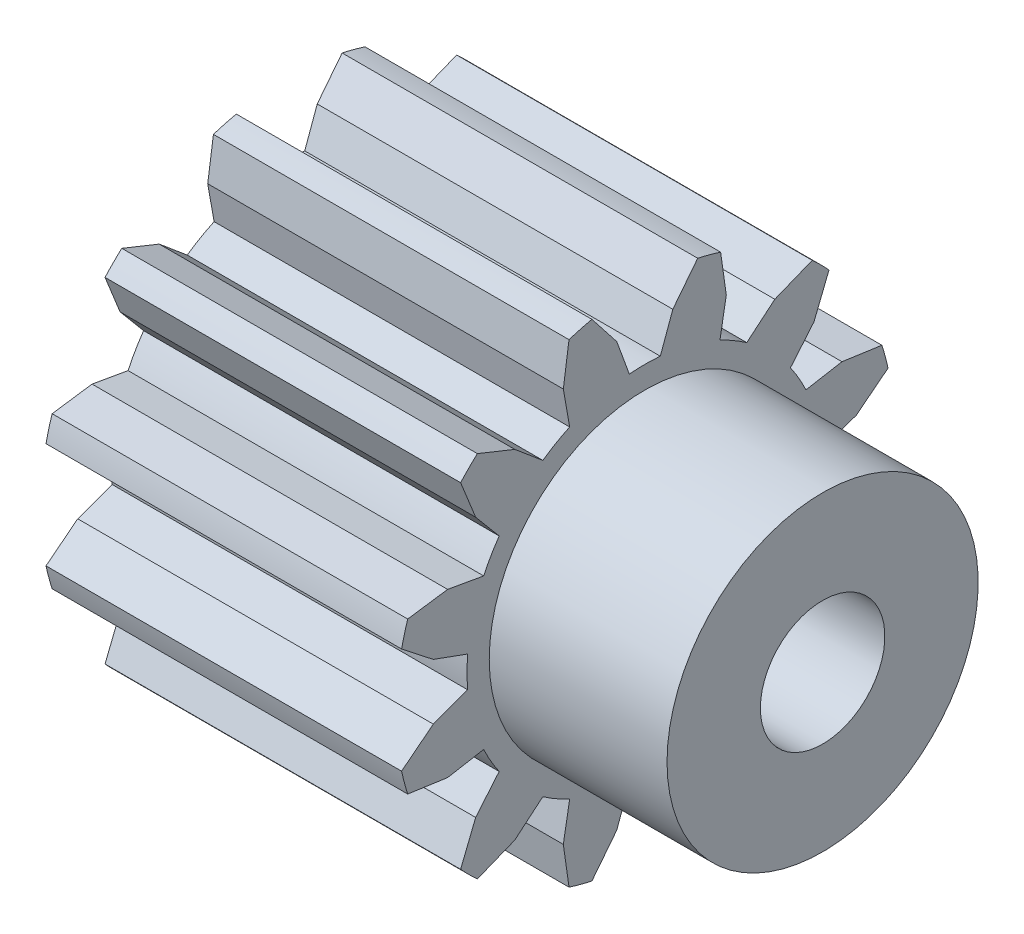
ISO-10303-21;
HEADER;
FILE_DESCRIPTION(('STEP AP214'),'2;1');
FILE_NAME('part.step','',(''),(''),'','','');
FILE_SCHEMA(('AUTOMOTIVE_DESIGN { 1 0 10303 214 1 1 1 1 }'));
ENDSEC;
DATA;
#1=APPLICATION_CONTEXT('core data for automotive mechanical design processes');
#2=APPLICATION_PROTOCOL_DEFINITION('international standard','automotive_design',2000,#1);
#3=PRODUCT_CONTEXT('',#1,'mechanical');
#4=PRODUCT('Part','Part','',(#3));
#5=PRODUCT_RELATED_PRODUCT_CATEGORY('part','',(#4));
#6=PRODUCT_DEFINITION_FORMATION('','',#4);
#7=PRODUCT_DEFINITION_CONTEXT('part definition',#1,'design');
#8=PRODUCT_DEFINITION('design','',#6,#7);
#9=PRODUCT_DEFINITION_SHAPE('','',#8);
#10=(LENGTH_UNIT() NAMED_UNIT(*) SI_UNIT(.MILLI.,.METRE.));
#11=(NAMED_UNIT(*) PLANE_ANGLE_UNIT() SI_UNIT($,.RADIAN.));
#12=(NAMED_UNIT(*) SI_UNIT($,.STERADIAN.) SOLID_ANGLE_UNIT());
#13=UNCERTAINTY_MEASURE_WITH_UNIT(LENGTH_MEASURE(1.E-05),#10,'distance_accuracy_value','');
#14=(GEOMETRIC_REPRESENTATION_CONTEXT(3) GLOBAL_UNCERTAINTY_ASSIGNED_CONTEXT((#13)) GLOBAL_UNIT_ASSIGNED_CONTEXT((#10,
#11,#12)) REPRESENTATION_CONTEXT('',''));
#15=CARTESIAN_POINT('',(0.,0.,0.));
#16=DIRECTION('',(0.,0.,1.));
#17=DIRECTION('',(1.,0.,0.));
#18=AXIS2_PLACEMENT_3D('',#15,#16,#17);
#19=CARTESIAN_POINT('',(-20.,-27.6886574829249,-27.3603334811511));
#20=DIRECTION('',(-1.,0.,0.));
#21=DIRECTION('',(0.,0.,1.));
#22=AXIS2_PLACEMENT_3D('',#19,#20,#21);
#23=PLANE('',#22);
#24=CARTESIAN_POINT('',(-20.,0.,0.));
#25=DIRECTION('',(-1.,0.,0.));
#26=DIRECTION('',(0.,0.,1.));
#27=AXIS2_PLACEMENT_3D('',#24,#25,#26);
#28=CIRCLE('',#27,7.);
#29=CARTESIAN_POINT('',(-20.,0.,7.00000000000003));
#30=VERTEX_POINT('',#29);
#31=EDGE_CURVE('E18',#30,#30,#28,.T.);
#32=ORIENTED_EDGE('',*,*,#31,.F.);
#33=EDGE_LOOP('',(#32));
#34=FACE_BOUND('',#33,.T.);
#35=DIRECTION('',(0.,-0.34202014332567,0.939692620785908));
#36=VECTOR('',#35,1.);
#37=CARTESIAN_POINT('',(-20.,-2.44709635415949,21.8580672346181));
#38=LINE('',#37,#36);
#39=CARTESIAN_POINT('',(-20.,-1.74311485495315,19.9238939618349));
#40=VERTEX_POINT('',#39);
#41=CARTESIAN_POINT('',(-20.,-3.15107785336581,23.7922405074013));
#42=VERTEX_POINT('',#41);
#43=EDGE_CURVE('E698',#40,#42,#38,.T.);
#44=ORIENTED_EDGE('',*,*,#43,.F.);
#45=CARTESIAN_POINT('',(-20.,0.,6.1929628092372E-13));
#46=DIRECTION('',(-1.,0.,0.));
#47=DIRECTION('',(0.,-1.,0.));
#48=AXIS2_PLACEMENT_3D('',#45,#46,#47);
#49=CIRCLE('',#48,19.9999999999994);
#50=CARTESIAN_POINT('',(-20.,1.74311485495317,19.9238939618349));
#51=VERTEX_POINT('',#50);
#52=EDGE_CURVE('E371',#51,#40,#49,.F.);
#53=ORIENTED_EDGE('',*,*,#52,.F.);
#54=DIRECTION('',(0.,-0.34202014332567,-0.939692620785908));
#55=VECTOR('',#54,1.);
#56=CARTESIAN_POINT('',(-20.,2.4470963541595,21.8580672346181));
#57=LINE('',#56,#55);
#58=CARTESIAN_POINT('',(-20.,3.15107785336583,23.7922405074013));
#59=VERTEX_POINT('',#58);
#60=EDGE_CURVE('E373',#59,#51,#57,.T.);
#61=ORIENTED_EDGE('',*,*,#60,.F.);
#62=DIRECTION('',(0.,-0.61730767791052,-0.786721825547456));
#63=VECTOR('',#62,1.);
#64=CARTESIAN_POINT('',(-20.,4.55094443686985,25.5762869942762));
#65=LINE('',#64,#63);
#66=CARTESIAN_POINT('',(-20.,5.95081102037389,27.3603334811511));
#67=VERTEX_POINT('',#66);
#68=EDGE_CURVE('E375',#67,#59,#65,.T.);
#69=ORIENTED_EDGE('',*,*,#68,.F.);
#70=CARTESIAN_POINT('',(-20.,1.8995222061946E-13,3.58914287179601E-12));
#71=DIRECTION('',(-1.,0.,0.));
#72=DIRECTION('',(0.,-1.,0.));
#73=AXIS2_PLACEMENT_3D('',#70,#71,#72);
#74=CIRCLE('',#73,27.9999999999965);
#75=CARTESIAN_POINT('',(-20.,8.52661322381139,26.6701493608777));
#76=VERTEX_POINT('',#75);
#77=EDGE_CURVE('E829',#76,#67,#74,.F.);
#78=ORIENTED_EDGE('',*,*,#77,.F.);
#79=DIRECTION('',(0.,-0.141243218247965,0.989974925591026));
#80=VECTOR('',#79,1.);
#81=CARTESIAN_POINT('',(-20.,8.84691000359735,24.4251864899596));
#82=LINE('',#81,#80);
#83=CARTESIAN_POINT('',(-20.,9.16720678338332,22.1802236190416));
#84=VERTEX_POINT('',#83);
#85=EDGE_CURVE('E404',#84,#76,#82,.T.);
#86=ORIENTED_EDGE('',*,*,#85,.F.);
#87=DIRECTION('',(0.,0.173648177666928,0.984807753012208));
#88=VECTOR('',#87,1.);
#89=CARTESIAN_POINT('',(-20.,8.80978600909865,20.1531896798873));
#90=LINE('',#89,#88);
#91=CARTESIAN_POINT('',(-20.,8.45236523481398,18.126155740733));
#92=VERTEX_POINT('',#91);
#93=EDGE_CURVE('E412',#92,#84,#90,.T.);
#94=ORIENTED_EDGE('',*,*,#93,.F.);
#95=CARTESIAN_POINT('',(-20.,1.50053580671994E-13,-1.90819582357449E-13));
#96=DIRECTION('',(-1.,0.,0.));
#97=DIRECTION('',(0.,-1.,0.));
#98=AXIS2_PLACEMENT_3D('',#95,#96,#97);
#99=CIRCLE('',#98,20.0000000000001);
#100=CARTESIAN_POINT('',(-20.,11.4715287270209,16.3830408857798));
#101=VERTEX_POINT('',#100);
#102=EDGE_CURVE('E831',#101,#92,#99,.F.);
#103=ORIENTED_EDGE('',*,*,#102,.F.);
#104=DIRECTION('',(0.,-0.766044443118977,-0.64278760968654));
#105=VECTOR('',#104,1.);
#106=CARTESIAN_POINT('',(-20.,13.0482812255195,17.7060933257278));
#107=LINE('',#106,#105);
#108=CARTESIAN_POINT('',(-20.,14.625033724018,19.0291457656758));
#109=VERTEX_POINT('',#108);
#110=EDGE_CURVE('E418',#109,#101,#107,.T.);
#111=ORIENTED_EDGE('',*,*,#110,.F.);
#112=DIRECTION('',(0.,-0.927965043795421,-0.372667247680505));
#113=VECTOR('',#112,1.);
#114=CARTESIAN_POINT('',(-20.,16.7293769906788,19.8742420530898));
#115=LINE('',#114,#113);
#116=CARTESIAN_POINT('',(-20.,18.8337202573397,20.7193383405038));
#117=VERTEX_POINT('',#116);
#118=EDGE_CURVE('E425',#117,#109,#115,.T.);
#119=ORIENTED_EDGE('',*,*,#118,.F.);
#120=CARTESIAN_POINT('',(-20.,1.43982048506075E-12,7.59808882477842E-13));
#121=DIRECTION('',(-1.,0.,0.));
#122=DIRECTION('',(0.,0.,1.));
#123=AXIS2_PLACEMENT_3D('',#120,#121,#122);
#124=CIRCLE('',#123,27.9999999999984);
#125=CARTESIAN_POINT('',(-20.,20.7193383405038,18.8337202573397));
#126=VERTEX_POINT('',#125);
#127=EDGE_CURVE('E834',#126,#117,#124,.F.);
#128=ORIENTED_EDGE('',*,*,#127,.F.);
#129=DIRECTION('',(0.,0.372667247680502,0.927965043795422));
#130=VECTOR('',#129,1.);
#131=CARTESIAN_POINT('',(-20.,19.8742420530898,16.7293769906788));
#132=LINE('',#131,#130);
#133=CARTESIAN_POINT('',(-20.,19.0291457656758,14.625033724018));
#134=VERTEX_POINT('',#133);
#135=EDGE_CURVE('E431',#134,#126,#132,.T.);
#136=ORIENTED_EDGE('',*,*,#135,.F.);
#137=DIRECTION('',(0.,0.642787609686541,0.766044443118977));
#138=VECTOR('',#137,1.);
#139=CARTESIAN_POINT('',(-20.,17.7060933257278,13.0482812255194));
#140=LINE('',#139,#138);
#141=CARTESIAN_POINT('',(-20.,16.3830408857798,11.4715287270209));
#142=VERTEX_POINT('',#141);
#143=EDGE_CURVE('E438',#142,#134,#140,.T.);
#144=ORIENTED_EDGE('',*,*,#143,.F.);
#145=CARTESIAN_POINT('',(-20.,-5.30825383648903E-13,-3.79904441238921E-13));
#146=DIRECTION('',(-1.,0.,0.));
#147=DIRECTION('',(0.,0.,1.));
#148=AXIS2_PLACEMENT_3D('',#145,#146,#147);
#149=CIRCLE('',#148,20.0000000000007);
#150=CARTESIAN_POINT('',(-20.,18.126155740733,8.45236523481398));
#151=VERTEX_POINT('',#150);
#152=EDGE_CURVE('E837',#151,#142,#149,.F.);
#153=ORIENTED_EDGE('',*,*,#152,.F.);
#154=DIRECTION('',(0.,-0.984807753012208,-0.173648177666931));
#155=VECTOR('',#154,1.);
#156=CARTESIAN_POINT('',(-20.,20.1531896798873,8.80978600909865));
#157=LINE('',#156,#155);
#158=CARTESIAN_POINT('',(-20.,22.1802236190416,9.16720678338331));
#159=VERTEX_POINT('',#158);
#160=EDGE_CURVE('E444',#159,#151,#157,.T.);
#161=ORIENTED_EDGE('',*,*,#160,.F.);
#162=DIRECTION('',(0.,-0.989974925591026,0.141243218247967));
#163=VECTOR('',#162,1.);
#164=CARTESIAN_POINT('',(-20.,24.4251864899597,8.84691000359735));
#165=LINE('',#164,#163);
#166=CARTESIAN_POINT('',(-20.,26.6701493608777,8.52661322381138));
#167=VERTEX_POINT('',#166);
#168=EDGE_CURVE('E451',#167,#159,#165,.T.);
#169=ORIENTED_EDGE('',*,*,#168,.F.);
#170=CARTESIAN_POINT('',(-20.,-2.70616862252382E-13,1.79977560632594E-13));
#171=DIRECTION('',(-1.,0.,0.));
#172=DIRECTION('',(0.,0.,1.));
#173=AXIS2_PLACEMENT_3D('',#170,#171,#172);
#174=CIRCLE('',#173,28.0000000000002);
#175=CARTESIAN_POINT('',(-20.,27.3603334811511,5.95081102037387));
#176=VERTEX_POINT('',#175);
#177=EDGE_CURVE('E840',#176,#167,#174,.F.);
#178=ORIENTED_EDGE('',*,*,#177,.F.);
#179=DIRECTION('',(0.,0.786721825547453,0.617307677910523));
#180=VECTOR('',#179,1.);
#181=CARTESIAN_POINT('',(-20.,25.5762869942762,4.55094443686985));
#182=LINE('',#181,#180);
#183=CARTESIAN_POINT('',(-20.,23.7922405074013,3.15107785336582));
#184=VERTEX_POINT('',#183);
#185=EDGE_CURVE('E457',#184,#176,#182,.T.);
#186=ORIENTED_EDGE('',*,*,#185,.F.);
#187=DIRECTION('',(0.,0.939692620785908,0.342020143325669));
#188=VECTOR('',#187,1.);
#189=CARTESIAN_POINT('',(-20.,21.8580672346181,2.44709635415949));
#190=LINE('',#189,#188);
#191=CARTESIAN_POINT('',(-20.,19.9238939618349,1.74311485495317));
#192=VERTEX_POINT('',#191);
#193=EDGE_CURVE('E464',#192,#184,#190,.T.);
#194=ORIENTED_EDGE('',*,*,#193,.F.);
#195=CARTESIAN_POINT('',(-20.,5.39499001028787E-13,1.50053580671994E-13));
#196=DIRECTION('',(-1.,0.,0.));
#197=DIRECTION('',(0.,0.,1.));
#198=AXIS2_PLACEMENT_3D('',#195,#196,#197);
#199=CIRCLE('',#198,19.9999999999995);
#200=CARTESIAN_POINT('',(-20.,19.9238939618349,-1.74311485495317));
#201=VERTEX_POINT('',#200);
#202=EDGE_CURVE('E843',#201,#192,#199,.F.);
#203=ORIENTED_EDGE('',*,*,#202,.F.);
#204=DIRECTION('',(0.,-0.939692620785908,0.342020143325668));
#205=VECTOR('',#204,1.);
#206=CARTESIAN_POINT('',(-20.,21.8580672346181,-2.44709635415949));
#207=LINE('',#206,#205);
#208=CARTESIAN_POINT('',(-20.,23.7922405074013,-3.15107785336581));
#209=VERTEX_POINT('',#208);
#210=EDGE_CURVE('E470',#209,#201,#207,.T.);
#211=ORIENTED_EDGE('',*,*,#210,.F.);
#212=DIRECTION('',(0.,-0.786721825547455,0.617307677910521));
#213=VECTOR('',#212,1.);
#214=CARTESIAN_POINT('',(-20.,25.5762869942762,-4.55094443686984));
#215=LINE('',#214,#213);
#216=CARTESIAN_POINT('',(-20.,27.3603334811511,-5.95081102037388));
#217=VERTEX_POINT('',#216);
#218=EDGE_CURVE('E477',#217,#209,#215,.T.);
#219=ORIENTED_EDGE('',*,*,#218,.F.);
#220=CARTESIAN_POINT('',(-20.,-1.25940924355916E-12,9.49761103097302E-13));
#221=DIRECTION('',(-1.,0.,0.));
#222=DIRECTION('',(0.,0.,1.));
#223=AXIS2_PLACEMENT_3D('',#220,#221,#222);
#224=CIRCLE('',#223,28.0000000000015);
#225=CARTESIAN_POINT('',(-20.,26.6701493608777,-8.5266132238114));
#226=VERTEX_POINT('',#225);
#227=EDGE_CURVE('E846',#226,#217,#224,.F.);
#228=ORIENTED_EDGE('',*,*,#227,.F.);
#229=DIRECTION('',(0.,0.989974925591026,0.141243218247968));
#230=VECTOR('',#229,1.);
#231=CARTESIAN_POINT('',(-20.,24.4251864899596,-8.84691000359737));
#232=LINE('',#231,#230);
#233=CARTESIAN_POINT('',(-20.,22.1802236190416,-9.16720678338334));
#234=VERTEX_POINT('',#233);
#235=EDGE_CURVE('E483',#234,#226,#232,.T.);
#236=ORIENTED_EDGE('',*,*,#235,.F.);
#237=DIRECTION('',(0.,0.984807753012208,-0.17364817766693));
#238=VECTOR('',#237,1.);
#239=CARTESIAN_POINT('',(-20.,20.1531896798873,-8.80978600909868));
#240=LINE('',#239,#238);
#241=CARTESIAN_POINT('',(-20.,18.126155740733,-8.45236523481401));
#242=VERTEX_POINT('',#241);
#243=EDGE_CURVE('E490',#242,#234,#240,.T.);
#244=ORIENTED_EDGE('',*,*,#243,.F.);
#245=CARTESIAN_POINT('',(-20.,-6.59194920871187E-13,3.70363462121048E-13));
#246=DIRECTION('',(-1.,0.,0.));
#247=DIRECTION('',(0.,0.,1.));
#248=AXIS2_PLACEMENT_3D('',#245,#246,#247);
#249=CIRCLE('',#248,20.0000000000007);
#250=CARTESIAN_POINT('',(-20.,16.3830408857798,-11.471528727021));
#251=VERTEX_POINT('',#250);
#252=EDGE_CURVE('E849',#251,#242,#249,.F.);
#253=ORIENTED_EDGE('',*,*,#252,.F.);
#254=DIRECTION('',(0.,-0.64278760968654,0.766044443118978));
#255=VECTOR('',#254,1.);
#256=CARTESIAN_POINT('',(-20.,17.7060933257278,-13.0482812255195));
#257=LINE('',#256,#255);
#258=CARTESIAN_POINT('',(-20.,19.0291457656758,-14.625033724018));
#259=VERTEX_POINT('',#258);
#260=EDGE_CURVE('E496',#259,#251,#257,.T.);
#261=ORIENTED_EDGE('',*,*,#260,.F.);
#262=DIRECTION('',(0.,-0.372667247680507,0.92796504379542));
#263=VECTOR('',#262,1.);
#264=CARTESIAN_POINT('',(-20.,19.8742420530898,-16.7293769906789));
#265=LINE('',#264,#263);
#266=CARTESIAN_POINT('',(-20.,20.7193383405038,-18.8337202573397));
#267=VERTEX_POINT('',#266);
#268=EDGE_CURVE('E503',#267,#259,#265,.T.);
#269=ORIENTED_EDGE('',*,*,#268,.F.);
#270=CARTESIAN_POINT('',(-20.,-4.80518402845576E-13,3.29597460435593E-13));
#271=DIRECTION('',(-1.,0.,0.));
#272=DIRECTION('',(0.,-1.,0.));
#273=AXIS2_PLACEMENT_3D('',#270,#271,#272);
#274=CIRCLE('',#273,28.0000000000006);
#275=CARTESIAN_POINT('',(-20.,18.8337202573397,-20.7193383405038));
#276=VERTEX_POINT('',#275);
#277=EDGE_CURVE('E852',#276,#267,#274,.F.);
#278=ORIENTED_EDGE('',*,*,#277,.F.);
#279=DIRECTION('',(0.,0.927965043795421,-0.372667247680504));
#280=VECTOR('',#279,1.);
#281=CARTESIAN_POINT('',(-20.,16.7293769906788,-19.8742420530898));
#282=LINE('',#281,#280);
#283=CARTESIAN_POINT('',(-20.,14.625033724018,-19.0291457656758));
#284=VERTEX_POINT('',#283);
#285=EDGE_CURVE('E509',#284,#276,#282,.T.);
#286=ORIENTED_EDGE('',*,*,#285,.F.);
#287=DIRECTION('',(0.,0.766044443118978,-0.642787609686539));
#288=VECTOR('',#287,1.);
#289=CARTESIAN_POINT('',(-20.,13.0482812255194,-17.7060933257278));
#290=LINE('',#289,#288);
#291=CARTESIAN_POINT('',(-20.,11.4715287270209,-16.3830408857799));
#292=VERTEX_POINT('',#291);
#293=EDGE_CURVE('E516',#292,#284,#290,.T.);
#294=ORIENTED_EDGE('',*,*,#293,.F.);
#295=CARTESIAN_POINT('',(-20.,3.59955121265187E-13,-4.80518402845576E-13));
#296=DIRECTION('',(-1.,0.,0.));
#297=DIRECTION('',(0.,-1.,0.));
#298=AXIS2_PLACEMENT_3D('',#295,#296,#297);
#299=CIRCLE('',#298,19.9999999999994);
#300=CARTESIAN_POINT('',(-20.,8.45236523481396,-18.126155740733));
#301=VERTEX_POINT('',#300);
#302=EDGE_CURVE('E855',#301,#292,#299,.F.);
#303=ORIENTED_EDGE('',*,*,#302,.F.);
#304=DIRECTION('',(0.,-0.17364817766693,0.984807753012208));
#305=VECTOR('',#304,1.);
#306=CARTESIAN_POINT('',(-20.,8.80978600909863,-20.1531896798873));
#307=LINE('',#306,#305);
#308=CARTESIAN_POINT('',(-20.,9.16720678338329,-22.1802236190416));
#309=VERTEX_POINT('',#308);
#310=EDGE_CURVE('E522',#309,#301,#307,.T.);
#311=ORIENTED_EDGE('',*,*,#310,.F.);
#312=DIRECTION('',(0.,0.141243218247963,0.989974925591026));
#313=VECTOR('',#312,1.);
#314=CARTESIAN_POINT('',(-20.,8.84691000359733,-24.4251864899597));
#315=LINE('',#314,#313);
#316=CARTESIAN_POINT('',(-20.,8.52661322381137,-26.6701493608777));
#317=VERTEX_POINT('',#316);
#318=EDGE_CURVE('E529',#317,#309,#315,.T.);
#319=ORIENTED_EDGE('',*,*,#318,.F.);
#320=CARTESIAN_POINT('',(-20.,-6.10188982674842E-13,2.31932528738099E-12));
#321=DIRECTION('',(-1.,0.,0.));
#322=DIRECTION('',(0.,-1.,0.));
#323=AXIS2_PLACEMENT_3D('',#320,#321,#322);
#324=CIRCLE('',#323,28.0000000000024);
#325=CARTESIAN_POINT('',(-20.,5.95081102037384,-27.3603334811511));
#326=VERTEX_POINT('',#325);
#327=EDGE_CURVE('E858',#326,#317,#324,.F.);
#328=ORIENTED_EDGE('',*,*,#327,.F.);
#329=DIRECTION('',(0.,0.617307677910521,-0.786721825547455));
#330=VECTOR('',#329,1.);
#331=CARTESIAN_POINT('',(-20.,4.55094443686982,-25.5762869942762));
#332=LINE('',#331,#330);
#333=CARTESIAN_POINT('',(-20.,3.1510778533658,-23.7922405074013));
#334=VERTEX_POINT('',#333);
#335=EDGE_CURVE('E535',#334,#326,#332,.T.);
#336=ORIENTED_EDGE('',*,*,#335,.F.);
#337=DIRECTION('',(0.,0.34202014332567,-0.939692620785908));
#338=VECTOR('',#337,1.);
#339=CARTESIAN_POINT('',(-20.,2.44709635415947,-21.8580672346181));
#340=LINE('',#339,#338);
#341=CARTESIAN_POINT('',(-20.,1.74311485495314,-19.9238939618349));
#342=VERTEX_POINT('',#341);
#343=EDGE_CURVE('E542',#342,#334,#340,.T.);
#344=ORIENTED_EDGE('',*,*,#343,.F.);
#345=CARTESIAN_POINT('',(-20.,-1.8995222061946E-13,-1.59594559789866E-13));
#346=DIRECTION('',(-1.,0.,0.));
#347=DIRECTION('',(0.,-1.,0.));
#348=AXIS2_PLACEMENT_3D('',#345,#346,#347);
#349=CIRCLE('',#348,19.9999999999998);
#350=CARTESIAN_POINT('',(-20.,-1.74311485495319,-19.9238939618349));
#351=VERTEX_POINT('',#350);
#352=EDGE_CURVE('E861',#351,#342,#349,.F.);
#353=ORIENTED_EDGE('',*,*,#352,.F.);
#354=DIRECTION('',(0.,0.342020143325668,0.939692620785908));
#355=VECTOR('',#354,1.);
#356=CARTESIAN_POINT('',(-20.,-2.44709635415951,-21.8580672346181));
#357=LINE('',#356,#355);
#358=CARTESIAN_POINT('',(-20.,-3.15107785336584,-23.7922405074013));
#359=VERTEX_POINT('',#358);
#360=EDGE_CURVE('E548',#359,#351,#357,.T.);
#361=ORIENTED_EDGE('',*,*,#360,.F.);
#362=DIRECTION('',(0.,0.61730767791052,0.786721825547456));
#363=VECTOR('',#362,1.);
#364=CARTESIAN_POINT('',(-20.,-4.55094443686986,-25.5762869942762));
#365=LINE('',#364,#363);
#366=CARTESIAN_POINT('',(-20.,-5.95081102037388,-27.3603334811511));
#367=VERTEX_POINT('',#366);
#368=EDGE_CURVE('E555',#367,#359,#365,.T.);
#369=ORIENTED_EDGE('',*,*,#368,.F.);
#370=CARTESIAN_POINT('',(-20.,1.196959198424E-13,1.49186218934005E-13));
#371=DIRECTION('',(-1.,0.,0.));
#372=DIRECTION('',(0.,-1.,0.));
#373=AXIS2_PLACEMENT_3D('',#370,#371,#372);
#374=CIRCLE('',#373,28.0000000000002);
#375=CARTESIAN_POINT('',(-20.,-8.5266132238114,-26.6701493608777));
#376=VERTEX_POINT('',#375);
#377=EDGE_CURVE('E864',#376,#367,#374,.F.);
#378=ORIENTED_EDGE('',*,*,#377,.F.);
#379=DIRECTION('',(0.,0.141243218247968,-0.989974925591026));
#380=VECTOR('',#379,1.);
#381=CARTESIAN_POINT('',(-20.,-8.84691000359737,-24.4251864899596));
#382=LINE('',#381,#380);
#383=CARTESIAN_POINT('',(-20.,-9.16720678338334,-22.1802236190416));
#384=VERTEX_POINT('',#383);
#385=EDGE_CURVE('E561',#384,#376,#382,.T.);
#386=ORIENTED_EDGE('',*,*,#385,.F.);
#387=DIRECTION('',(0.,-0.17364817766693,-0.984807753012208));
#388=VECTOR('',#387,1.);
#389=CARTESIAN_POINT('',(-20.,-8.80978600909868,-20.1531896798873));
#390=LINE('',#389,#388);
#391=CARTESIAN_POINT('',(-20.,-8.45236523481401,-18.126155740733));
#392=VERTEX_POINT('',#391);
#393=EDGE_CURVE('E568',#392,#384,#390,.T.);
#394=ORIENTED_EDGE('',*,*,#393,.F.);
#395=CARTESIAN_POINT('',(-20.,5.29958021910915E-13,7.49400541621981E-13));
#396=DIRECTION('',(-1.,0.,0.));
#397=DIRECTION('',(0.,-1.,0.));
#398=AXIS2_PLACEMENT_3D('',#395,#396,#397);
#399=CIRCLE('',#398,20.0000000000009);
#400=CARTESIAN_POINT('',(-20.,-11.4715287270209,-16.3830408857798));
#401=VERTEX_POINT('',#400);
#402=EDGE_CURVE('E867',#401,#392,#399,.F.);
#403=ORIENTED_EDGE('',*,*,#402,.F.);
#404=DIRECTION('',(0.,0.766044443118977,0.64278760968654));
#405=VECTOR('',#404,1.);
#406=CARTESIAN_POINT('',(-20.,-13.0482812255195,-17.7060933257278));
#407=LINE('',#406,#405);
#408=CARTESIAN_POINT('',(-20.,-14.625033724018,-19.0291457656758));
#409=VERTEX_POINT('',#408);
#410=EDGE_CURVE('E574',#409,#401,#407,.T.);
#411=ORIENTED_EDGE('',*,*,#410,.F.);
#412=DIRECTION('',(0.,0.927965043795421,0.372667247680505));
#413=VECTOR('',#412,1.);
#414=CARTESIAN_POINT('',(-20.,-16.7293769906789,-19.8742420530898));
#415=LINE('',#414,#413);
#416=CARTESIAN_POINT('',(-20.,-18.8337202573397,-20.7193383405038));
#417=VERTEX_POINT('',#416);
#418=EDGE_CURVE('E581',#417,#409,#415,.T.);
#419=ORIENTED_EDGE('',*,*,#418,.F.);
#420=CARTESIAN_POINT('',(-20.,-1.90819582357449E-13,-7.59808882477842E-13));
#421=DIRECTION('',(-1.,0.,0.));
#422=DIRECTION('',(0.,0.,1.));
#423=AXIS2_PLACEMENT_3D('',#420,#421,#422);
#424=CIRCLE('',#423,27.9999999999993);
#425=CARTESIAN_POINT('',(-20.,-20.7193383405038,-18.8337202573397));
#426=VERTEX_POINT('',#425);
#427=EDGE_CURVE('E870',#426,#417,#424,.F.);
#428=ORIENTED_EDGE('',*,*,#427,.F.);
#429=DIRECTION('',(0.,-0.372667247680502,-0.927965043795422));
#430=VECTOR('',#429,1.);
#431=CARTESIAN_POINT('',(-20.,-19.8742420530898,-16.7293769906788));
#432=LINE('',#431,#430);
#433=CARTESIAN_POINT('',(-20.,-19.0291457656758,-14.625033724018));
#434=VERTEX_POINT('',#433);
#435=EDGE_CURVE('E587',#434,#426,#432,.T.);
#436=ORIENTED_EDGE('',*,*,#435,.F.);
#437=DIRECTION('',(0.,-0.64278760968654,-0.766044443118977));
#438=VECTOR('',#437,1.);
#439=CARTESIAN_POINT('',(-20.,-17.7060933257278,-13.0482812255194));
#440=LINE('',#439,#438);
#441=CARTESIAN_POINT('',(-20.,-16.3830408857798,-11.4715287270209));
#442=VERTEX_POINT('',#441);
#443=EDGE_CURVE('E594',#442,#434,#440,.T.);
#444=ORIENTED_EDGE('',*,*,#443,.F.);
#445=CARTESIAN_POINT('',(-20.,-1.40512601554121E-13,-1.50053580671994E-13));
#446=DIRECTION('',(-1.,0.,0.));
#447=DIRECTION('',(0.,0.,1.));
#448=AXIS2_PLACEMENT_3D('',#445,#446,#447);
#449=CIRCLE('',#448,19.9999999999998);
#450=CARTESIAN_POINT('',(-20.,-18.126155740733,-8.45236523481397));
#451=VERTEX_POINT('',#450);
#452=EDGE_CURVE('E873',#451,#442,#449,.F.);
#453=ORIENTED_EDGE('',*,*,#452,.F.);
#454=DIRECTION('',(0.,0.984807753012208,0.17364817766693));
#455=VECTOR('',#454,1.);
#456=CARTESIAN_POINT('',(-20.,-20.1531896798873,-8.80978600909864));
#457=LINE('',#456,#455);
#458=CARTESIAN_POINT('',(-20.,-22.1802236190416,-9.16720678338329));
#459=VERTEX_POINT('',#458);
#460=EDGE_CURVE('E600',#459,#451,#457,.T.);
#461=ORIENTED_EDGE('',*,*,#460,.F.);
#462=DIRECTION('',(0.,0.989974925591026,-0.141243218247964));
#463=VECTOR('',#462,1.);
#464=CARTESIAN_POINT('',(-20.,-24.4251864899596,-8.84691000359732));
#465=LINE('',#464,#463);
#466=CARTESIAN_POINT('',(-20.,-26.6701493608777,-8.52661322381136));
#467=VERTEX_POINT('',#466);
#468=EDGE_CURVE('E607',#467,#459,#465,.T.);
#469=ORIENTED_EDGE('',*,*,#468,.F.);
#470=CARTESIAN_POINT('',(-20.,-6.59194920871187E-13,1.79977560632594E-13));
#471=DIRECTION('',(-1.,0.,0.));
#472=DIRECTION('',(0.,0.,1.));
#473=AXIS2_PLACEMENT_3D('',#470,#471,#472);
#474=CIRCLE('',#473,27.9999999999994);
#475=CARTESIAN_POINT('',(-20.,-27.3603334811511,-5.95081102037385));
#476=VERTEX_POINT('',#475);
#477=EDGE_CURVE('E876',#476,#467,#474,.F.);
#478=ORIENTED_EDGE('',*,*,#477,.F.);
#479=DIRECTION('',(0.,-0.786721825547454,-0.617307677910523));
#480=VECTOR('',#479,1.);
#481=CARTESIAN_POINT('',(-20.,-25.5762869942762,-4.55094443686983));
#482=LINE('',#481,#480);
#483=CARTESIAN_POINT('',(-20.,-23.7922405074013,-3.15107785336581));
#484=VERTEX_POINT('',#483);
#485=EDGE_CURVE('E613',#484,#476,#482,.T.);
#486=ORIENTED_EDGE('',*,*,#485,.F.);
#487=DIRECTION('',(0.,-0.939692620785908,-0.342020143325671));
#488=VECTOR('',#487,1.);
#489=CARTESIAN_POINT('',(-20.,-21.8580672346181,-2.44709635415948));
#490=LINE('',#489,#488);
#491=CARTESIAN_POINT('',(-20.,-19.9238939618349,-1.74311485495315));
#492=VERTEX_POINT('',#491);
#493=EDGE_CURVE('E620',#492,#484,#490,.T.);
#494=ORIENTED_EDGE('',*,*,#493,.F.);
#495=CARTESIAN_POINT('',(-20.,-6.1929628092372E-13,0.));
#496=DIRECTION('',(-1.,0.,0.));
#497=DIRECTION('',(0.,0.,1.));
#498=AXIS2_PLACEMENT_3D('',#495,#496,#497);
#499=CIRCLE('',#498,19.9999999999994);
#500=CARTESIAN_POINT('',(-20.,-19.9238939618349,1.74311485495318));
#501=VERTEX_POINT('',#500);
#502=EDGE_CURVE('E879',#501,#492,#499,.F.);
#503=ORIENTED_EDGE('',*,*,#502,.F.);
#504=DIRECTION('',(0.,0.939692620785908,-0.34202014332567));
#505=VECTOR('',#504,1.);
#506=CARTESIAN_POINT('',(-20.,-21.8580672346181,2.44709635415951));
#507=LINE('',#506,#505);
#508=CARTESIAN_POINT('',(-20.,-23.7922405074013,3.15107785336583));
#509=VERTEX_POINT('',#508);
#510=EDGE_CURVE('E626',#509,#501,#507,.T.);
#511=ORIENTED_EDGE('',*,*,#510,.F.);
#512=DIRECTION('',(0.,0.786721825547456,-0.61730767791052));
#513=VECTOR('',#512,1.);
#514=CARTESIAN_POINT('',(-20.,-25.5762869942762,4.55094443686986));
#515=LINE('',#514,#513);
#516=CARTESIAN_POINT('',(-20.,-27.3603334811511,5.95081102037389));
#517=VERTEX_POINT('',#516);
#518=EDGE_CURVE('E633',#517,#509,#515,.T.);
#519=ORIENTED_EDGE('',*,*,#518,.F.);
#520=CARTESIAN_POINT('',(-20.,-2.60208521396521E-13,-5.29958021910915E-13));
#521=DIRECTION('',(-1.,0.,0.));
#522=DIRECTION('',(0.,0.,1.));
#523=AXIS2_PLACEMENT_3D('',#520,#521,#522);
#524=CIRCLE('',#523,27.9999999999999);
#525=CARTESIAN_POINT('',(-20.,-26.6701493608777,8.52661322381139));
#526=VERTEX_POINT('',#525);
#527=EDGE_CURVE('E882',#526,#517,#524,.F.);
#528=ORIENTED_EDGE('',*,*,#527,.F.);
#529=DIRECTION('',(0.,-0.989974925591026,-0.141243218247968));
#530=VECTOR('',#529,1.);
#531=CARTESIAN_POINT('',(-20.,-24.4251864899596,8.84691000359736));
#532=LINE('',#531,#530);
#533=CARTESIAN_POINT('',(-20.,-22.1802236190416,9.16720678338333));
#534=VERTEX_POINT('',#533);
#535=EDGE_CURVE('E639',#534,#526,#532,.T.);
#536=ORIENTED_EDGE('',*,*,#535,.F.);
#537=DIRECTION('',(0.,-0.984807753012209,0.173648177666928));
#538=VECTOR('',#537,1.);
#539=CARTESIAN_POINT('',(-20.,-20.1531896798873,8.80978600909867));
#540=LINE('',#539,#538);
#541=CARTESIAN_POINT('',(-20.,-18.126155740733,8.45236523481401));
#542=VERTEX_POINT('',#541);
#543=EDGE_CURVE('E646',#542,#534,#540,.T.);
#544=ORIENTED_EDGE('',*,*,#543,.F.);
#545=CARTESIAN_POINT('',(-20.,-2.4980018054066E-13,0.));
#546=DIRECTION('',(-1.,0.,0.));
#547=DIRECTION('',(0.,0.,1.));
#548=AXIS2_PLACEMENT_3D('',#545,#546,#547);
#549=CIRCLE('',#548,19.9999999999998);
#550=CARTESIAN_POINT('',(-20.,-16.3830408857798,11.4715287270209));
#551=VERTEX_POINT('',#550);
#552=EDGE_CURVE('E885',#551,#542,#549,.F.);
#553=ORIENTED_EDGE('',*,*,#552,.F.);
#554=DIRECTION('',(0.,0.642787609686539,-0.766044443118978));
#555=VECTOR('',#554,1.);
#556=CARTESIAN_POINT('',(-20.,-17.7060933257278,13.0482812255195));
#557=LINE('',#556,#555);
#558=CARTESIAN_POINT('',(-20.,-19.0291457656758,14.625033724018));
#559=VERTEX_POINT('',#558);
#560=EDGE_CURVE('E652',#559,#551,#557,.T.);
#561=ORIENTED_EDGE('',*,*,#560,.F.);
#562=DIRECTION('',(0.,0.372667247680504,-0.927965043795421));
#563=VECTOR('',#562,1.);
#564=CARTESIAN_POINT('',(-20.,-19.8742420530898,16.7293769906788));
#565=LINE('',#564,#563);
#566=CARTESIAN_POINT('',(-20.,-20.7193383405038,18.8337202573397));
#567=VERTEX_POINT('',#566);
#568=EDGE_CURVE('E659',#567,#559,#565,.T.);
#569=ORIENTED_EDGE('',*,*,#568,.F.);
#570=CARTESIAN_POINT('',(-20.,6.90419943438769E-13,0.));
#571=DIRECTION('',(-1.,0.,0.));
#572=DIRECTION('',(0.,-1.,0.));
#573=AXIS2_PLACEMENT_3D('',#570,#571,#572);
#574=CIRCLE('',#573,28.0000000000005);
#575=CARTESIAN_POINT('',(-20.,-18.8337202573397,20.7193383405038));
#576=VERTEX_POINT('',#575);
#577=EDGE_CURVE('E888',#576,#567,#574,.F.);
#578=ORIENTED_EDGE('',*,*,#577,.F.);
#579=DIRECTION('',(0.,-0.927965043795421,0.372667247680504));
#580=VECTOR('',#579,1.);
#581=CARTESIAN_POINT('',(-20.,-16.7293769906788,19.8742420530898));
#582=LINE('',#581,#580);
#583=CARTESIAN_POINT('',(-20.,-14.625033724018,19.0291457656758));
#584=VERTEX_POINT('',#583);
#585=EDGE_CURVE('E665',#584,#576,#582,.T.);
#586=ORIENTED_EDGE('',*,*,#585,.F.);
#587=DIRECTION('',(0.,-0.766044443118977,0.642787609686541));
#588=VECTOR('',#587,1.);
#589=CARTESIAN_POINT('',(-20.,-13.0482812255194,17.7060933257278));
#590=LINE('',#589,#588);
#591=CARTESIAN_POINT('',(-20.,-11.4715287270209,16.3830408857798));
#592=VERTEX_POINT('',#591);
#593=EDGE_CURVE('E672',#592,#584,#590,.T.);
#594=ORIENTED_EDGE('',*,*,#593,.F.);
#595=CARTESIAN_POINT('',(-20.,-4.50160742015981E-13,1.04950770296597E-12));
#596=DIRECTION('',(-1.,0.,0.));
#597=DIRECTION('',(0.,0.,1.));
#598=AXIS2_PLACEMENT_3D('',#595,#596,#597);
#599=CIRCLE('',#598,19.9999999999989);
#600=CARTESIAN_POINT('',(-20.,-8.45236523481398,18.126155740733));
#601=VERTEX_POINT('',#600);
#602=EDGE_CURVE('E891',#601,#592,#599,.F.);
#603=ORIENTED_EDGE('',*,*,#602,.F.);
#604=DIRECTION('',(0.,0.173648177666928,-0.984807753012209));
#605=VECTOR('',#604,1.);
#606=CARTESIAN_POINT('',(-20.,-8.80978600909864,20.1531896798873));
#607=LINE('',#606,#605);
#608=CARTESIAN_POINT('',(-20.,-9.1672067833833,22.1802236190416));
#609=VERTEX_POINT('',#608);
#610=EDGE_CURVE('E678',#609,#601,#607,.T.);
#611=ORIENTED_EDGE('',*,*,#610,.F.);
#612=DIRECTION('',(0.,-0.141243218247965,-0.989974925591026));
#613=VECTOR('',#612,1.);
#614=CARTESIAN_POINT('',(-20.,-8.84691000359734,24.4251864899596));
#615=LINE('',#614,#613);
#616=CARTESIAN_POINT('',(-20.,-8.52661322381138,26.6701493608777));
#617=VERTEX_POINT('',#616);
#618=EDGE_CURVE('E685',#617,#609,#615,.T.);
#619=ORIENTED_EDGE('',*,*,#618,.F.);
#620=CARTESIAN_POINT('',(-20.,6.80011602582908E-13,-2.82066037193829E-12));
#621=DIRECTION('',(-1.,0.,0.));
#622=DIRECTION('',(0.,-1.,0.));
#623=AXIS2_PLACEMENT_3D('',#620,#621,#622);
#624=CIRCLE('',#623,28.0000000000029);
#625=CARTESIAN_POINT('',(-20.,-5.95081102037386,27.3603334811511));
#626=VERTEX_POINT('',#625);
#627=EDGE_CURVE('E894',#626,#617,#624,.F.);
#628=ORIENTED_EDGE('',*,*,#627,.F.);
#629=DIRECTION('',(0.,-0.617307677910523,0.786721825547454));
#630=VECTOR('',#629,1.);
#631=CARTESIAN_POINT('',(-20.,-4.55094443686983,25.5762869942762));
#632=LINE('',#631,#630);
#633=EDGE_CURVE('E691',#42,#626,#632,.T.);
#634=ORIENTED_EDGE('',*,*,#633,.F.);
#635=EDGE_LOOP('',(#44,#53,#61,#69,#78,#86,#94,#103,#111,#119,#128,#136,#144,#153,#161,#169,
#178,#186,#194,#203,#211,#219,#228,#236,#244,#253,#261,#269,#278,#286,#294,#303,#311,#319,#328,
#336,#344,#353,#361,#369,#378,#386,#394,#403,#411,#419,#428,#436,#444,#453,#461,#469,#478,#486,
#494,#503,#511,#519,#528,#536,#544,#553,#561,#569,#578,#586,#594,#603,#611,#619,#628,#634));
#636=FACE_BOUND('',#635,.T.);
#637=ADVANCED_FACE('F15',(#34,#636),#23,.T.);
#638=CARTESIAN_POINT('',(40.,0.,0.));
#639=DIRECTION('',(-1.,0.,0.));
#640=DIRECTION('',(0.,0.,1.));
#641=AXIS2_PLACEMENT_3D('',#638,#639,#640);
#642=CYLINDRICAL_SURFACE('',#641,7.);
#643=ORIENTED_EDGE('',*,*,#31,.T.);
#644=EDGE_LOOP('',(#643));
#645=FACE_BOUND('',#644,.T.);
#646=CARTESIAN_POINT('',(40.,0.,0.));
#647=DIRECTION('',(-1.,0.,0.));
#648=DIRECTION('',(0.,0.,1.));
#649=AXIS2_PLACEMENT_3D('',#646,#647,#648);
#650=CIRCLE('',#649,7.);
#651=CARTESIAN_POINT('',(40.,0.,7.));
#652=VERTEX_POINT('',#651);
#653=EDGE_CURVE('E825',#652,#652,#650,.T.);
#654=ORIENTED_EDGE('',*,*,#653,.F.);
#655=EDGE_LOOP('',(#654));
#656=FACE_BOUND('',#655,.T.);
#657=ADVANCED_FACE('F2318',(#645,#656),#642,.F.);
#658=CARTESIAN_POINT('',(20.,3.15107785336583,23.7922405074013));
#659=DIRECTION('',(0.,-0.786721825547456,0.617307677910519));
#660=DIRECTION('',(0.,0.617307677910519,0.786721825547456));
#661=AXIS2_PLACEMENT_3D('',#658,#659,#660);
#662=PLANE('',#661);
#663=CARTESIAN_POINT('',(20.,5.95081102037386,27.3603334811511));
#664=CARTESIAN_POINT('',(20.,5.83415547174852,27.2116629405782));
#665=CARTESIAN_POINT('',(20.,5.71749992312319,27.0629924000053));
#666=CARTESIAN_POINT('',(20.,5.48418882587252,26.7656513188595));
#667=CARTESIAN_POINT('',(20.,5.36753327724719,26.6169807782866));
#668=CARTESIAN_POINT('',(20.,5.13422217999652,26.3196396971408));
#669=CARTESIAN_POINT('',(20.,5.01756663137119,26.1709691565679));
#670=CARTESIAN_POINT('',(20.,4.78425553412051,25.873628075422));
#671=CARTESIAN_POINT('',(20.,4.66759998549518,25.7249575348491));
#672=CARTESIAN_POINT('',(20.,4.43428888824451,25.4276164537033));
#673=CARTESIAN_POINT('',(20.,4.31763333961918,25.2789459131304));
#674=CARTESIAN_POINT('',(20.,4.08432224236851,24.9816048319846));
#675=CARTESIAN_POINT('',(20.,3.96766669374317,24.8329342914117));
#676=CARTESIAN_POINT('',(20.,3.7343555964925,24.5355932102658));
#677=CARTESIAN_POINT('',(20.,3.61770004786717,24.3869226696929));
#678=CARTESIAN_POINT('',(20.,3.3843889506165,24.0895815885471));
#679=CARTESIAN_POINT('',(20.,3.26773340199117,23.9409110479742));
#680=CARTESIAN_POINT('',(20.,3.15107785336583,23.7922405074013));
#681=B_SPLINE_CURVE_WITH_KNOTS('',3,(#663,#664,#665,#666,#667,#668,#669,#670,#671,#672,#673,
#674,#675,#676,#677,#678,#679,#680),.UNSPECIFIED.,.F.,.F.,(4,2,2,2,2,2,2,2,4),(0.,
0.566924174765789,1.13384834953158,1.70077252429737,2.26769669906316,2.83462087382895,
3.40154504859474,3.96846922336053,4.53539339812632),.UNSPECIFIED.);
#682=CARTESIAN_POINT('',(20.,5.95081098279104,27.3603334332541));
#683=VERTEX_POINT('',#682);
#684=CARTESIAN_POINT('',(20.,3.15107816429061,23.7922409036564));
#685=VERTEX_POINT('',#684);
#686=EDGE_CURVE('E828',#683,#685,#681,.T.);
#687=ORIENTED_EDGE('',*,*,#686,.F.);
#688=DIRECTION('',(1.,0.,0.));
#689=VECTOR('',#688,1.);
#690=CARTESIAN_POINT('',(0.,5.95081102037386,27.3603334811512));
#691=LINE('',#690,#689);
#692=EDGE_CURVE('E387',#67,#683,#691,.T.);
#693=ORIENTED_EDGE('',*,*,#692,.F.);
#694=ORIENTED_EDGE('',*,*,#68,.T.);
#695=DIRECTION('',(-1.,0.,0.));
#696=VECTOR('',#695,1.);
#697=CARTESIAN_POINT('',(20.,3.15107785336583,23.7922405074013));
#698=LINE('',#697,#696);
#699=EDGE_CURVE('E380',#685,#59,#698,.T.);
#700=ORIENTED_EDGE('',*,*,#699,.F.);
#701=EDGE_LOOP('',(#687,#693,#694,#700));
#702=FACE_BOUND('',#701,.T.);
#703=ADVANCED_FACE('F384',(#702),#662,.T.);
#704=CARTESIAN_POINT('',(20.,1.74311485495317,19.9238939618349));
#705=DIRECTION('',(0.,-0.939692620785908,0.34202014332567));
#706=DIRECTION('',(0.,0.34202014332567,0.939692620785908));
#707=AXIS2_PLACEMENT_3D('',#704,#705,#706);
#708=PLANE('',#707);
#709=CARTESIAN_POINT('',(20.,3.15107785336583,23.7922405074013));
#710=CARTESIAN_POINT('',(20.,3.09241272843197,23.631059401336));
#711=CARTESIAN_POINT('',(20.,3.03374760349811,23.4698782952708));
#712=CARTESIAN_POINT('',(20.,2.91641735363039,23.1475160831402));
#713=CARTESIAN_POINT('',(20.,2.85775222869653,22.986334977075));
#714=CARTESIAN_POINT('',(20.,2.74042197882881,22.6639727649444));
#715=CARTESIAN_POINT('',(20.,2.68175685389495,22.5027916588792));
#716=CARTESIAN_POINT('',(20.,2.56442660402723,22.1804294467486));
#717=CARTESIAN_POINT('',(20.,2.50576147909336,22.0192483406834));
#718=CARTESIAN_POINT('',(20.,2.38843122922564,21.6968861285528));
#719=CARTESIAN_POINT('',(20.,2.32976610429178,21.5357050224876));
#720=CARTESIAN_POINT('',(20.,2.21243585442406,21.213342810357));
#721=CARTESIAN_POINT('',(20.,2.1537707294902,21.0521617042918));
#722=CARTESIAN_POINT('',(20.,2.03644047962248,20.7297994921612));
#723=CARTESIAN_POINT('',(20.,1.97777535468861,20.568618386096));
#724=CARTESIAN_POINT('',(20.,1.86044510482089,20.2462561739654));
#725=CARTESIAN_POINT('',(20.,1.80177997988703,20.0850750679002));
#726=CARTESIAN_POINT('',(20.,1.74311485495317,19.9238939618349));
#727=B_SPLINE_CURVE_WITH_KNOTS('',3,(#709,#710,#711,#712,#713,#714,#715,#716,#717,#718,#719,
#720,#721,#722,#723,#724,#725,#726),.UNSPECIFIED.,.F.,.F.,(4,2,2,2,2,2,2,2,4),(0.,
0.514576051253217,1.02915210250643,1.54372815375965,2.05830420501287,2.57288025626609,
3.0874563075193,3.60203235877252,4.11660841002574),.UNSPECIFIED.);
#728=CARTESIAN_POINT('',(20.,1.74311485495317,19.9238939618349));
#729=VERTEX_POINT('',#728);
#730=EDGE_CURVE('E392',#685,#729,#727,.T.);
#731=ORIENTED_EDGE('',*,*,#730,.F.);
#732=ORIENTED_EDGE('',*,*,#699,.T.);
#733=ORIENTED_EDGE('',*,*,#60,.T.);
#734=DIRECTION('',(-1.,0.,0.));
#735=VECTOR('',#734,1.);
#736=CARTESIAN_POINT('',(0.,1.74311485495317,19.9238939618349));
#737=LINE('',#736,#735);
#738=EDGE_CURVE('E395',#729,#51,#737,.T.);
#739=ORIENTED_EDGE('',*,*,#738,.F.);
#740=EDGE_LOOP('',(#731,#732,#733,#739));
#741=FACE_BOUND('',#740,.T.);
#742=ADVANCED_FACE('F390',(#741),#708,.T.);
#743=CARTESIAN_POINT('',(-20.,0.,6.1929628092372E-13));
#744=DIRECTION('',(-1.,0.,0.));
#745=DIRECTION('',(0.,-1.,0.));
#746=AXIS2_PLACEMENT_3D('',#743,#744,#745);
#747=CYLINDRICAL_SURFACE('',#746,19.9999999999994);
#748=CARTESIAN_POINT('',(20.,0.,6.19598663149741E-13));
#749=DIRECTION('',(-1.,0.,0.));
#750=DIRECTION('',(0.,-1.,0.));
#751=AXIS2_PLACEMENT_3D('',#748,#749,#750);
#752=CIRCLE('',#751,19.9999999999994);
#753=CARTESIAN_POINT('',(20.,-1.74311485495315,19.9238939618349));
#754=VERTEX_POINT('',#753);
#755=EDGE_CURVE('E821',#729,#754,#752,.F.);
#756=ORIENTED_EDGE('',*,*,#755,.F.);
#757=ORIENTED_EDGE('',*,*,#738,.T.);
#758=ORIENTED_EDGE('',*,*,#52,.T.);
#759=DIRECTION('',(-1.,0.,0.));
#760=VECTOR('',#759,1.);
#761=CARTESIAN_POINT('',(20.,-1.74311485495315,19.9238939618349));
#762=LINE('',#761,#760);
#763=EDGE_CURVE('E695',#754,#40,#762,.T.);
#764=ORIENTED_EDGE('',*,*,#763,.F.);
#765=EDGE_LOOP('',(#756,#757,#758,#764));
#766=FACE_BOUND('',#765,.T.);
#767=ADVANCED_FACE('F1577',(#766),#747,.T.);
#768=CARTESIAN_POINT('',(20.,-3.15107785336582,23.7922405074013));
#769=DIRECTION('',(0.,0.939692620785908,0.34202014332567));
#770=DIRECTION('',(0.,0.34202014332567,-0.939692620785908));
#771=AXIS2_PLACEMENT_3D('',#768,#769,#770);
#772=PLANE('',#771);
#773=CARTESIAN_POINT('',(20.,-1.74311485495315,19.9238939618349));
#774=CARTESIAN_POINT('',(20.,-1.80177997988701,20.0850750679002));
#775=CARTESIAN_POINT('',(20.,-1.86044510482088,20.2462561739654));
#776=CARTESIAN_POINT('',(20.,-1.9777753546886,20.568618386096));
#777=CARTESIAN_POINT('',(20.,-2.03644047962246,20.7297994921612));
#778=CARTESIAN_POINT('',(20.,-2.15377072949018,21.0521617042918));
#779=CARTESIAN_POINT('',(20.,-2.21243585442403,21.213342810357));
#780=CARTESIAN_POINT('',(20.,-2.32976610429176,21.5357050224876));
#781=CARTESIAN_POINT('',(20.,-2.38843122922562,21.6968861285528));
#782=CARTESIAN_POINT('',(20.,-2.50576147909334,22.0192483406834));
#783=CARTESIAN_POINT('',(20.,-2.5644266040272,22.1804294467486));
#784=CARTESIAN_POINT('',(20.,-2.68175685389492,22.5027916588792));
#785=CARTESIAN_POINT('',(20.,-2.74042197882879,22.6639727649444));
#786=CARTESIAN_POINT('',(20.,-2.85775222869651,22.986334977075));
#787=CARTESIAN_POINT('',(20.,-2.91641735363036,23.1475160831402));
#788=CARTESIAN_POINT('',(20.,-3.03374760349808,23.4698782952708));
#789=CARTESIAN_POINT('',(20.,-3.09241272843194,23.631059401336));
#790=CARTESIAN_POINT('',(20.,-3.15107785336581,23.7922405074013));
#791=B_SPLINE_CURVE_WITH_KNOTS('',3,(#773,#774,#775,#776,#777,#778,#779,#780,#781,#782,#783,
#784,#785,#786,#787,#788,#789,#790),.UNSPECIFIED.,.F.,.F.,(4,2,2,2,2,2,2,2,4),(0.,
0.514576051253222,1.02915210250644,1.54372815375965,2.05830420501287,2.57288025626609,
3.08745630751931,3.60203235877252,4.11660841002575),.UNSPECIFIED.);
#792=CARTESIAN_POINT('',(20.,-3.15107785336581,23.7922405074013));
#793=VERTEX_POINT('',#792);
#794=EDGE_CURVE('E824',#754,#793,#791,.T.);
#795=ORIENTED_EDGE('',*,*,#794,.F.);
#796=ORIENTED_EDGE('',*,*,#763,.T.);
#797=ORIENTED_EDGE('',*,*,#43,.T.);
#798=DIRECTION('',(-1.,0.,0.));
#799=VECTOR('',#798,1.);
#800=CARTESIAN_POINT('',(20.,-3.15107785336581,23.7922405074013));
#801=LINE('',#800,#799);
#802=EDGE_CURVE('E694',#793,#42,#801,.T.);
#803=ORIENTED_EDGE('',*,*,#802,.F.);
#804=EDGE_LOOP('',(#795,#796,#797,#803));
#805=FACE_BOUND('',#804,.T.);
#806=ADVANCED_FACE('F1574',(#805),#772,.T.);
#807=CARTESIAN_POINT('',(20.,-5.95081102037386,27.3603334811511));
#808=DIRECTION('',(0.,0.786721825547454,0.617307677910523));
#809=DIRECTION('',(0.,0.617307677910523,-0.786721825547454));
#810=AXIS2_PLACEMENT_3D('',#807,#808,#809);
#811=PLANE('',#810);
#812=CARTESIAN_POINT('',(20.,-3.15107785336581,23.7922405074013));
#813=CARTESIAN_POINT('',(20.,-3.26773340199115,23.9409110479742));
#814=CARTESIAN_POINT('',(20.,-3.38438895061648,24.0895815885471));
#815=CARTESIAN_POINT('',(20.,-3.61770004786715,24.3869226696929));
#816=CARTESIAN_POINT('',(20.,-3.73435559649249,24.5355932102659));
#817=CARTESIAN_POINT('',(20.,-3.96766669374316,24.8329342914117));
#818=CARTESIAN_POINT('',(20.,-4.08432224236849,24.9816048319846));
#819=CARTESIAN_POINT('',(20.,-4.31763333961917,25.2789459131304));
#820=CARTESIAN_POINT('',(20.,-4.4342888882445,25.4276164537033));
#821=CARTESIAN_POINT('',(20.,-4.66759998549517,25.7249575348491));
#822=CARTESIAN_POINT('',(20.,-4.78425553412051,25.873628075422));
#823=CARTESIAN_POINT('',(20.,-5.01756663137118,26.1709691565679));
#824=CARTESIAN_POINT('',(20.,-5.13422217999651,26.3196396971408));
#825=CARTESIAN_POINT('',(20.,-5.36753327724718,26.6169807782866));
#826=CARTESIAN_POINT('',(20.,-5.48418882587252,26.7656513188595));
#827=CARTESIAN_POINT('',(20.,-5.71749992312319,27.0629924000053));
#828=CARTESIAN_POINT('',(20.,-5.83415547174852,27.2116629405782));
#829=CARTESIAN_POINT('',(20.,-5.95081102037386,27.3603334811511));
#830=B_SPLINE_CURVE_WITH_KNOTS('',3,(#812,#813,#814,#815,#816,#817,#818,#819,#820,#821,#822,
#823,#824,#825,#826,#827,#828,#829),.UNSPECIFIED.,.F.,.F.,(4,2,2,2,2,2,2,2,4),(0.,
0.566924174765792,1.13384834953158,1.70077252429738,2.26769669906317,2.83462087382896,
3.40154504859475,3.96846922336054,4.53539339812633),.UNSPECIFIED.);
#831=CARTESIAN_POINT('',(20.,-5.95081102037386,27.3603334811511));
#832=VERTEX_POINT('',#831);
#833=EDGE_CURVE('E820',#793,#832,#830,.T.);
#834=ORIENTED_EDGE('',*,*,#833,.F.);
#835=ORIENTED_EDGE('',*,*,#802,.T.);
#836=ORIENTED_EDGE('',*,*,#633,.T.);
#837=DIRECTION('',(-1.,0.,0.));
#838=VECTOR('',#837,1.);
#839=CARTESIAN_POINT('',(0.,-5.95081102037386,27.3603334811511));
#840=LINE('',#839,#838);
#841=EDGE_CURVE('E688',#832,#626,#840,.T.);
#842=ORIENTED_EDGE('',*,*,#841,.F.);
#843=EDGE_LOOP('',(#834,#835,#836,#842));
#844=FACE_BOUND('',#843,.T.);
#845=ADVANCED_FACE('F1566',(#844),#811,.T.);
#846=CARTESIAN_POINT('',(-20.,6.80011602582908E-13,-2.82066037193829E-12));
#847=DIRECTION('',(-1.,0.,0.));
#848=DIRECTION('',(0.,-1.,0.));
#849=AXIS2_PLACEMENT_3D('',#846,#847,#848);
#850=CYLINDRICAL_SURFACE('',#849,28.0000000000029);
#851=CARTESIAN_POINT('',(20.,6.77590040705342E-13,-2.82118705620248E-12));
#852=DIRECTION('',(-1.,0.,0.));
#853=DIRECTION('',(0.,-1.,0.));
#854=AXIS2_PLACEMENT_3D('',#851,#852,#853);
#855=CIRCLE('',#854,28.0000000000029);
#856=CARTESIAN_POINT('',(20.,-8.52661322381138,26.6701493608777));
#857=VERTEX_POINT('',#856);
#858=EDGE_CURVE('E816',#832,#857,#855,.F.);
#859=ORIENTED_EDGE('',*,*,#858,.F.);
#860=ORIENTED_EDGE('',*,*,#841,.T.);
#861=ORIENTED_EDGE('',*,*,#627,.T.);
#862=DIRECTION('',(-1.,0.,0.));
#863=VECTOR('',#862,1.);
#864=CARTESIAN_POINT('',(20.,-8.52661322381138,26.6701493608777));
#865=LINE('',#864,#863);
#866=EDGE_CURVE('E682',#857,#617,#865,.T.);
#867=ORIENTED_EDGE('',*,*,#866,.F.);
#868=EDGE_LOOP('',(#859,#860,#861,#867));
#869=FACE_BOUND('',#868,.T.);
#870=ADVANCED_FACE('F2281',(#869),#850,.T.);
#871=CARTESIAN_POINT('',(20.,-9.16720678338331,22.1802236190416));
#872=DIRECTION('',(0.,-0.989974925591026,0.141243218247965));
#873=DIRECTION('',(0.,0.141243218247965,0.989974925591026));
#874=AXIS2_PLACEMENT_3D('',#871,#872,#873);
#875=PLANE('',#874);
#876=CARTESIAN_POINT('',(20.,-8.52661322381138,26.6701493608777));
#877=CARTESIAN_POINT('',(20.,-8.55330462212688,26.4830691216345));
#878=CARTESIAN_POINT('',(20.,-8.57999602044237,26.2959888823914));
#879=CARTESIAN_POINT('',(20.,-8.63337881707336,25.921828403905));
#880=CARTESIAN_POINT('',(20.,-8.66007021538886,25.7347481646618));
#881=CARTESIAN_POINT('',(20.,-8.71345301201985,25.3605876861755));
#882=CARTESIAN_POINT('',(20.,-8.74014441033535,25.1735074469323));
#883=CARTESIAN_POINT('',(20.,-8.79352720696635,24.799346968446));
#884=CARTESIAN_POINT('',(20.,-8.82021860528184,24.6122667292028));
#885=CARTESIAN_POINT('',(20.,-8.87360140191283,24.2381062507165));
#886=CARTESIAN_POINT('',(20.,-8.90029280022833,24.0510260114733));
#887=CARTESIAN_POINT('',(20.,-8.95367559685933,23.676865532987));
#888=CARTESIAN_POINT('',(20.,-8.98036699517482,23.4897852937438));
#889=CARTESIAN_POINT('',(20.,-9.03374979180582,23.1156248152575));
#890=CARTESIAN_POINT('',(20.,-9.06044119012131,22.9285445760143));
#891=CARTESIAN_POINT('',(20.,-9.11382398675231,22.554384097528));
#892=CARTESIAN_POINT('',(20.,-9.14051538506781,22.3673038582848));
#893=CARTESIAN_POINT('',(20.,-9.1672067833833,22.1802236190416));
#894=B_SPLINE_CURVE_WITH_KNOTS('',3,(#876,#877,#878,#879,#880,#881,#882,#883,#884,#885,#886,
#887,#888,#889,#890,#891,#892,#893),.UNSPECIFIED.,.F.,.F.,(4,2,2,2,2,2,2,2,4),(0.,
0.566924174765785,1.13384834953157,1.70077252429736,2.26769669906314,2.83462087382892,
3.4015450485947,3.96846922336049,4.53539339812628),.UNSPECIFIED.);
#895=CARTESIAN_POINT('',(20.,-9.1672067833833,22.1802236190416));
#896=VERTEX_POINT('',#895);
#897=EDGE_CURVE('E819',#857,#896,#894,.T.);
#898=ORIENTED_EDGE('',*,*,#897,.F.);
#899=ORIENTED_EDGE('',*,*,#866,.T.);
#900=ORIENTED_EDGE('',*,*,#618,.T.);
#901=DIRECTION('',(-1.,0.,0.));
#902=VECTOR('',#901,1.);
#903=CARTESIAN_POINT('',(20.,-9.1672067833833,22.1802236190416));
#904=LINE('',#903,#902);
#905=EDGE_CURVE('E681',#896,#609,#904,.T.);
#906=ORIENTED_EDGE('',*,*,#905,.F.);
#907=EDGE_LOOP('',(#898,#899,#900,#906));
#908=FACE_BOUND('',#907,.T.);
#909=ADVANCED_FACE('F1688',(#908),#875,.T.);
#910=CARTESIAN_POINT('',(20.,-8.45236523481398,18.126155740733));
#911=DIRECTION('',(0.,-0.984807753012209,-0.173648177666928));
#912=DIRECTION('',(0.,-0.173648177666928,0.984807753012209));
#913=AXIS2_PLACEMENT_3D('',#910,#911,#912);
#914=PLANE('',#913);
#915=CARTESIAN_POINT('',(20.,-9.1672067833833,22.1802236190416));
#916=CARTESIAN_POINT('',(20.,-9.13742171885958,22.0113041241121));
#917=CARTESIAN_POINT('',(20.,-9.10763665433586,21.8423846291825));
#918=CARTESIAN_POINT('',(20.,-9.04806652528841,21.5045456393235));
#919=CARTESIAN_POINT('',(20.,-9.01828146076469,21.335626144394));
#920=CARTESIAN_POINT('',(20.,-8.95871133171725,20.9977871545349));
#921=CARTESIAN_POINT('',(20.,-8.92892626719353,20.8288676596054));
#922=CARTESIAN_POINT('',(20.,-8.86935613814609,20.4910286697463));
#923=CARTESIAN_POINT('',(20.,-8.83957107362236,20.3221091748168));
#924=CARTESIAN_POINT('',(20.,-8.78000094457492,19.9842701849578));
#925=CARTESIAN_POINT('',(20.,-8.7502158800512,19.8153506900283));
#926=CARTESIAN_POINT('',(20.,-8.69064575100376,19.4775117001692));
#927=CARTESIAN_POINT('',(20.,-8.66086068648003,19.3085922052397));
#928=CARTESIAN_POINT('',(20.,-8.60129055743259,18.9707532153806));
#929=CARTESIAN_POINT('',(20.,-8.57150549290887,18.8018337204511));
#930=CARTESIAN_POINT('',(20.,-8.51193536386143,18.463994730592));
#931=CARTESIAN_POINT('',(20.,-8.48215029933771,18.2950752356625));
#932=CARTESIAN_POINT('',(20.,-8.45236523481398,18.126155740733));
#933=B_SPLINE_CURVE_WITH_KNOTS('',3,(#915,#916,#917,#918,#919,#920,#921,#922,#923,#924,#925,
#926,#927,#928,#929,#930,#931,#932),.UNSPECIFIED.,.F.,.F.,(4,2,2,2,2,2,2,2,4),(0.,
0.514576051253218,1.02915210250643,1.54372815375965,2.05830420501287,2.57288025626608,
3.0874563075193,3.60203235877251,4.11660841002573),.UNSPECIFIED.);
#934=CARTESIAN_POINT('',(20.,-8.45236523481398,18.126155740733));
#935=VERTEX_POINT('',#934);
#936=EDGE_CURVE('E815',#896,#935,#933,.T.);
#937=ORIENTED_EDGE('',*,*,#936,.F.);
#938=ORIENTED_EDGE('',*,*,#905,.T.);
#939=ORIENTED_EDGE('',*,*,#610,.T.);
#940=DIRECTION('',(-1.,0.,0.));
#941=VECTOR('',#940,1.);
#942=CARTESIAN_POINT('',(0.,-8.45236523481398,18.126155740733));
#943=LINE('',#942,#941);
#944=EDGE_CURVE('E675',#935,#601,#943,.T.);
#945=ORIENTED_EDGE('',*,*,#944,.F.);
#946=EDGE_LOOP('',(#937,#938,#939,#945));
#947=FACE_BOUND('',#946,.T.);
#948=ADVANCED_FACE('F1690',(#947),#914,.T.);
#949=CARTESIAN_POINT('',(-20.,-4.50160742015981E-13,1.04950770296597E-12));
#950=DIRECTION('',(-1.,0.,0.));
#951=DIRECTION('',(0.,0.,1.));
#952=AXIS2_PLACEMENT_3D('',#949,#950,#951);
#953=CYLINDRICAL_SURFACE('',#952,19.9999999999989);
#954=CARTESIAN_POINT('',(20.,-4.50160742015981E-13,1.04950770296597E-12));
#955=DIRECTION('',(-1.,0.,0.));
#956=DIRECTION('',(0.,0.,1.));
#957=AXIS2_PLACEMENT_3D('',#954,#955,#956);
#958=CIRCLE('',#957,19.9999999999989);
#959=CARTESIAN_POINT('',(20.,-11.4715287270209,16.3830408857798));
#960=VERTEX_POINT('',#959);
#961=EDGE_CURVE('E811',#935,#960,#958,.F.);
#962=ORIENTED_EDGE('',*,*,#961,.F.);
#963=ORIENTED_EDGE('',*,*,#944,.T.);
#964=ORIENTED_EDGE('',*,*,#602,.T.);
#965=DIRECTION('',(-1.,0.,0.));
#966=VECTOR('',#965,1.);
#967=CARTESIAN_POINT('',(20.,-11.4715287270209,16.3830408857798));
#968=LINE('',#967,#966);
#969=EDGE_CURVE('E669',#960,#592,#968,.T.);
#970=ORIENTED_EDGE('',*,*,#969,.F.);
#971=EDGE_LOOP('',(#962,#963,#964,#970));
#972=FACE_BOUND('',#971,.T.);
#973=ADVANCED_FACE('F1694',(#972),#953,.T.);
#974=CARTESIAN_POINT('',(20.,-14.625033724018,19.0291457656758));
#975=DIRECTION('',(0.,0.642787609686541,0.766044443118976));
#976=DIRECTION('',(0.,0.766044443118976,-0.642787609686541));
#977=AXIS2_PLACEMENT_3D('',#974,#975,#976);
#978=PLANE('',#977);
#979=CARTESIAN_POINT('',(20.,-11.4715287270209,16.3830408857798));
#980=CARTESIAN_POINT('',(20.,-11.6029247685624,16.4932952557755));
#981=CARTESIAN_POINT('',(20.,-11.734320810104,16.6035496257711));
#982=CARTESIAN_POINT('',(20.,-11.9971128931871,16.8240583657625));
#983=CARTESIAN_POINT('',(20.,-12.1285089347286,16.9343127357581));
#984=CARTESIAN_POINT('',(20.,-12.3913010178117,17.1548214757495));
#985=CARTESIAN_POINT('',(20.,-12.5226970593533,17.2650758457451));
#986=CARTESIAN_POINT('',(20.,-12.7854891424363,17.4855845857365));
#987=CARTESIAN_POINT('',(20.,-12.9168851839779,17.5958389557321));
#988=CARTESIAN_POINT('',(20.,-13.179677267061,17.8163476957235));
#989=CARTESIAN_POINT('',(20.,-13.3110733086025,17.9266020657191));
#990=CARTESIAN_POINT('',(20.,-13.5738653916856,18.1471108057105));
#991=CARTESIAN_POINT('',(20.,-13.7052614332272,18.2573651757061));
#992=CARTESIAN_POINT('',(20.,-13.9680535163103,18.4778739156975));
#993=CARTESIAN_POINT('',(20.,-14.0994495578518,18.5881282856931));
#994=CARTESIAN_POINT('',(20.,-14.3622416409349,18.8086370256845));
#995=CARTESIAN_POINT('',(20.,-14.4936376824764,18.9188913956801));
#996=CARTESIAN_POINT('',(20.,-14.625033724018,19.0291457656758));
#997=B_SPLINE_CURVE_WITH_KNOTS('',3,(#979,#980,#981,#982,#983,#984,#985,#986,#987,#988,#989,
#990,#991,#992,#993,#994,#995,#996),.UNSPECIFIED.,.F.,.F.,(4,2,2,2,2,2,2,2,4),(0.,
0.51457605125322,1.02915210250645,1.54372815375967,2.05830420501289,2.57288025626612,
3.08745630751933,3.60203235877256,4.11660841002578),.UNSPECIFIED.);
#998=CARTESIAN_POINT('',(20.,-14.625033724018,19.0291457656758));
#999=VERTEX_POINT('',#998);
#1000=EDGE_CURVE('E814',#960,#999,#997,.T.);
#1001=ORIENTED_EDGE('',*,*,#1000,.F.);
#1002=ORIENTED_EDGE('',*,*,#969,.T.);
#1003=ORIENTED_EDGE('',*,*,#593,.T.);
#1004=DIRECTION('',(-1.,0.,0.));
#1005=VECTOR('',#1004,1.);
#1006=CARTESIAN_POINT('',(20.,-14.625033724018,19.0291457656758));
#1007=LINE('',#1006,#1005);
#1008=EDGE_CURVE('E668',#999,#584,#1007,.T.);
#1009=ORIENTED_EDGE('',*,*,#1008,.F.);
#1010=EDGE_LOOP('',(#1001,#1002,#1003,#1009));
#1011=FACE_BOUND('',#1010,.T.);
#1012=ADVANCED_FACE('F1696',(#1011),#978,.T.);
#1013=CARTESIAN_POINT('',(20.,-18.8337202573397,20.7193383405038));
#1014=DIRECTION('',(0.,0.372667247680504,0.927965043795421));
#1015=DIRECTION('',(0.,0.927965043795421,-0.372667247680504));
#1016=AXIS2_PLACEMENT_3D('',#1013,#1014,#1015);
#1017=PLANE('',#1016);
#1018=CARTESIAN_POINT('',(20.,-14.625033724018,19.0291457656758));
#1019=CARTESIAN_POINT('',(20.,-14.8003956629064,19.0995704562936));
#1020=CARTESIAN_POINT('',(20.,-14.9757576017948,19.1699951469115));
#1021=CARTESIAN_POINT('',(20.,-15.3264814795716,19.3108445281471));
#1022=CARTESIAN_POINT('',(20.,-15.50184341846,19.381269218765));
#1023=CARTESIAN_POINT('',(20.,-15.8525672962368,19.5221186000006));
#1024=CARTESIAN_POINT('',(20.,-16.0279292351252,19.5925432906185));
#1025=CARTESIAN_POINT('',(20.,-16.378653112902,19.7333926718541));
#1026=CARTESIAN_POINT('',(20.,-16.5540150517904,19.803817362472));
#1027=CARTESIAN_POINT('',(20.,-16.9047389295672,19.9446667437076));
#1028=CARTESIAN_POINT('',(20.,-17.0801008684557,20.0150914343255));
#1029=CARTESIAN_POINT('',(20.,-17.4308247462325,20.1559408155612));
#1030=CARTESIAN_POINT('',(20.,-17.6061866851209,20.226365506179));
#1031=CARTESIAN_POINT('',(20.,-17.9569105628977,20.3672148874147));
#1032=CARTESIAN_POINT('',(20.,-18.1322725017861,20.4376395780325));
#1033=CARTESIAN_POINT('',(20.,-18.4829963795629,20.5784889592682));
#1034=CARTESIAN_POINT('',(20.,-18.6583583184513,20.648913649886));
#1035=CARTESIAN_POINT('',(20.,-18.8337202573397,20.7193383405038));
#1036=B_SPLINE_CURVE_WITH_KNOTS('',3,(#1018,#1019,#1020,#1021,#1022,#1023,#1024,#1025,#1026,
#1027,#1028,#1029,#1030,#1031,#1032,#1033,#1034,#1035),.UNSPECIFIED.,.F.,.F.,(4,2,2,2,2,2,2,2,
4),(0.,0.566924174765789,1.13384834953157,1.70077252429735,2.26769669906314,2.83462087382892,
3.4015450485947,3.96846922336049,4.53539339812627),.UNSPECIFIED.);
#1037=CARTESIAN_POINT('',(20.,-18.8337202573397,20.7193383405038));
#1038=VERTEX_POINT('',#1037);
#1039=EDGE_CURVE('E810',#999,#1038,#1036,.T.);
#1040=ORIENTED_EDGE('',*,*,#1039,.F.);
#1041=ORIENTED_EDGE('',*,*,#1008,.T.);
#1042=ORIENTED_EDGE('',*,*,#585,.T.);
#1043=DIRECTION('',(-1.,0.,0.));
#1044=VECTOR('',#1043,1.);
#1045=CARTESIAN_POINT('',(0.,-18.8337202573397,20.7193383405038));
#1046=LINE('',#1045,#1044);
#1047=EDGE_CURVE('E662',#1038,#576,#1046,.T.);
#1048=ORIENTED_EDGE('',*,*,#1047,.F.);
#1049=EDGE_LOOP('',(#1040,#1041,#1042,#1048));
#1050=FACE_BOUND('',#1049,.T.);
#1051=ADVANCED_FACE('F1699',(#1050),#1017,.T.);
#1052=CARTESIAN_POINT('',(-20.,6.90419943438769E-13,0.));
#1053=DIRECTION('',(-1.,0.,0.));
#1054=DIRECTION('',(0.,-1.,0.));
#1055=AXIS2_PLACEMENT_3D('',#1052,#1053,#1054);
#1056=CYLINDRICAL_SURFACE('',#1055,28.0000000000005);
#1057=CARTESIAN_POINT('',(20.,6.88586151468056E-13,0.));
#1058=DIRECTION('',(-1.,0.,0.));
#1059=DIRECTION('',(0.,-1.,0.));
#1060=AXIS2_PLACEMENT_3D('',#1057,#1058,#1059);
#1061=CIRCLE('',#1060,28.0000000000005);
#1062=CARTESIAN_POINT('',(20.,-20.7193383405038,18.8337202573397));
#1063=VERTEX_POINT('',#1062);
#1064=EDGE_CURVE('E806',#1038,#1063,#1061,.F.);
#1065=ORIENTED_EDGE('',*,*,#1064,.F.);
#1066=ORIENTED_EDGE('',*,*,#1047,.T.);
#1067=ORIENTED_EDGE('',*,*,#577,.T.);
#1068=DIRECTION('',(-1.,0.,0.));
#1069=VECTOR('',#1068,1.);
#1070=CARTESIAN_POINT('',(20.,-20.7193383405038,18.8337202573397));
#1071=LINE('',#1070,#1069);
#1072=EDGE_CURVE('E656',#1063,#567,#1071,.T.);
#1073=ORIENTED_EDGE('',*,*,#1072,.F.);
#1074=EDGE_LOOP('',(#1065,#1066,#1067,#1073));
#1075=FACE_BOUND('',#1074,.T.);
#1076=ADVANCED_FACE('F1703',(#1075),#1056,.T.);
#1077=CARTESIAN_POINT('',(20.,-19.0291457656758,14.625033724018));
#1078=DIRECTION('',(0.,-0.927965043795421,-0.372667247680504));
#1079=DIRECTION('',(0.,-0.372667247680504,0.927965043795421));
#1080=AXIS2_PLACEMENT_3D('',#1077,#1078,#1079);
#1081=PLANE('',#1080);
#1082=CARTESIAN_POINT('',(20.,-20.7193383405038,18.8337202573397));
#1083=CARTESIAN_POINT('',(20.,-20.648913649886,18.6583583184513));
#1084=CARTESIAN_POINT('',(20.,-20.5784889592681,18.4829963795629));
#1085=CARTESIAN_POINT('',(20.,-20.4376395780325,18.1322725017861));
#1086=CARTESIAN_POINT('',(20.,-20.3672148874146,17.9569105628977));
#1087=CARTESIAN_POINT('',(20.,-20.226365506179,17.6061866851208));
#1088=CARTESIAN_POINT('',(20.,-20.1559408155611,17.4308247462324));
#1089=CARTESIAN_POINT('',(20.,-20.0150914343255,17.0801008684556));
#1090=CARTESIAN_POINT('',(20.,-19.9446667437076,16.9047389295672));
#1091=CARTESIAN_POINT('',(20.,-19.803817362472,16.5540150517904));
#1092=CARTESIAN_POINT('',(20.,-19.7333926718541,16.378653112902));
#1093=CARTESIAN_POINT('',(20.,-19.5925432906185,16.0279292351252));
#1094=CARTESIAN_POINT('',(20.,-19.5221186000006,15.8525672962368));
#1095=CARTESIAN_POINT('',(20.,-19.3812692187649,15.50184341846));
#1096=CARTESIAN_POINT('',(20.,-19.3108445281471,15.3264814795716));
#1097=CARTESIAN_POINT('',(20.,-19.1699951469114,14.9757576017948));
#1098=CARTESIAN_POINT('',(20.,-19.0995704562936,14.8003956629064));
#1099=CARTESIAN_POINT('',(20.,-19.0291457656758,14.625033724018));
#1100=B_SPLINE_CURVE_WITH_KNOTS('',3,(#1082,#1083,#1084,#1085,#1086,#1087,#1088,#1089,#1090,
#1091,#1092,#1093,#1094,#1095,#1096,#1097,#1098,#1099),.UNSPECIFIED.,.F.,.F.,(4,2,2,2,2,2,2,2,
4),(0.,0.56692417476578,1.13384834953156,1.70077252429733,2.26769669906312,2.83462087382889,
3.40154504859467,3.96846922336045,4.53539339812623),.UNSPECIFIED.);
#1101=CARTESIAN_POINT('',(20.,-19.0291457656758,14.625033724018));
#1102=VERTEX_POINT('',#1101);
#1103=EDGE_CURVE('E809',#1063,#1102,#1100,.T.);
#1104=ORIENTED_EDGE('',*,*,#1103,.F.);
#1105=ORIENTED_EDGE('',*,*,#1072,.T.);
#1106=ORIENTED_EDGE('',*,*,#568,.T.);
#1107=DIRECTION('',(-1.,0.,0.));
#1108=VECTOR('',#1107,1.);
#1109=CARTESIAN_POINT('',(20.,-19.0291457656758,14.625033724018));
#1110=LINE('',#1109,#1108);
#1111=EDGE_CURVE('E655',#1102,#559,#1110,.T.);
#1112=ORIENTED_EDGE('',*,*,#1111,.F.);
#1113=EDGE_LOOP('',(#1104,#1105,#1106,#1112));
#1114=FACE_BOUND('',#1113,.T.);
#1115=ADVANCED_FACE('F1705',(#1114),#1081,.T.);
#1116=CARTESIAN_POINT('',(20.,-16.3830408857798,11.4715287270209));
#1117=DIRECTION('',(0.,-0.766044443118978,-0.642787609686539));
#1118=DIRECTION('',(0.,-0.642787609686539,0.766044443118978));
#1119=AXIS2_PLACEMENT_3D('',#1116,#1117,#1118);
#1120=PLANE('',#1119);
#1121=CARTESIAN_POINT('',(20.,-19.0291457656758,14.625033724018));
#1122=CARTESIAN_POINT('',(20.,-18.9188913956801,14.4936376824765));
#1123=CARTESIAN_POINT('',(20.,-18.8086370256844,14.3622416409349));
#1124=CARTESIAN_POINT('',(20.,-18.5881282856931,14.0994495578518));
#1125=CARTESIAN_POINT('',(20.,-18.4778739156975,13.9680535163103));
#1126=CARTESIAN_POINT('',(20.,-18.2573651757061,13.7052614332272));
#1127=CARTESIAN_POINT('',(20.,-18.1471108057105,13.5738653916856));
#1128=CARTESIAN_POINT('',(20.,-17.9266020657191,13.3110733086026));
#1129=CARTESIAN_POINT('',(20.,-17.8163476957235,13.179677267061));
#1130=CARTESIAN_POINT('',(20.,-17.5958389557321,12.9168851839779));
#1131=CARTESIAN_POINT('',(20.,-17.4855845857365,12.7854891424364));
#1132=CARTESIAN_POINT('',(20.,-17.2650758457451,12.5226970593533));
#1133=CARTESIAN_POINT('',(20.,-17.1548214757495,12.3913010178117));
#1134=CARTESIAN_POINT('',(20.,-16.9343127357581,12.1285089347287));
#1135=CARTESIAN_POINT('',(20.,-16.8240583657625,11.9971128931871));
#1136=CARTESIAN_POINT('',(20.,-16.6035496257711,11.734320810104));
#1137=CARTESIAN_POINT('',(20.,-16.4932952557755,11.6029247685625));
#1138=CARTESIAN_POINT('',(20.,-16.3830408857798,11.4715287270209));
#1139=B_SPLINE_CURVE_WITH_KNOTS('',3,(#1121,#1122,#1123,#1124,#1125,#1126,#1127,#1128,#1129,
#1130,#1131,#1132,#1133,#1134,#1135,#1136,#1137,#1138),.UNSPECIFIED.,.F.,.F.,(4,2,2,2,2,2,2,2,
4),(0.,0.514576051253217,1.02915210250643,1.54372815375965,2.05830420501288,2.57288025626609,
3.08745630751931,3.60203235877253,4.11660841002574),.UNSPECIFIED.);
#1140=CARTESIAN_POINT('',(20.,-16.3830408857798,11.4715287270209));
#1141=VERTEX_POINT('',#1140);
#1142=EDGE_CURVE('E805',#1102,#1141,#1139,.T.);
#1143=ORIENTED_EDGE('',*,*,#1142,.F.);
#1144=ORIENTED_EDGE('',*,*,#1111,.T.);
#1145=ORIENTED_EDGE('',*,*,#560,.T.);
#1146=DIRECTION('',(-1.,0.,0.));
#1147=VECTOR('',#1146,1.);
#1148=CARTESIAN_POINT('',(0.,-16.3830408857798,11.4715287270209));
#1149=LINE('',#1148,#1147);
#1150=EDGE_CURVE('E649',#1141,#551,#1149,.T.);
#1151=ORIENTED_EDGE('',*,*,#1150,.F.);
#1152=EDGE_LOOP('',(#1143,#1144,#1145,#1151));
#1153=FACE_BOUND('',#1152,.T.);
#1154=ADVANCED_FACE('F1708',(#1153),#1120,.T.);
#1155=CARTESIAN_POINT('',(-20.,-2.4980018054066E-13,0.));
#1156=DIRECTION('',(-1.,0.,0.));
#1157=DIRECTION('',(0.,0.,1.));
#1158=AXIS2_PLACEMENT_3D('',#1155,#1156,#1157);
#1159=CYLINDRICAL_SURFACE('',#1158,19.9999999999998);
#1160=CARTESIAN_POINT('',(20.,-2.51790173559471E-13,0.));
#1161=DIRECTION('',(-1.,0.,0.));
#1162=DIRECTION('',(0.,0.,1.));
#1163=AXIS2_PLACEMENT_3D('',#1160,#1161,#1162);
#1164=CIRCLE('',#1163,19.9999999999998);
#1165=CARTESIAN_POINT('',(20.,-18.126155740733,8.45236523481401));
#1166=VERTEX_POINT('',#1165);
#1167=EDGE_CURVE('E801',#1141,#1166,#1164,.F.);
#1168=ORIENTED_EDGE('',*,*,#1167,.F.);
#1169=ORIENTED_EDGE('',*,*,#1150,.T.);
#1170=ORIENTED_EDGE('',*,*,#552,.T.);
#1171=DIRECTION('',(-1.,0.,0.));
#1172=VECTOR('',#1171,1.);
#1173=CARTESIAN_POINT('',(20.,-18.126155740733,8.45236523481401));
#1174=LINE('',#1173,#1172);
#1175=EDGE_CURVE('E643',#1166,#542,#1174,.T.);
#1176=ORIENTED_EDGE('',*,*,#1175,.F.);
#1177=EDGE_LOOP('',(#1168,#1169,#1170,#1176));
#1178=FACE_BOUND('',#1177,.T.);
#1179=ADVANCED_FACE('F1712',(#1178),#1159,.T.);
#1180=CARTESIAN_POINT('',(20.,-22.1802236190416,9.16720678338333));
#1181=DIRECTION('',(0.,0.173648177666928,0.984807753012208));
#1182=DIRECTION('',(0.,0.984807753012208,-0.173648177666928));
#1183=AXIS2_PLACEMENT_3D('',#1180,#1181,#1182);
#1184=PLANE('',#1183);
#1185=CARTESIAN_POINT('',(20.,-18.126155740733,8.452365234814));
#1186=CARTESIAN_POINT('',(20.,-18.2950752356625,8.48215029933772));
#1187=CARTESIAN_POINT('',(20.,-18.4639947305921,8.51193536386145));
#1188=CARTESIAN_POINT('',(20.,-18.8018337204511,8.57150549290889));
#1189=CARTESIAN_POINT('',(20.,-18.9707532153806,8.60129055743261));
#1190=CARTESIAN_POINT('',(20.,-19.3085922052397,8.66086068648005));
#1191=CARTESIAN_POINT('',(20.,-19.4775117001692,8.69064575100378));
#1192=CARTESIAN_POINT('',(20.,-19.8153506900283,8.75021588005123));
#1193=CARTESIAN_POINT('',(20.,-19.9842701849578,8.78000094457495));
#1194=CARTESIAN_POINT('',(20.,-20.3221091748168,8.83957107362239));
#1195=CARTESIAN_POINT('',(20.,-20.4910286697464,8.86935613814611));
#1196=CARTESIAN_POINT('',(20.,-20.8288676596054,8.92892626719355));
#1197=CARTESIAN_POINT('',(20.,-20.9977871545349,8.95871133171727));
#1198=CARTESIAN_POINT('',(20.,-21.335626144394,9.01828146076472));
#1199=CARTESIAN_POINT('',(20.,-21.5045456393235,9.04806652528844));
#1200=CARTESIAN_POINT('',(20.,-21.8423846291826,9.10763665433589));
#1201=CARTESIAN_POINT('',(20.,-22.0113041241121,9.13742171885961));
#1202=CARTESIAN_POINT('',(20.,-22.1802236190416,9.16720678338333));
#1203=B_SPLINE_CURVE_WITH_KNOTS('',3,(#1185,#1186,#1187,#1188,#1189,#1190,#1191,#1192,#1193,
#1194,#1195,#1196,#1197,#1198,#1199,#1200,#1201,#1202),.UNSPECIFIED.,.F.,.F.,(4,2,2,2,2,2,2,2,
4),(0.,0.514576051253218,1.02915210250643,1.54372815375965,2.05830420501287,2.57288025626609,
3.08745630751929,3.60203235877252,4.11660841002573),.UNSPECIFIED.);
#1204=CARTESIAN_POINT('',(20.,-22.1802236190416,9.16720678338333));
#1205=VERTEX_POINT('',#1204);
#1206=EDGE_CURVE('E804',#1166,#1205,#1203,.T.);
#1207=ORIENTED_EDGE('',*,*,#1206,.F.);
#1208=ORIENTED_EDGE('',*,*,#1175,.T.);
#1209=ORIENTED_EDGE('',*,*,#543,.T.);
#1210=DIRECTION('',(-1.,0.,0.));
#1211=VECTOR('',#1210,1.);
#1212=CARTESIAN_POINT('',(20.,-22.1802236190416,9.16720678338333));
#1213=LINE('',#1212,#1211);
#1214=EDGE_CURVE('E642',#1205,#534,#1213,.T.);
#1215=ORIENTED_EDGE('',*,*,#1214,.F.);
#1216=EDGE_LOOP('',(#1207,#1208,#1209,#1215));
#1217=FACE_BOUND('',#1216,.T.);
#1218=ADVANCED_FACE('F1714',(#1217),#1184,.T.);
#1219=CARTESIAN_POINT('',(20.,-26.6701493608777,8.52661322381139));
#1220=DIRECTION('',(0.,-0.141243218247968,0.989974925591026));
#1221=DIRECTION('',(0.,0.989974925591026,0.141243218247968));
#1222=AXIS2_PLACEMENT_3D('',#1219,#1220,#1221);
#1223=PLANE('',#1222);
#1224=CARTESIAN_POINT('',(20.,-22.1802236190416,9.16720678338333));
#1225=CARTESIAN_POINT('',(20.,-22.3673038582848,9.14051538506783));
#1226=CARTESIAN_POINT('',(20.,-22.5543840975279,9.11382398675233));
#1227=CARTESIAN_POINT('',(20.,-22.9285445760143,9.06044119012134));
#1228=CARTESIAN_POINT('',(20.,-23.1156248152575,9.03374979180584));
#1229=CARTESIAN_POINT('',(20.,-23.4897852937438,8.98036699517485));
#1230=CARTESIAN_POINT('',(20.,-23.676865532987,8.95367559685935));
#1231=CARTESIAN_POINT('',(20.,-24.0510260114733,8.90029280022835));
#1232=CARTESIAN_POINT('',(20.,-24.2381062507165,8.87360140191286));
#1233=CARTESIAN_POINT('',(20.,-24.6122667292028,8.82021860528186));
#1234=CARTESIAN_POINT('',(20.,-24.799346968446,8.79352720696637));
#1235=CARTESIAN_POINT('',(20.,-25.1735074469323,8.74014441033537));
#1236=CARTESIAN_POINT('',(20.,-25.3605876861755,8.71345301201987));
#1237=CARTESIAN_POINT('',(20.,-25.7347481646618,8.66007021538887));
#1238=CARTESIAN_POINT('',(20.,-25.921828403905,8.63337881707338));
#1239=CARTESIAN_POINT('',(20.,-26.2959888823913,8.57999602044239));
#1240=CARTESIAN_POINT('',(20.,-26.4830691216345,8.55330462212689));
#1241=CARTESIAN_POINT('',(20.,-26.6701493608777,8.52661322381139));
#1242=B_SPLINE_CURVE_WITH_KNOTS('',3,(#1224,#1225,#1226,#1227,#1228,#1229,#1230,#1231,#1232,
#1233,#1234,#1235,#1236,#1237,#1238,#1239,#1240,#1241),.UNSPECIFIED.,.F.,.F.,(4,2,2,2,2,2,2,2,
4),(0.,0.566924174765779,1.13384834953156,1.70077252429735,2.26769669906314,2.83462087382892,
3.40154504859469,3.96846922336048,4.53539339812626),.UNSPECIFIED.);
#1243=CARTESIAN_POINT('',(20.,-26.6701493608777,8.52661322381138));
#1244=VERTEX_POINT('',#1243);
#1245=EDGE_CURVE('E800',#1205,#1244,#1242,.T.);
#1246=ORIENTED_EDGE('',*,*,#1245,.F.);
#1247=ORIENTED_EDGE('',*,*,#1214,.T.);
#1248=ORIENTED_EDGE('',*,*,#535,.T.);
#1249=DIRECTION('',(-1.,0.,0.));
#1250=VECTOR('',#1249,1.);
#1251=CARTESIAN_POINT('',(0.,-26.6701493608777,8.52661322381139));
#1252=LINE('',#1251,#1250);
#1253=EDGE_CURVE('E636',#1244,#526,#1252,.T.);
#1254=ORIENTED_EDGE('',*,*,#1253,.F.);
#1255=EDGE_LOOP('',(#1246,#1247,#1248,#1254));
#1256=FACE_BOUND('',#1255,.T.);
#1257=ADVANCED_FACE('F1717',(#1256),#1223,.T.);
#1258=CARTESIAN_POINT('',(-20.,-2.60208521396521E-13,-5.29958021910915E-13));
#1259=DIRECTION('',(-1.,0.,0.));
#1260=DIRECTION('',(0.,0.,1.));
#1261=AXIS2_PLACEMENT_3D('',#1258,#1259,#1260);
#1262=CYLINDRICAL_SURFACE('',#1261,27.9999999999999);
#1263=CARTESIAN_POINT('',(20.,-2.60963180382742E-13,-5.32318498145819E-13));
#1264=DIRECTION('',(-1.,0.,0.));
#1265=DIRECTION('',(0.,0.,1.));
#1266=AXIS2_PLACEMENT_3D('',#1263,#1264,#1265);
#1267=CIRCLE('',#1266,27.9999999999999);
#1268=CARTESIAN_POINT('',(20.,-27.3603334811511,5.9508110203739));
#1269=VERTEX_POINT('',#1268);
#1270=EDGE_CURVE('E796',#1244,#1269,#1267,.F.);
#1271=ORIENTED_EDGE('',*,*,#1270,.F.);
#1272=ORIENTED_EDGE('',*,*,#1253,.T.);
#1273=ORIENTED_EDGE('',*,*,#527,.T.);
#1274=DIRECTION('',(-1.,0.,0.));
#1275=VECTOR('',#1274,1.);
#1276=CARTESIAN_POINT('',(20.,-27.3603334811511,5.95081102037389));
#1277=LINE('',#1276,#1275);
#1278=EDGE_CURVE('E630',#1269,#517,#1277,.T.);
#1279=ORIENTED_EDGE('',*,*,#1278,.F.);
#1280=EDGE_LOOP('',(#1271,#1272,#1273,#1279));
#1281=FACE_BOUND('',#1280,.T.);
#1282=ADVANCED_FACE('F1721',(#1281),#1262,.T.);
#1283=CARTESIAN_POINT('',(20.,-23.7922405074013,3.15107785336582));
#1284=DIRECTION('',(0.,-0.61730767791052,-0.786721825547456));
#1285=DIRECTION('',(0.,-0.786721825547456,0.61730767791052));
#1286=AXIS2_PLACEMENT_3D('',#1283,#1284,#1285);
#1287=PLANE('',#1286);
#1288=CARTESIAN_POINT('',(20.,-27.3603334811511,5.9508110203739));
#1289=CARTESIAN_POINT('',(20.,-27.2116629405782,5.83415547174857));
#1290=CARTESIAN_POINT('',(20.,-27.0629924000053,5.71749992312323));
#1291=CARTESIAN_POINT('',(20.,-26.7656513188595,5.48418882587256));
#1292=CARTESIAN_POINT('',(20.,-26.6169807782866,5.36753327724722));
#1293=CARTESIAN_POINT('',(20.,-26.3196396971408,5.13422217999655));
#1294=CARTESIAN_POINT('',(20.,-26.1709691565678,5.01756663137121));
#1295=CARTESIAN_POINT('',(20.,-25.873628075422,4.78425553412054));
#1296=CARTESIAN_POINT('',(20.,-25.7249575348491,4.66759998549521));
#1297=CARTESIAN_POINT('',(20.,-25.4276164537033,4.43428888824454));
#1298=CARTESIAN_POINT('',(20.,-25.2789459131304,4.3176333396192));
#1299=CARTESIAN_POINT('',(20.,-24.9816048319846,4.08432224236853));
#1300=CARTESIAN_POINT('',(20.,-24.8329342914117,3.96766669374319));
#1301=CARTESIAN_POINT('',(20.,-24.5355932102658,3.73435559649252));
#1302=CARTESIAN_POINT('',(20.,-24.3869226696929,3.61770004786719));
#1303=CARTESIAN_POINT('',(20.,-24.0895815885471,3.38438895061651));
#1304=CARTESIAN_POINT('',(20.,-23.9409110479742,3.26773340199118));
#1305=CARTESIAN_POINT('',(20.,-23.7922405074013,3.15107785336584));
#1306=B_SPLINE_CURVE_WITH_KNOTS('',3,(#1288,#1289,#1290,#1291,#1292,#1293,#1294,#1295,#1296,
#1297,#1298,#1299,#1300,#1301,#1302,#1303,#1304,#1305),.UNSPECIFIED.,.F.,.F.,(4,2,2,2,2,2,2,2,
4),(0.,0.566924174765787,1.13384834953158,1.70077252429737,2.26769669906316,2.83462087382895,
3.40154504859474,3.96846922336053,4.53539339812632),.UNSPECIFIED.);
#1307=CARTESIAN_POINT('',(20.,-23.7922405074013,3.15107785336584));
#1308=VERTEX_POINT('',#1307);
#1309=EDGE_CURVE('E799',#1269,#1308,#1306,.T.);
#1310=ORIENTED_EDGE('',*,*,#1309,.F.);
#1311=ORIENTED_EDGE('',*,*,#1278,.T.);
#1312=ORIENTED_EDGE('',*,*,#518,.T.);
#1313=DIRECTION('',(-1.,0.,0.));
#1314=VECTOR('',#1313,1.);
#1315=CARTESIAN_POINT('',(20.,-23.7922405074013,3.15107785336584));
#1316=LINE('',#1315,#1314);
#1317=EDGE_CURVE('E629',#1308,#509,#1316,.T.);
#1318=ORIENTED_EDGE('',*,*,#1317,.F.);
#1319=EDGE_LOOP('',(#1310,#1311,#1312,#1318));
#1320=FACE_BOUND('',#1319,.T.);
#1321=ADVANCED_FACE('F1723',(#1320),#1287,.T.);
#1322=CARTESIAN_POINT('',(20.,-19.9238939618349,1.74311485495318));
#1323=DIRECTION('',(0.,-0.34202014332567,-0.939692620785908));
#1324=DIRECTION('',(0.,-0.939692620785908,0.34202014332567));
#1325=AXIS2_PLACEMENT_3D('',#1322,#1323,#1324);
#1326=PLANE('',#1325);
#1327=CARTESIAN_POINT('',(20.,-23.7922405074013,3.15107785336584));
#1328=CARTESIAN_POINT('',(20.,-23.631059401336,3.09241272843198));
#1329=CARTESIAN_POINT('',(20.,-23.4698782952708,3.03374760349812));
#1330=CARTESIAN_POINT('',(20.,-23.1475160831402,2.9164173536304));
#1331=CARTESIAN_POINT('',(20.,-22.986334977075,2.85775222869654));
#1332=CARTESIAN_POINT('',(20.,-22.6639727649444,2.74042197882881));
#1333=CARTESIAN_POINT('',(20.,-22.5027916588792,2.68175685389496));
#1334=CARTESIAN_POINT('',(20.,-22.1804294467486,2.56442660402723));
#1335=CARTESIAN_POINT('',(20.,-22.0192483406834,2.50576147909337));
#1336=CARTESIAN_POINT('',(20.,-21.6968861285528,2.38843122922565));
#1337=CARTESIAN_POINT('',(20.,-21.5357050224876,2.32976610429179));
#1338=CARTESIAN_POINT('',(20.,-21.213342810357,2.21243585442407));
#1339=CARTESIAN_POINT('',(20.,-21.0521617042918,2.15377072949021));
#1340=CARTESIAN_POINT('',(20.,-20.7297994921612,2.03644047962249));
#1341=CARTESIAN_POINT('',(20.,-20.568618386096,1.97777535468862));
#1342=CARTESIAN_POINT('',(20.,-20.2462561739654,1.8604451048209));
#1343=CARTESIAN_POINT('',(20.,-20.0850750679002,1.80177997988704));
#1344=CARTESIAN_POINT('',(20.,-19.9238939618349,1.74311485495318));
#1345=B_SPLINE_CURVE_WITH_KNOTS('',3,(#1327,#1328,#1329,#1330,#1331,#1332,#1333,#1334,#1335,
#1336,#1337,#1338,#1339,#1340,#1341,#1342,#1343,#1344),.UNSPECIFIED.,.F.,.F.,(4,2,2,2,2,2,2,2,
4),(0.,0.514576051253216,1.02915210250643,1.54372815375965,2.05830420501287,2.57288025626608,
3.0874563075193,3.60203235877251,4.11660841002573),.UNSPECIFIED.);
#1346=CARTESIAN_POINT('',(20.,-19.9238939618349,1.74311485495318));
#1347=VERTEX_POINT('',#1346);
#1348=EDGE_CURVE('E795',#1308,#1347,#1345,.T.);
#1349=ORIENTED_EDGE('',*,*,#1348,.F.);
#1350=ORIENTED_EDGE('',*,*,#1317,.T.);
#1351=ORIENTED_EDGE('',*,*,#510,.T.);
#1352=DIRECTION('',(-1.,0.,0.));
#1353=VECTOR('',#1352,1.);
#1354=CARTESIAN_POINT('',(0.,-19.9238939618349,1.74311485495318));
#1355=LINE('',#1354,#1353);
#1356=EDGE_CURVE('E623',#1347,#501,#1355,.T.);
#1357=ORIENTED_EDGE('',*,*,#1356,.F.);
#1358=EDGE_LOOP('',(#1349,#1350,#1351,#1357));
#1359=FACE_BOUND('',#1358,.T.);
#1360=ADVANCED_FACE('F1726',(#1359),#1326,.T.);
#1361=CARTESIAN_POINT('',(-20.,-6.1929628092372E-13,0.));
#1362=DIRECTION('',(-1.,0.,0.));
#1363=DIRECTION('',(0.,0.,1.));
#1364=AXIS2_PLACEMENT_3D('',#1361,#1362,#1363);
#1365=CYLINDRICAL_SURFACE('',#1364,19.9999999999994);
#1366=CARTESIAN_POINT('',(20.,-6.1929628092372E-13,0.));
#1367=DIRECTION('',(-1.,0.,0.));
#1368=DIRECTION('',(0.,0.,1.));
#1369=AXIS2_PLACEMENT_3D('',#1366,#1367,#1368);
#1370=CIRCLE('',#1369,19.9999999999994);
#1371=CARTESIAN_POINT('',(20.,-19.9238939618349,-1.74311485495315));
#1372=VERTEX_POINT('',#1371);
#1373=EDGE_CURVE('E791',#1347,#1372,#1370,.F.);
#1374=ORIENTED_EDGE('',*,*,#1373,.F.);
#1375=ORIENTED_EDGE('',*,*,#1356,.T.);
#1376=ORIENTED_EDGE('',*,*,#502,.T.);
#1377=DIRECTION('',(-1.,0.,0.));
#1378=VECTOR('',#1377,1.);
#1379=CARTESIAN_POINT('',(20.,-19.9238939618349,-1.74311485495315));
#1380=LINE('',#1379,#1378);
#1381=EDGE_CURVE('E617',#1372,#492,#1380,.T.);
#1382=ORIENTED_EDGE('',*,*,#1381,.F.);
#1383=EDGE_LOOP('',(#1374,#1375,#1376,#1382));
#1384=FACE_BOUND('',#1383,.T.);
#1385=ADVANCED_FACE('F1730',(#1384),#1365,.T.);
#1386=CARTESIAN_POINT('',(20.,-23.7922405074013,-3.15107785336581));
#1387=DIRECTION('',(0.,-0.342020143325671,0.939692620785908));
#1388=DIRECTION('',(0.,0.939692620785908,0.342020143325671));
#1389=AXIS2_PLACEMENT_3D('',#1386,#1387,#1388);
#1390=PLANE('',#1389);
#1391=CARTESIAN_POINT('',(20.,-19.9238939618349,-1.74311485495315));
#1392=CARTESIAN_POINT('',(20.,-20.0850750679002,-1.80177997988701));
#1393=CARTESIAN_POINT('',(20.,-20.2462561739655,-1.86044510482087));
#1394=CARTESIAN_POINT('',(20.,-20.568618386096,-1.97777535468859));
#1395=CARTESIAN_POINT('',(20.,-20.7297994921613,-2.03644047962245));
#1396=CARTESIAN_POINT('',(20.,-21.0521617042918,-2.15377072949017));
#1397=CARTESIAN_POINT('',(20.,-21.213342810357,-2.21243585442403));
#1398=CARTESIAN_POINT('',(20.,-21.5357050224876,-2.32976610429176));
#1399=CARTESIAN_POINT('',(20.,-21.6968861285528,-2.38843122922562));
#1400=CARTESIAN_POINT('',(20.,-22.0192483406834,-2.50576147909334));
#1401=CARTESIAN_POINT('',(20.,-22.1804294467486,-2.5644266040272));
#1402=CARTESIAN_POINT('',(20.,-22.5027916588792,-2.68175685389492));
#1403=CARTESIAN_POINT('',(20.,-22.6639727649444,-2.74042197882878));
#1404=CARTESIAN_POINT('',(20.,-22.986334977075,-2.85775222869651));
#1405=CARTESIAN_POINT('',(20.,-23.1475160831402,-2.91641735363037));
#1406=CARTESIAN_POINT('',(20.,-23.4698782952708,-3.03374760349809));
#1407=CARTESIAN_POINT('',(20.,-23.631059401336,-3.09241272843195));
#1408=CARTESIAN_POINT('',(20.,-23.7922405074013,-3.15107785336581));
#1409=B_SPLINE_CURVE_WITH_KNOTS('',3,(#1391,#1392,#1393,#1394,#1395,#1396,#1397,#1398,#1399,
#1400,#1401,#1402,#1403,#1404,#1405,#1406,#1407,#1408),.UNSPECIFIED.,.F.,.F.,(4,2,2,2,2,2,2,2,
4),(0.,0.514576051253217,1.02915210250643,1.54372815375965,2.05830420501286,2.57288025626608,
3.0874563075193,3.60203235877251,4.11660841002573),.UNSPECIFIED.);
#1410=CARTESIAN_POINT('',(20.,-23.7922405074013,-3.15107785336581));
#1411=VERTEX_POINT('',#1410);
#1412=EDGE_CURVE('E794',#1372,#1411,#1409,.T.);
#1413=ORIENTED_EDGE('',*,*,#1412,.F.);
#1414=ORIENTED_EDGE('',*,*,#1381,.T.);
#1415=ORIENTED_EDGE('',*,*,#493,.T.);
#1416=DIRECTION('',(-1.,0.,0.));
#1417=VECTOR('',#1416,1.);
#1418=CARTESIAN_POINT('',(20.,-23.7922405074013,-3.15107785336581));
#1419=LINE('',#1418,#1417);
#1420=EDGE_CURVE('E616',#1411,#484,#1419,.T.);
#1421=ORIENTED_EDGE('',*,*,#1420,.F.);
#1422=EDGE_LOOP('',(#1413,#1414,#1415,#1421));
#1423=FACE_BOUND('',#1422,.T.);
#1424=ADVANCED_FACE('F1732',(#1423),#1390,.T.);
#1425=CARTESIAN_POINT('',(20.,-27.3603334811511,-5.95081102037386));
#1426=DIRECTION('',(0.,-0.617307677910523,0.786721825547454));
#1427=DIRECTION('',(0.,0.786721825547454,0.617307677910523));
#1428=AXIS2_PLACEMENT_3D('',#1425,#1426,#1427);
#1429=PLANE('',#1428);
#1430=CARTESIAN_POINT('',(20.,-23.7922405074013,-3.15107785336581));
#1431=CARTESIAN_POINT('',(20.,-23.9409110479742,-3.26773340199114));
#1432=CARTESIAN_POINT('',(20.,-24.0895815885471,-3.38438895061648));
#1433=CARTESIAN_POINT('',(20.,-24.3869226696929,-3.61770004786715));
#1434=CARTESIAN_POINT('',(20.,-24.5355932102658,-3.73435559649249));
#1435=CARTESIAN_POINT('',(20.,-24.8329342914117,-3.96766669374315));
#1436=CARTESIAN_POINT('',(20.,-24.9816048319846,-4.08432224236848));
#1437=CARTESIAN_POINT('',(20.,-25.2789459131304,-4.31763333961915));
#1438=CARTESIAN_POINT('',(20.,-25.4276164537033,-4.43428888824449));
#1439=CARTESIAN_POINT('',(20.,-25.7249575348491,-4.66759998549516));
#1440=CARTESIAN_POINT('',(20.,-25.873628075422,-4.7842555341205));
#1441=CARTESIAN_POINT('',(20.,-26.1709691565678,-5.01756663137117));
#1442=CARTESIAN_POINT('',(20.,-26.3196396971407,-5.13422217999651));
#1443=CARTESIAN_POINT('',(20.,-26.6169807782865,-5.36753327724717));
#1444=CARTESIAN_POINT('',(20.,-26.7656513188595,-5.48418882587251));
#1445=CARTESIAN_POINT('',(20.,-27.0629924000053,-5.71749992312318));
#1446=CARTESIAN_POINT('',(20.,-27.2116629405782,-5.83415547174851));
#1447=CARTESIAN_POINT('',(20.,-27.3603334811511,-5.95081102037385));
#1448=B_SPLINE_CURVE_WITH_KNOTS('',3,(#1430,#1431,#1432,#1433,#1434,#1435,#1436,#1437,#1438,
#1439,#1440,#1441,#1442,#1443,#1444,#1445,#1446,#1447),.UNSPECIFIED.,.F.,.F.,(4,2,2,2,2,2,2,2,
4),(0.,0.566924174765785,1.13384834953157,1.70077252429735,2.26769669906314,2.83462087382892,
3.40154504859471,3.96846922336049,4.53539339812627),.UNSPECIFIED.);
#1449=CARTESIAN_POINT('',(20.,-27.3603334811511,-5.95081102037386));
#1450=VERTEX_POINT('',#1449);
#1451=EDGE_CURVE('E790',#1411,#1450,#1448,.T.);
#1452=ORIENTED_EDGE('',*,*,#1451,.F.);
#1453=ORIENTED_EDGE('',*,*,#1420,.T.);
#1454=ORIENTED_EDGE('',*,*,#485,.T.);
#1455=DIRECTION('',(-1.,0.,0.));
#1456=VECTOR('',#1455,1.);
#1457=CARTESIAN_POINT('',(0.,-27.3603334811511,-5.95081102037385));
#1458=LINE('',#1457,#1456);
#1459=EDGE_CURVE('E610',#1450,#476,#1458,.T.);
#1460=ORIENTED_EDGE('',*,*,#1459,.F.);
#1461=EDGE_LOOP('',(#1452,#1453,#1454,#1460));
#1462=FACE_BOUND('',#1461,.T.);
#1463=ADVANCED_FACE('F1735',(#1462),#1429,.T.);
#1464=CARTESIAN_POINT('',(-20.,-6.59194920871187E-13,1.79977560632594E-13));
#1465=DIRECTION('',(-1.,0.,0.));
#1466=DIRECTION('',(0.,0.,1.));
#1467=AXIS2_PLACEMENT_3D('',#1464,#1465,#1466);
#1468=CYLINDRICAL_SURFACE('',#1467,27.9999999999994);
#1469=CARTESIAN_POINT('',(20.,-6.58668236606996E-13,1.77555998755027E-13));
#1470=DIRECTION('',(-1.,0.,0.));
#1471=DIRECTION('',(0.,0.,1.));
#1472=AXIS2_PLACEMENT_3D('',#1469,#1470,#1471);
#1473=CIRCLE('',#1472,27.9999999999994);
#1474=CARTESIAN_POINT('',(20.,-26.6701493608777,-8.52661322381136));
#1475=VERTEX_POINT('',#1474);
#1476=EDGE_CURVE('E786',#1450,#1475,#1473,.F.);
#1477=ORIENTED_EDGE('',*,*,#1476,.F.);
#1478=ORIENTED_EDGE('',*,*,#1459,.T.);
#1479=ORIENTED_EDGE('',*,*,#477,.T.);
#1480=DIRECTION('',(-1.,0.,0.));
#1481=VECTOR('',#1480,1.);
#1482=CARTESIAN_POINT('',(20.,-26.6701493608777,-8.52661322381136));
#1483=LINE('',#1482,#1481);
#1484=EDGE_CURVE('E604',#1475,#467,#1483,.T.);
#1485=ORIENTED_EDGE('',*,*,#1484,.F.);
#1486=EDGE_LOOP('',(#1477,#1478,#1479,#1485));
#1487=FACE_BOUND('',#1486,.T.);
#1488=ADVANCED_FACE('F1739',(#1487),#1468,.T.);
#1489=CARTESIAN_POINT('',(20.,-22.1802236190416,-9.16720678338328));
#1490=DIRECTION('',(0.,-0.141243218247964,-0.989974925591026));
#1491=DIRECTION('',(0.,-0.989974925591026,0.141243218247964));
#1492=AXIS2_PLACEMENT_3D('',#1489,#1490,#1491);
#1493=PLANE('',#1492);
#1494=CARTESIAN_POINT('',(20.,-26.6701493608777,-8.52661322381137));
#1495=CARTESIAN_POINT('',(20.,-26.4830691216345,-8.55330462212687));
#1496=CARTESIAN_POINT('',(20.,-26.2959888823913,-8.57999602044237));
#1497=CARTESIAN_POINT('',(20.,-25.921828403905,-8.63337881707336));
#1498=CARTESIAN_POINT('',(20.,-25.7347481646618,-8.66007021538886));
#1499=CARTESIAN_POINT('',(20.,-25.3605876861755,-8.71345301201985));
#1500=CARTESIAN_POINT('',(20.,-25.1735074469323,-8.74014441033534));
#1501=CARTESIAN_POINT('',(20.,-24.799346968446,-8.79352720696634));
#1502=CARTESIAN_POINT('',(20.,-24.6122667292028,-8.82021860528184));
#1503=CARTESIAN_POINT('',(20.,-24.2381062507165,-8.87360140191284));
#1504=CARTESIAN_POINT('',(20.,-24.0510260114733,-8.90029280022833));
#1505=CARTESIAN_POINT('',(20.,-23.676865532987,-8.95367559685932));
#1506=CARTESIAN_POINT('',(20.,-23.4897852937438,-8.98036699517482));
#1507=CARTESIAN_POINT('',(20.,-23.1156248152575,-9.03374979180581));
#1508=CARTESIAN_POINT('',(20.,-22.9285445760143,-9.06044119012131));
#1509=CARTESIAN_POINT('',(20.,-22.554384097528,-9.1138239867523));
#1510=CARTESIAN_POINT('',(20.,-22.3673038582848,-9.1405153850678));
#1511=CARTESIAN_POINT('',(20.,-22.1802236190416,-9.1672067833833));
#1512=B_SPLINE_CURVE_WITH_KNOTS('',3,(#1494,#1495,#1496,#1497,#1498,#1499,#1500,#1501,#1502,
#1503,#1504,#1505,#1506,#1507,#1508,#1509,#1510,#1511),.UNSPECIFIED.,.F.,.F.,(4,2,2,2,2,2,2,2,
4),(0.,0.566924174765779,1.13384834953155,1.70077252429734,2.26769669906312,2.8346208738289,
3.40154504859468,3.96846922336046,4.53539339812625),.UNSPECIFIED.);
#1513=CARTESIAN_POINT('',(20.,-22.1802236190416,-9.1672067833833));
#1514=VERTEX_POINT('',#1513);
#1515=EDGE_CURVE('E789',#1475,#1514,#1512,.T.);
#1516=ORIENTED_EDGE('',*,*,#1515,.F.);
#1517=ORIENTED_EDGE('',*,*,#1484,.T.);
#1518=ORIENTED_EDGE('',*,*,#468,.T.);
#1519=DIRECTION('',(-1.,0.,0.));
#1520=VECTOR('',#1519,1.);
#1521=CARTESIAN_POINT('',(20.,-22.1802236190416,-9.1672067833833));
#1522=LINE('',#1521,#1520);
#1523=EDGE_CURVE('E603',#1514,#459,#1522,.T.);
#1524=ORIENTED_EDGE('',*,*,#1523,.F.);
#1525=EDGE_LOOP('',(#1516,#1517,#1518,#1524));
#1526=FACE_BOUND('',#1525,.T.);
#1527=ADVANCED_FACE('F1741',(#1526),#1493,.T.);
#1528=CARTESIAN_POINT('',(20.,-18.126155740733,-8.45236523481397));
#1529=DIRECTION('',(0.,0.17364817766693,-0.984807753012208));
#1530=DIRECTION('',(0.,-0.984807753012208,-0.17364817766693));
#1531=AXIS2_PLACEMENT_3D('',#1528,#1529,#1530);
#1532=PLANE('',#1531);
#1533=CARTESIAN_POINT('',(20.,-22.1802236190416,-9.1672067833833));
#1534=CARTESIAN_POINT('',(20.,-22.0113041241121,-9.13742171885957));
#1535=CARTESIAN_POINT('',(20.,-21.8423846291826,-9.10763665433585));
#1536=CARTESIAN_POINT('',(20.,-21.5045456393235,-9.04806652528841));
#1537=CARTESIAN_POINT('',(20.,-21.335626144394,-9.01828146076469));
#1538=CARTESIAN_POINT('',(20.,-20.9977871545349,-8.95871133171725));
#1539=CARTESIAN_POINT('',(20.,-20.8288676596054,-8.92892626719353));
#1540=CARTESIAN_POINT('',(20.,-20.4910286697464,-8.86935613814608));
#1541=CARTESIAN_POINT('',(20.,-20.3221091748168,-8.83957107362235));
#1542=CARTESIAN_POINT('',(20.,-19.9842701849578,-8.78000094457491));
#1543=CARTESIAN_POINT('',(20.,-19.8153506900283,-8.75021588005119));
#1544=CARTESIAN_POINT('',(20.,-19.4775117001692,-8.69064575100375));
#1545=CARTESIAN_POINT('',(20.,-19.3085922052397,-8.66086068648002));
#1546=CARTESIAN_POINT('',(20.,-18.9707532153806,-8.60129055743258));
#1547=CARTESIAN_POINT('',(20.,-18.8018337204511,-8.57150549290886));
#1548=CARTESIAN_POINT('',(20.,-18.4639947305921,-8.51193536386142));
#1549=CARTESIAN_POINT('',(20.,-18.2950752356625,-8.48215029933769));
#1550=CARTESIAN_POINT('',(20.,-18.126155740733,-8.45236523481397));
#1551=B_SPLINE_CURVE_WITH_KNOTS('',3,(#1533,#1534,#1535,#1536,#1537,#1538,#1539,#1540,#1541,
#1542,#1543,#1544,#1545,#1546,#1547,#1548,#1549,#1550),.UNSPECIFIED.,.F.,.F.,(4,2,2,2,2,2,2,2,
4),(0.,0.514576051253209,1.02915210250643,1.54372815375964,2.05830420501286,2.57288025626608,
3.0874563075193,3.60203235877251,4.11660841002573),.UNSPECIFIED.);
#1552=CARTESIAN_POINT('',(20.,-18.126155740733,-8.45236523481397));
#1553=VERTEX_POINT('',#1552);
#1554=EDGE_CURVE('E785',#1514,#1553,#1551,.T.);
#1555=ORIENTED_EDGE('',*,*,#1554,.F.);
#1556=ORIENTED_EDGE('',*,*,#1523,.T.);
#1557=ORIENTED_EDGE('',*,*,#460,.T.);
#1558=DIRECTION('',(-1.,0.,0.));
#1559=VECTOR('',#1558,1.);
#1560=CARTESIAN_POINT('',(0.,-18.126155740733,-8.45236523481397));
#1561=LINE('',#1560,#1559);
#1562=EDGE_CURVE('E597',#1553,#451,#1561,.T.);
#1563=ORIENTED_EDGE('',*,*,#1562,.F.);
#1564=EDGE_LOOP('',(#1555,#1556,#1557,#1563));
#1565=FACE_BOUND('',#1564,.T.);
#1566=ADVANCED_FACE('F1744',(#1565),#1532,.T.);
#1567=CARTESIAN_POINT('',(-20.,-1.40512601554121E-13,-1.50053580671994E-13));
#1568=DIRECTION('',(-1.,0.,0.));
#1569=DIRECTION('',(0.,0.,1.));
#1570=AXIS2_PLACEMENT_3D('',#1567,#1568,#1569);
#1571=CYLINDRICAL_SURFACE('',#1570,19.9999999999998);
#1572=CARTESIAN_POINT('',(20.,-1.39046349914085E-13,-1.5319796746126E-13));
#1573=DIRECTION('',(-1.,0.,0.));
#1574=DIRECTION('',(0.,0.,1.));
#1575=AXIS2_PLACEMENT_3D('',#1572,#1573,#1574);
#1576=CIRCLE('',#1575,19.9999999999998);
#1577=CARTESIAN_POINT('',(20.,-16.3830408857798,-11.4715287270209));
#1578=VERTEX_POINT('',#1577);
#1579=EDGE_CURVE('E781',#1553,#1578,#1576,.F.);
#1580=ORIENTED_EDGE('',*,*,#1579,.F.);
#1581=ORIENTED_EDGE('',*,*,#1562,.T.);
#1582=ORIENTED_EDGE('',*,*,#452,.T.);
#1583=DIRECTION('',(-1.,0.,0.));
#1584=VECTOR('',#1583,1.);
#1585=CARTESIAN_POINT('',(20.,-16.3830408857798,-11.4715287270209));
#1586=LINE('',#1585,#1584);
#1587=EDGE_CURVE('E591',#1578,#442,#1586,.T.);
#1588=ORIENTED_EDGE('',*,*,#1587,.F.);
#1589=EDGE_LOOP('',(#1580,#1581,#1582,#1588));
#1590=FACE_BOUND('',#1589,.T.);
#1591=ADVANCED_FACE('F1748',(#1590),#1571,.T.);
#1592=CARTESIAN_POINT('',(20.,-19.0291457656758,-14.625033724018));
#1593=DIRECTION('',(0.,-0.766044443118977,0.64278760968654));
#1594=DIRECTION('',(0.,0.64278760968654,0.766044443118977));
#1595=AXIS2_PLACEMENT_3D('',#1592,#1593,#1594);
#1596=PLANE('',#1595);
#1597=CARTESIAN_POINT('',(20.,-16.3830408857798,-11.4715287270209));
#1598=CARTESIAN_POINT('',(20.,-16.4932952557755,-11.6029247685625));
#1599=CARTESIAN_POINT('',(20.,-16.6035496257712,-11.734320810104));
#1600=CARTESIAN_POINT('',(20.,-16.8240583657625,-11.9971128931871));
#1601=CARTESIAN_POINT('',(20.,-16.9343127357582,-12.1285089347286));
#1602=CARTESIAN_POINT('',(20.,-17.1548214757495,-12.3913010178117));
#1603=CARTESIAN_POINT('',(20.,-17.2650758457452,-12.5226970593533));
#1604=CARTESIAN_POINT('',(20.,-17.4855845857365,-12.7854891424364));
#1605=CARTESIAN_POINT('',(20.,-17.5958389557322,-12.9168851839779));
#1606=CARTESIAN_POINT('',(20.,-17.8163476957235,-13.179677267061));
#1607=CARTESIAN_POINT('',(20.,-17.9266020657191,-13.3110733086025));
#1608=CARTESIAN_POINT('',(20.,-18.1471108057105,-13.5738653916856));
#1609=CARTESIAN_POINT('',(20.,-18.2573651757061,-13.7052614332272));
#1610=CARTESIAN_POINT('',(20.,-18.4778739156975,-13.9680535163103));
#1611=CARTESIAN_POINT('',(20.,-18.5881282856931,-14.0994495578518));
#1612=CARTESIAN_POINT('',(20.,-18.8086370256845,-14.3622416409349));
#1613=CARTESIAN_POINT('',(20.,-18.9188913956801,-14.4936376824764));
#1614=CARTESIAN_POINT('',(20.,-19.0291457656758,-14.625033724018));
#1615=B_SPLINE_CURVE_WITH_KNOTS('',3,(#1597,#1598,#1599,#1600,#1601,#1602,#1603,#1604,#1605,
#1606,#1607,#1608,#1609,#1610,#1611,#1612,#1613,#1614),.UNSPECIFIED.,.F.,.F.,(4,2,2,2,2,2,2,2,
4),(0.,0.514576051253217,1.02915210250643,1.54372815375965,2.05830420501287,2.57288025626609,
3.0874563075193,3.60203235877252,4.11660841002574),.UNSPECIFIED.);
#1616=CARTESIAN_POINT('',(20.,-19.0291457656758,-14.625033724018));
#1617=VERTEX_POINT('',#1616);
#1618=EDGE_CURVE('E784',#1578,#1617,#1615,.T.);
#1619=ORIENTED_EDGE('',*,*,#1618,.F.);
#1620=ORIENTED_EDGE('',*,*,#1587,.T.);
#1621=ORIENTED_EDGE('',*,*,#443,.T.);
#1622=DIRECTION('',(-1.,0.,0.));
#1623=VECTOR('',#1622,1.);
#1624=CARTESIAN_POINT('',(20.,-19.0291457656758,-14.625033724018));
#1625=LINE('',#1624,#1623);
#1626=EDGE_CURVE('E590',#1617,#434,#1625,.T.);
#1627=ORIENTED_EDGE('',*,*,#1626,.F.);
#1628=EDGE_LOOP('',(#1619,#1620,#1621,#1627));
#1629=FACE_BOUND('',#1628,.T.);
#1630=ADVANCED_FACE('F1750',(#1629),#1596,.T.);
#1631=CARTESIAN_POINT('',(20.,-20.7193383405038,-18.8337202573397));
#1632=DIRECTION('',(0.,-0.927965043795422,0.372667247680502));
#1633=DIRECTION('',(0.,0.372667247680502,0.927965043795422));
#1634=AXIS2_PLACEMENT_3D('',#1631,#1632,#1633);
#1635=PLANE('',#1634);
#1636=CARTESIAN_POINT('',(20.,-19.0291457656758,-14.625033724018));
#1637=CARTESIAN_POINT('',(20.,-19.0995704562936,-14.8003956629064));
#1638=CARTESIAN_POINT('',(20.,-19.1699951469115,-14.9757576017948));
#1639=CARTESIAN_POINT('',(20.,-19.3108445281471,-15.3264814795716));
#1640=CARTESIAN_POINT('',(20.,-19.381269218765,-15.50184341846));
#1641=CARTESIAN_POINT('',(20.,-19.5221186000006,-15.8525672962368));
#1642=CARTESIAN_POINT('',(20.,-19.5925432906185,-16.0279292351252));
#1643=CARTESIAN_POINT('',(20.,-19.7333926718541,-16.378653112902));
#1644=CARTESIAN_POINT('',(20.,-19.803817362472,-16.5540150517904));
#1645=CARTESIAN_POINT('',(20.,-19.9446667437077,-16.9047389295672));
#1646=CARTESIAN_POINT('',(20.,-20.0150914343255,-17.0801008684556));
#1647=CARTESIAN_POINT('',(20.,-20.1559408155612,-17.4308247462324));
#1648=CARTESIAN_POINT('',(20.,-20.226365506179,-17.6061866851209));
#1649=CARTESIAN_POINT('',(20.,-20.3672148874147,-17.9569105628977));
#1650=CARTESIAN_POINT('',(20.,-20.4376395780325,-18.1322725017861));
#1651=CARTESIAN_POINT('',(20.,-20.5784889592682,-18.4829963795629));
#1652=CARTESIAN_POINT('',(20.,-20.648913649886,-18.6583583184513));
#1653=CARTESIAN_POINT('',(20.,-20.7193383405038,-18.8337202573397));
#1654=B_SPLINE_CURVE_WITH_KNOTS('',3,(#1636,#1637,#1638,#1639,#1640,#1641,#1642,#1643,#1644,
#1645,#1646,#1647,#1648,#1649,#1650,#1651,#1652,#1653),.UNSPECIFIED.,.F.,.F.,(4,2,2,2,2,2,2,2,
4),(0.,0.566924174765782,1.13384834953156,1.70077252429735,2.26769669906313,2.83462087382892,
3.4015450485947,3.96846922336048,4.53539339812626),.UNSPECIFIED.);
#1655=CARTESIAN_POINT('',(20.,-20.7193383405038,-18.8337202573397));
#1656=VERTEX_POINT('',#1655);
#1657=EDGE_CURVE('E780',#1617,#1656,#1654,.T.);
#1658=ORIENTED_EDGE('',*,*,#1657,.F.);
#1659=ORIENTED_EDGE('',*,*,#1626,.T.);
#1660=ORIENTED_EDGE('',*,*,#435,.T.);
#1661=DIRECTION('',(-1.,0.,0.));
#1662=VECTOR('',#1661,1.);
#1663=CARTESIAN_POINT('',(0.,-20.7193383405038,-18.8337202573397));
#1664=LINE('',#1663,#1662);
#1665=EDGE_CURVE('E584',#1656,#426,#1664,.T.);
#1666=ORIENTED_EDGE('',*,*,#1665,.F.);
#1667=EDGE_LOOP('',(#1658,#1659,#1660,#1666));
#1668=FACE_BOUND('',#1667,.T.);
#1669=ADVANCED_FACE('F1753',(#1668),#1635,.T.);
#1670=CARTESIAN_POINT('',(-20.,-1.90819582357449E-13,-7.59808882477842E-13));
#1671=DIRECTION('',(-1.,0.,0.));
#1672=DIRECTION('',(0.,0.,1.));
#1673=AXIS2_PLACEMENT_3D('',#1670,#1671,#1672);
#1674=CYLINDRICAL_SURFACE('',#1673,27.9999999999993);
#1675=CARTESIAN_POINT('',(20.,-1.89152679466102E-13,-7.61642674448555E-13));
#1676=DIRECTION('',(-1.,0.,0.));
#1677=DIRECTION('',(0.,0.,1.));
#1678=AXIS2_PLACEMENT_3D('',#1675,#1676,#1677);
#1679=CIRCLE('',#1678,27.9999999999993);
#1680=CARTESIAN_POINT('',(20.,-18.8337202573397,-20.7193383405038));
#1681=VERTEX_POINT('',#1680);
#1682=EDGE_CURVE('E776',#1656,#1681,#1679,.F.);
#1683=ORIENTED_EDGE('',*,*,#1682,.F.);
#1684=ORIENTED_EDGE('',*,*,#1665,.T.);
#1685=ORIENTED_EDGE('',*,*,#427,.T.);
#1686=DIRECTION('',(-1.,0.,0.));
#1687=VECTOR('',#1686,1.);
#1688=CARTESIAN_POINT('',(20.,-18.8337202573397,-20.7193383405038));
#1689=LINE('',#1688,#1687);
#1690=EDGE_CURVE('E578',#1681,#417,#1689,.T.);
#1691=ORIENTED_EDGE('',*,*,#1690,.F.);
#1692=EDGE_LOOP('',(#1683,#1684,#1685,#1691));
#1693=FACE_BOUND('',#1692,.T.);
#1694=ADVANCED_FACE('F1757',(#1693),#1674,.T.);
#1695=CARTESIAN_POINT('',(20.,-14.625033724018,-19.0291457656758));
#1696=DIRECTION('',(0.,0.372667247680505,-0.927965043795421));
#1697=DIRECTION('',(0.,-0.927965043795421,-0.372667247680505));
#1698=AXIS2_PLACEMENT_3D('',#1695,#1696,#1697);
#1699=PLANE('',#1698);
#1700=CARTESIAN_POINT('',(20.,-18.8337202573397,-20.7193383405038));
#1701=CARTESIAN_POINT('',(20.,-18.6583583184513,-20.648913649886));
#1702=CARTESIAN_POINT('',(20.,-18.4829963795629,-20.5784889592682));
#1703=CARTESIAN_POINT('',(20.,-18.1322725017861,-20.4376395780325));
#1704=CARTESIAN_POINT('',(20.,-17.9569105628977,-20.3672148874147));
#1705=CARTESIAN_POINT('',(20.,-17.6061866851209,-20.226365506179));
#1706=CARTESIAN_POINT('',(20.,-17.4308247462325,-20.1559408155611));
#1707=CARTESIAN_POINT('',(20.,-17.0801008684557,-20.0150914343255));
#1708=CARTESIAN_POINT('',(20.,-16.9047389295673,-19.9446667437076));
#1709=CARTESIAN_POINT('',(20.,-16.5540150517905,-19.803817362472));
#1710=CARTESIAN_POINT('',(20.,-16.3786531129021,-19.7333926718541));
#1711=CARTESIAN_POINT('',(20.,-16.0279292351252,-19.5925432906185));
#1712=CARTESIAN_POINT('',(20.,-15.8525672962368,-19.5221186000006));
#1713=CARTESIAN_POINT('',(20.,-15.50184341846,-19.3812692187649));
#1714=CARTESIAN_POINT('',(20.,-15.3264814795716,-19.3108445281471));
#1715=CARTESIAN_POINT('',(20.,-14.9757576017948,-19.1699951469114));
#1716=CARTESIAN_POINT('',(20.,-14.8003956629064,-19.0995704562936));
#1717=CARTESIAN_POINT('',(20.,-14.625033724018,-19.0291457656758));
#1718=B_SPLINE_CURVE_WITH_KNOTS('',3,(#1700,#1701,#1702,#1703,#1704,#1705,#1706,#1707,#1708,
#1709,#1710,#1711,#1712,#1713,#1714,#1715,#1716,#1717),.UNSPECIFIED.,.F.,.F.,(4,2,2,2,2,2,2,2,
4),(0.,0.566924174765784,1.13384834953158,1.70077252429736,2.26769669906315,2.83462087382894,
3.40154504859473,3.96846922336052,4.53539339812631),.UNSPECIFIED.);
#1719=CARTESIAN_POINT('',(20.,-14.625033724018,-19.0291457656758));
#1720=VERTEX_POINT('',#1719);
#1721=EDGE_CURVE('E779',#1681,#1720,#1718,.T.);
#1722=ORIENTED_EDGE('',*,*,#1721,.F.);
#1723=ORIENTED_EDGE('',*,*,#1690,.T.);
#1724=ORIENTED_EDGE('',*,*,#418,.T.);
#1725=DIRECTION('',(-1.,0.,0.));
#1726=VECTOR('',#1725,1.);
#1727=CARTESIAN_POINT('',(20.,-14.625033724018,-19.0291457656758));
#1728=LINE('',#1727,#1726);
#1729=EDGE_CURVE('E577',#1720,#409,#1728,.T.);
#1730=ORIENTED_EDGE('',*,*,#1729,.F.);
#1731=EDGE_LOOP('',(#1722,#1723,#1724,#1730));
#1732=FACE_BOUND('',#1731,.T.);
#1733=ADVANCED_FACE('F1759',(#1732),#1699,.T.);
#1734=CARTESIAN_POINT('',(20.,-11.4715287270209,-16.3830408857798));
#1735=DIRECTION('',(0.,0.64278760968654,-0.766044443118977));
#1736=DIRECTION('',(0.,-0.766044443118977,-0.64278760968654));
#1737=AXIS2_PLACEMENT_3D('',#1734,#1735,#1736);
#1738=PLANE('',#1737);
#1739=CARTESIAN_POINT('',(20.,-14.625033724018,-19.0291457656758));
#1740=CARTESIAN_POINT('',(20.,-14.4936376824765,-18.9188913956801));
#1741=CARTESIAN_POINT('',(20.,-14.3622416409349,-18.8086370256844));
#1742=CARTESIAN_POINT('',(20.,-14.0994495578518,-18.5881282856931));
#1743=CARTESIAN_POINT('',(20.,-13.9680535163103,-18.4778739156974));
#1744=CARTESIAN_POINT('',(20.,-13.7052614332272,-18.2573651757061));
#1745=CARTESIAN_POINT('',(20.,-13.5738653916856,-18.1471108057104));
#1746=CARTESIAN_POINT('',(20.,-13.3110733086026,-17.9266020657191));
#1747=CARTESIAN_POINT('',(20.,-13.179677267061,-17.8163476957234));
#1748=CARTESIAN_POINT('',(20.,-12.9168851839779,-17.5958389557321));
#1749=CARTESIAN_POINT('',(20.,-12.7854891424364,-17.4855845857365));
#1750=CARTESIAN_POINT('',(20.,-12.5226970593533,-17.2650758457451));
#1751=CARTESIAN_POINT('',(20.,-12.3913010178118,-17.1548214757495));
#1752=CARTESIAN_POINT('',(20.,-12.1285089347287,-16.9343127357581));
#1753=CARTESIAN_POINT('',(20.,-11.9971128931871,-16.8240583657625));
#1754=CARTESIAN_POINT('',(20.,-11.734320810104,-16.6035496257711));
#1755=CARTESIAN_POINT('',(20.,-11.6029247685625,-16.4932952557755));
#1756=CARTESIAN_POINT('',(20.,-11.4715287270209,-16.3830408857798));
#1757=B_SPLINE_CURVE_WITH_KNOTS('',3,(#1739,#1740,#1741,#1742,#1743,#1744,#1745,#1746,#1747,
#1748,#1749,#1750,#1751,#1752,#1753,#1754,#1755,#1756),.UNSPECIFIED.,.F.,.F.,(4,2,2,2,2,2,2,2,
4),(0.,0.514576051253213,1.02915210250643,1.54372815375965,2.05830420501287,2.57288025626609,
3.0874563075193,3.60203235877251,4.11660841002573),.UNSPECIFIED.);
#1758=CARTESIAN_POINT('',(20.,-11.4715287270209,-16.3830408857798));
#1759=VERTEX_POINT('',#1758);
#1760=EDGE_CURVE('E775',#1720,#1759,#1757,.T.);
#1761=ORIENTED_EDGE('',*,*,#1760,.F.);
#1762=ORIENTED_EDGE('',*,*,#1729,.T.);
#1763=ORIENTED_EDGE('',*,*,#410,.T.);
#1764=DIRECTION('',(-1.,0.,0.));
#1765=VECTOR('',#1764,1.);
#1766=CARTESIAN_POINT('',(0.,-11.4715287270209,-16.3830408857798));
#1767=LINE('',#1766,#1765);
#1768=EDGE_CURVE('E571',#1759,#401,#1767,.T.);
#1769=ORIENTED_EDGE('',*,*,#1768,.F.);
#1770=EDGE_LOOP('',(#1761,#1762,#1763,#1769));
#1771=FACE_BOUND('',#1770,.T.);
#1772=ADVANCED_FACE('F1762',(#1771),#1738,.T.);
#1773=CARTESIAN_POINT('',(-20.,5.29958021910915E-13,7.49400541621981E-13));
#1774=DIRECTION('',(-1.,0.,0.));
#1775=DIRECTION('',(0.,-1.,0.));
#1776=AXIS2_PLACEMENT_3D('',#1773,#1774,#1775);
#1777=CYLINDRICAL_SURFACE('',#1776,20.0000000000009);
#1778=CARTESIAN_POINT('',(20.,5.32800026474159E-13,7.4741054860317E-13));
#1779=DIRECTION('',(-1.,0.,0.));
#1780=DIRECTION('',(0.,-1.,0.));
#1781=AXIS2_PLACEMENT_3D('',#1778,#1779,#1780);
#1782=CIRCLE('',#1781,20.0000000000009);
#1783=CARTESIAN_POINT('',(20.,-8.45236523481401,-18.126155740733));
#1784=VERTEX_POINT('',#1783);
#1785=EDGE_CURVE('E771',#1759,#1784,#1782,.F.);
#1786=ORIENTED_EDGE('',*,*,#1785,.F.);
#1787=ORIENTED_EDGE('',*,*,#1768,.T.);
#1788=ORIENTED_EDGE('',*,*,#402,.T.);
#1789=DIRECTION('',(-1.,0.,0.));
#1790=VECTOR('',#1789,1.);
#1791=CARTESIAN_POINT('',(20.,-8.45236523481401,-18.126155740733));
#1792=LINE('',#1791,#1790);
#1793=EDGE_CURVE('E565',#1784,#392,#1792,.T.);
#1794=ORIENTED_EDGE('',*,*,#1793,.F.);
#1795=EDGE_LOOP('',(#1786,#1787,#1788,#1794));
#1796=FACE_BOUND('',#1795,.T.);
#1797=ADVANCED_FACE('F1766',(#1796),#1777,.T.);
#1798=CARTESIAN_POINT('',(20.,-9.16720678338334,-22.1802236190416));
#1799=DIRECTION('',(0.,-0.984807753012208,0.17364817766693));
#1800=DIRECTION('',(0.,0.17364817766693,0.984807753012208));
#1801=AXIS2_PLACEMENT_3D('',#1798,#1799,#1800);
#1802=PLANE('',#1801);
#1803=CARTESIAN_POINT('',(20.,-8.45236523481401,-18.126155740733));
#1804=CARTESIAN_POINT('',(20.,-8.48215029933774,-18.2950752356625));
#1805=CARTESIAN_POINT('',(20.,-8.51193536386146,-18.4639947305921));
#1806=CARTESIAN_POINT('',(20.,-8.5715054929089,-18.8018337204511));
#1807=CARTESIAN_POINT('',(20.,-8.60129055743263,-18.9707532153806));
#1808=CARTESIAN_POINT('',(20.,-8.66086068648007,-19.3085922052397));
#1809=CARTESIAN_POINT('',(20.,-8.69064575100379,-19.4775117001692));
#1810=CARTESIAN_POINT('',(20.,-8.75021588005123,-19.8153506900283));
#1811=CARTESIAN_POINT('',(20.,-8.78000094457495,-19.9842701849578));
#1812=CARTESIAN_POINT('',(20.,-8.8395710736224,-20.3221091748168));
#1813=CARTESIAN_POINT('',(20.,-8.86935613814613,-20.4910286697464));
#1814=CARTESIAN_POINT('',(20.,-8.92892626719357,-20.8288676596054));
#1815=CARTESIAN_POINT('',(20.,-8.95871133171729,-20.9977871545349));
#1816=CARTESIAN_POINT('',(20.,-9.01828146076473,-21.335626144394));
#1817=CARTESIAN_POINT('',(20.,-9.04806652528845,-21.5045456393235));
#1818=CARTESIAN_POINT('',(20.,-9.1076366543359,-21.8423846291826));
#1819=CARTESIAN_POINT('',(20.,-9.13742171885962,-22.0113041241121));
#1820=CARTESIAN_POINT('',(20.,-9.16720678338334,-22.1802236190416));
#1821=B_SPLINE_CURVE_WITH_KNOTS('',3,(#1803,#1804,#1805,#1806,#1807,#1808,#1809,#1810,#1811,
#1812,#1813,#1814,#1815,#1816,#1817,#1818,#1819,#1820),.UNSPECIFIED.,.F.,.F.,(4,2,2,2,2,2,2,2,
4),(0.,0.514576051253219,1.02915210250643,1.54372815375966,2.05830420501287,2.57288025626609,
3.08745630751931,3.60203235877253,4.11660841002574),.UNSPECIFIED.);
#1822=CARTESIAN_POINT('',(20.,-9.16720678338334,-22.1802236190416));
#1823=VERTEX_POINT('',#1822);
#1824=EDGE_CURVE('E774',#1784,#1823,#1821,.T.);
#1825=ORIENTED_EDGE('',*,*,#1824,.F.);
#1826=ORIENTED_EDGE('',*,*,#1793,.T.);
#1827=ORIENTED_EDGE('',*,*,#393,.T.);
#1828=DIRECTION('',(-1.,0.,0.));
#1829=VECTOR('',#1828,1.);
#1830=CARTESIAN_POINT('',(20.,-9.16720678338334,-22.1802236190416));
#1831=LINE('',#1830,#1829);
#1832=EDGE_CURVE('E564',#1823,#384,#1831,.T.);
#1833=ORIENTED_EDGE('',*,*,#1832,.F.);
#1834=EDGE_LOOP('',(#1825,#1826,#1827,#1833));
#1835=FACE_BOUND('',#1834,.T.);
#1836=ADVANCED_FACE('F1768',(#1835),#1802,.T.);
#1837=CARTESIAN_POINT('',(20.,-8.5266132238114,-26.6701493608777));
#1838=DIRECTION('',(0.,-0.989974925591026,-0.141243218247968));
#1839=DIRECTION('',(0.,-0.141243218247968,0.989974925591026));
#1840=AXIS2_PLACEMENT_3D('',#1837,#1838,#1839);
#1841=PLANE('',#1840);
#1842=CARTESIAN_POINT('',(20.,-9.16720678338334,-22.1802236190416));
#1843=CARTESIAN_POINT('',(20.,-9.14051538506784,-22.3673038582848));
#1844=CARTESIAN_POINT('',(20.,-9.11382398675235,-22.554384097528));
#1845=CARTESIAN_POINT('',(20.,-9.06044119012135,-22.9285445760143));
#1846=CARTESIAN_POINT('',(20.,-9.03374979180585,-23.1156248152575));
#1847=CARTESIAN_POINT('',(20.,-8.98036699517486,-23.4897852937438));
#1848=CARTESIAN_POINT('',(20.,-8.95367559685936,-23.676865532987));
#1849=CARTESIAN_POINT('',(20.,-8.90029280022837,-24.0510260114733));
#1850=CARTESIAN_POINT('',(20.,-8.87360140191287,-24.2381062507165));
#1851=CARTESIAN_POINT('',(20.,-8.82021860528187,-24.6122667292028));
#1852=CARTESIAN_POINT('',(20.,-8.79352720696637,-24.799346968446));
#1853=CARTESIAN_POINT('',(20.,-8.74014441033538,-25.1735074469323));
#1854=CARTESIAN_POINT('',(20.,-8.71345301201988,-25.3605876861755));
#1855=CARTESIAN_POINT('',(20.,-8.66007021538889,-25.7347481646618));
#1856=CARTESIAN_POINT('',(20.,-8.63337881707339,-25.921828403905));
#1857=CARTESIAN_POINT('',(20.,-8.57999602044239,-26.2959888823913));
#1858=CARTESIAN_POINT('',(20.,-8.5533046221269,-26.4830691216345));
#1859=CARTESIAN_POINT('',(20.,-8.5266132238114,-26.6701493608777));
#1860=B_SPLINE_CURVE_WITH_KNOTS('',3,(#1842,#1843,#1844,#1845,#1846,#1847,#1848,#1849,#1850,
#1851,#1852,#1853,#1854,#1855,#1856,#1857,#1858,#1859),.UNSPECIFIED.,.F.,.F.,(4,2,2,2,2,2,2,2,
4),(0.,0.566924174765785,1.13384834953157,1.70077252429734,2.26769669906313,2.83462087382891,
3.40154504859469,3.96846922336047,4.53539339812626),.UNSPECIFIED.);
#1861=CARTESIAN_POINT('',(20.,-8.5266132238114,-26.6701493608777));
#1862=VERTEX_POINT('',#1861);
#1863=EDGE_CURVE('E770',#1823,#1862,#1860,.T.);
#1864=ORIENTED_EDGE('',*,*,#1863,.F.);
#1865=ORIENTED_EDGE('',*,*,#1832,.T.);
#1866=ORIENTED_EDGE('',*,*,#385,.T.);
#1867=DIRECTION('',(-1.,0.,0.));
#1868=VECTOR('',#1867,1.);
#1869=CARTESIAN_POINT('',(0.,-8.5266132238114,-26.6701493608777));
#1870=LINE('',#1869,#1868);
#1871=EDGE_CURVE('E558',#1862,#376,#1870,.T.);
#1872=ORIENTED_EDGE('',*,*,#1871,.F.);
#1873=EDGE_LOOP('',(#1864,#1865,#1866,#1872));
#1874=FACE_BOUND('',#1873,.T.);
#1875=ADVANCED_FACE('F1771',(#1874),#1841,.T.);
#1876=CARTESIAN_POINT('',(-20.,1.196959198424E-13,1.49186218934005E-13));
#1877=DIRECTION('',(-1.,0.,0.));
#1878=DIRECTION('',(0.,-1.,0.));
#1879=AXIS2_PLACEMENT_3D('',#1876,#1877,#1878);
#1880=CYLINDRICAL_SURFACE('',#1879,28.0000000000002);
#1881=CARTESIAN_POINT('',(20.,1.22056396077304E-13,1.48431559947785E-13));
#1882=DIRECTION('',(-1.,0.,0.));
#1883=DIRECTION('',(0.,-1.,0.));
#1884=AXIS2_PLACEMENT_3D('',#1881,#1882,#1883);
#1885=CIRCLE('',#1884,28.0000000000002);
#1886=CARTESIAN_POINT('',(20.,-5.95081102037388,-27.3603334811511));
#1887=VERTEX_POINT('',#1886);
#1888=EDGE_CURVE('E766',#1862,#1887,#1885,.F.);
#1889=ORIENTED_EDGE('',*,*,#1888,.F.);
#1890=ORIENTED_EDGE('',*,*,#1871,.T.);
#1891=ORIENTED_EDGE('',*,*,#377,.T.);
#1892=DIRECTION('',(-1.,0.,0.));
#1893=VECTOR('',#1892,1.);
#1894=CARTESIAN_POINT('',(20.,-5.95081102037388,-27.3603334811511));
#1895=LINE('',#1894,#1893);
#1896=EDGE_CURVE('E552',#1887,#367,#1895,.T.);
#1897=ORIENTED_EDGE('',*,*,#1896,.F.);
#1898=EDGE_LOOP('',(#1889,#1890,#1891,#1897));
#1899=FACE_BOUND('',#1898,.T.);
#1900=ADVANCED_FACE('F1775',(#1899),#1880,.T.);
#1901=CARTESIAN_POINT('',(20.,-3.15107785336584,-23.7922405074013));
#1902=DIRECTION('',(0.,0.786721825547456,-0.61730767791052));
#1903=DIRECTION('',(0.,-0.61730767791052,-0.786721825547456));
#1904=AXIS2_PLACEMENT_3D('',#1901,#1902,#1903);
#1905=PLANE('',#1904);
#1906=CARTESIAN_POINT('',(20.,-5.95081102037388,-27.3603334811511));
#1907=CARTESIAN_POINT('',(20.,-5.83415547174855,-27.2116629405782));
#1908=CARTESIAN_POINT('',(20.,-5.71749992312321,-27.0629924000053));
#1909=CARTESIAN_POINT('',(20.,-5.48418882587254,-26.7656513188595));
#1910=CARTESIAN_POINT('',(20.,-5.3675332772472,-26.6169807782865));
#1911=CARTESIAN_POINT('',(20.,-5.13422217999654,-26.3196396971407));
#1912=CARTESIAN_POINT('',(20.,-5.0175666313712,-26.1709691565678));
#1913=CARTESIAN_POINT('',(20.,-4.78425553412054,-25.873628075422));
#1914=CARTESIAN_POINT('',(20.,-4.6675999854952,-25.7249575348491));
#1915=CARTESIAN_POINT('',(20.,-4.43428888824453,-25.4276164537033));
#1916=CARTESIAN_POINT('',(20.,-4.31763333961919,-25.2789459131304));
#1917=CARTESIAN_POINT('',(20.,-4.08432224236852,-24.9816048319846));
#1918=CARTESIAN_POINT('',(20.,-3.96766669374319,-24.8329342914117));
#1919=CARTESIAN_POINT('',(20.,-3.73435559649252,-24.5355932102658));
#1920=CARTESIAN_POINT('',(20.,-3.61770004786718,-24.3869226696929));
#1921=CARTESIAN_POINT('',(20.,-3.38438895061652,-24.0895815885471));
#1922=CARTESIAN_POINT('',(20.,-3.26773340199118,-23.9409110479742));
#1923=CARTESIAN_POINT('',(20.,-3.15107785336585,-23.7922405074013));
#1924=B_SPLINE_CURVE_WITH_KNOTS('',3,(#1906,#1907,#1908,#1909,#1910,#1911,#1912,#1913,#1914,
#1915,#1916,#1917,#1918,#1919,#1920,#1921,#1922,#1923),.UNSPECIFIED.,.F.,.F.,(4,2,2,2,2,2,2,2,
4),(0.,0.566924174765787,1.13384834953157,1.70077252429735,2.26769669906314,2.83462087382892,
3.40154504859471,3.96846922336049,4.53539339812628),.UNSPECIFIED.);
#1925=CARTESIAN_POINT('',(20.,-3.15107785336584,-23.7922405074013));
#1926=VERTEX_POINT('',#1925);
#1927=EDGE_CURVE('E769',#1887,#1926,#1924,.T.);
#1928=ORIENTED_EDGE('',*,*,#1927,.F.);
#1929=ORIENTED_EDGE('',*,*,#1896,.T.);
#1930=ORIENTED_EDGE('',*,*,#368,.T.);
#1931=DIRECTION('',(-1.,0.,0.));
#1932=VECTOR('',#1931,1.);
#1933=CARTESIAN_POINT('',(20.,-3.15107785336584,-23.7922405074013));
#1934=LINE('',#1933,#1932);
#1935=EDGE_CURVE('E551',#1926,#359,#1934,.T.);
#1936=ORIENTED_EDGE('',*,*,#1935,.F.);
#1937=EDGE_LOOP('',(#1928,#1929,#1930,#1936));
#1938=FACE_BOUND('',#1937,.T.);
#1939=ADVANCED_FACE('F1777',(#1938),#1905,.T.);
#1940=CARTESIAN_POINT('',(20.,-1.74311485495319,-19.9238939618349));
#1941=DIRECTION('',(0.,0.939692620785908,-0.342020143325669));
#1942=DIRECTION('',(0.,-0.342020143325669,-0.939692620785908));
#1943=AXIS2_PLACEMENT_3D('',#1940,#1941,#1942);
#1944=PLANE('',#1943);
#1945=CARTESIAN_POINT('',(20.,-3.15107785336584,-23.7922405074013));
#1946=CARTESIAN_POINT('',(20.,-3.09241272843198,-23.631059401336));
#1947=CARTESIAN_POINT('',(20.,-3.03374760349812,-23.4698782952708));
#1948=CARTESIAN_POINT('',(20.,-2.91641735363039,-23.1475160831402));
#1949=CARTESIAN_POINT('',(20.,-2.85775222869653,-22.986334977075));
#1950=CARTESIAN_POINT('',(20.,-2.74042197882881,-22.6639727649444));
#1951=CARTESIAN_POINT('',(20.,-2.68175685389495,-22.5027916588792));
#1952=CARTESIAN_POINT('',(20.,-2.56442660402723,-22.1804294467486));
#1953=CARTESIAN_POINT('',(20.,-2.50576147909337,-22.0192483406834));
#1954=CARTESIAN_POINT('',(20.,-2.38843122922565,-21.6968861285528));
#1955=CARTESIAN_POINT('',(20.,-2.32976610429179,-21.5357050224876));
#1956=CARTESIAN_POINT('',(20.,-2.21243585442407,-21.213342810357));
#1957=CARTESIAN_POINT('',(20.,-2.15377072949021,-21.0521617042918));
#1958=CARTESIAN_POINT('',(20.,-2.03644047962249,-20.7297994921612));
#1959=CARTESIAN_POINT('',(20.,-1.97777535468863,-20.568618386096));
#1960=CARTESIAN_POINT('',(20.,-1.86044510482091,-20.2462561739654));
#1961=CARTESIAN_POINT('',(20.,-1.80177997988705,-20.0850750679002));
#1962=CARTESIAN_POINT('',(20.,-1.74311485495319,-19.9238939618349));
#1963=B_SPLINE_CURVE_WITH_KNOTS('',3,(#1945,#1946,#1947,#1948,#1949,#1950,#1951,#1952,#1953,
#1954,#1955,#1956,#1957,#1958,#1959,#1960,#1961,#1962),.UNSPECIFIED.,.F.,.F.,(4,2,2,2,2,2,2,2,
4),(0.,0.514576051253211,1.02915210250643,1.54372815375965,2.05830420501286,2.57288025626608,
3.08745630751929,3.60203235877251,4.11660841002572),.UNSPECIFIED.);
#1964=CARTESIAN_POINT('',(20.,-1.74311485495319,-19.9238939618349));
#1965=VERTEX_POINT('',#1964);
#1966=EDGE_CURVE('E765',#1926,#1965,#1963,.T.);
#1967=ORIENTED_EDGE('',*,*,#1966,.F.);
#1968=ORIENTED_EDGE('',*,*,#1935,.T.);
#1969=ORIENTED_EDGE('',*,*,#360,.T.);
#1970=DIRECTION('',(-1.,0.,0.));
#1971=VECTOR('',#1970,1.);
#1972=CARTESIAN_POINT('',(0.,-1.74311485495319,-19.9238939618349));
#1973=LINE('',#1972,#1971);
#1974=EDGE_CURVE('E545',#1965,#351,#1973,.T.);
#1975=ORIENTED_EDGE('',*,*,#1974,.F.);
#1976=EDGE_LOOP('',(#1967,#1968,#1969,#1975));
#1977=FACE_BOUND('',#1976,.T.);
#1978=ADVANCED_FACE('F1780',(#1977),#1944,.T.);
#1979=CARTESIAN_POINT('',(-20.,-1.8995222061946E-13,-1.59594559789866E-13));
#1980=DIRECTION('',(-1.,0.,0.));
#1981=DIRECTION('',(0.,-1.,0.));
#1982=AXIS2_PLACEMENT_3D('',#1979,#1980,#1981);
#1983=CYLINDRICAL_SURFACE('',#1982,19.9999999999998);
#1984=CARTESIAN_POINT('',(20.,-1.86495975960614E-13,-1.59896942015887E-13));
#1985=DIRECTION('',(-1.,0.,0.));
#1986=DIRECTION('',(0.,-1.,0.));
#1987=AXIS2_PLACEMENT_3D('',#1984,#1985,#1986);
#1988=CIRCLE('',#1987,19.9999999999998);
#1989=CARTESIAN_POINT('',(20.,1.74311485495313,-19.9238939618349));
#1990=VERTEX_POINT('',#1989);
#1991=EDGE_CURVE('E761',#1965,#1990,#1988,.F.);
#1992=ORIENTED_EDGE('',*,*,#1991,.F.);
#1993=ORIENTED_EDGE('',*,*,#1974,.T.);
#1994=ORIENTED_EDGE('',*,*,#352,.T.);
#1995=DIRECTION('',(-1.,0.,0.));
#1996=VECTOR('',#1995,1.);
#1997=CARTESIAN_POINT('',(20.,1.74311485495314,-19.9238939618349));
#1998=LINE('',#1997,#1996);
#1999=EDGE_CURVE('E539',#1990,#342,#1998,.T.);
#2000=ORIENTED_EDGE('',*,*,#1999,.F.);
#2001=EDGE_LOOP('',(#1992,#1993,#1994,#2000));
#2002=FACE_BOUND('',#2001,.T.);
#2003=ADVANCED_FACE('F1784',(#2002),#1983,.T.);
#2004=CARTESIAN_POINT('',(20.,3.15107785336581,-23.7922405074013));
#2005=DIRECTION('',(0.,-0.939692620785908,-0.34202014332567));
#2006=DIRECTION('',(0.,-0.34202014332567,0.939692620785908));
#2007=AXIS2_PLACEMENT_3D('',#2004,#2005,#2006);
#2008=PLANE('',#2007);
#2009=CARTESIAN_POINT('',(20.,1.74311485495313,-19.9238939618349));
#2010=CARTESIAN_POINT('',(20.,1.80177997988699,-20.0850750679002));
#2011=CARTESIAN_POINT('',(20.,1.86044510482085,-20.2462561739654));
#2012=CARTESIAN_POINT('',(20.,1.97777535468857,-20.568618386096));
#2013=CARTESIAN_POINT('',(20.,2.03644047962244,-20.7297994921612));
#2014=CARTESIAN_POINT('',(20.,2.15377072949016,-21.0521617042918));
#2015=CARTESIAN_POINT('',(20.,2.21243585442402,-21.213342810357));
#2016=CARTESIAN_POINT('',(20.,2.32976610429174,-21.5357050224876));
#2017=CARTESIAN_POINT('',(20.,2.3884312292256,-21.6968861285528));
#2018=CARTESIAN_POINT('',(20.,2.50576147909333,-22.0192483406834));
#2019=CARTESIAN_POINT('',(20.,2.56442660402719,-22.1804294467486));
#2020=CARTESIAN_POINT('',(20.,2.68175685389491,-22.5027916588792));
#2021=CARTESIAN_POINT('',(20.,2.74042197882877,-22.6639727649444));
#2022=CARTESIAN_POINT('',(20.,2.85775222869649,-22.986334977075));
#2023=CARTESIAN_POINT('',(20.,2.91641735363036,-23.1475160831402));
#2024=CARTESIAN_POINT('',(20.,3.03374760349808,-23.4698782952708));
#2025=CARTESIAN_POINT('',(20.,3.09241272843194,-23.631059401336));
#2026=CARTESIAN_POINT('',(20.,3.1510778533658,-23.7922405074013));
#2027=B_SPLINE_CURVE_WITH_KNOTS('',3,(#2009,#2010,#2011,#2012,#2013,#2014,#2015,#2016,#2017,
#2018,#2019,#2020,#2021,#2022,#2023,#2024,#2025,#2026),.UNSPECIFIED.,.F.,.F.,(4,2,2,2,2,2,2,2,
4),(0.,0.514576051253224,1.02915210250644,1.54372815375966,2.05830420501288,2.57288025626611,
3.08745630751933,3.60203235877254,4.11660841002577),.UNSPECIFIED.);
#2028=CARTESIAN_POINT('',(20.,3.1510778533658,-23.7922405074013));
#2029=VERTEX_POINT('',#2028);
#2030=EDGE_CURVE('E764',#1990,#2029,#2027,.T.);
#2031=ORIENTED_EDGE('',*,*,#2030,.F.);
#2032=ORIENTED_EDGE('',*,*,#1999,.T.);
#2033=ORIENTED_EDGE('',*,*,#343,.T.);
#2034=DIRECTION('',(-1.,0.,0.));
#2035=VECTOR('',#2034,1.);
#2036=CARTESIAN_POINT('',(20.,3.1510778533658,-23.7922405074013));
#2037=LINE('',#2036,#2035);
#2038=EDGE_CURVE('E538',#2029,#334,#2037,.T.);
#2039=ORIENTED_EDGE('',*,*,#2038,.F.);
#2040=EDGE_LOOP('',(#2031,#2032,#2033,#2039));
#2041=FACE_BOUND('',#2040,.T.);
#2042=ADVANCED_FACE('F1786',(#2041),#2008,.T.);
#2043=CARTESIAN_POINT('',(20.,5.95081102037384,-27.3603334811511));
#2044=DIRECTION('',(0.,-0.786721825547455,-0.617307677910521));
#2045=DIRECTION('',(0.,-0.617307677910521,0.786721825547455));
#2046=AXIS2_PLACEMENT_3D('',#2043,#2044,#2045);
#2047=PLANE('',#2046);
#2048=CARTESIAN_POINT('',(20.,3.1510778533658,-23.7922405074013));
#2049=CARTESIAN_POINT('',(20.,3.26773340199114,-23.9409110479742));
#2050=CARTESIAN_POINT('',(20.,3.38438895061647,-24.0895815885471));
#2051=CARTESIAN_POINT('',(20.,3.61770004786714,-24.3869226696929));
#2052=CARTESIAN_POINT('',(20.,3.73435559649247,-24.5355932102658));
#2053=CARTESIAN_POINT('',(20.,3.96766669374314,-24.8329342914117));
#2054=CARTESIAN_POINT('',(20.,4.08432224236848,-24.9816048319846));
#2055=CARTESIAN_POINT('',(20.,4.31763333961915,-25.2789459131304));
#2056=CARTESIAN_POINT('',(20.,4.43428888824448,-25.4276164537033));
#2057=CARTESIAN_POINT('',(20.,4.66759998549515,-25.7249575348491));
#2058=CARTESIAN_POINT('',(20.,4.78425553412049,-25.873628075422));
#2059=CARTESIAN_POINT('',(20.,5.01756663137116,-26.1709691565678));
#2060=CARTESIAN_POINT('',(20.,5.13422217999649,-26.3196396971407));
#2061=CARTESIAN_POINT('',(20.,5.36753327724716,-26.6169807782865));
#2062=CARTESIAN_POINT('',(20.,5.4841888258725,-26.7656513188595));
#2063=CARTESIAN_POINT('',(20.,5.71749992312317,-27.0629924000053));
#2064=CARTESIAN_POINT('',(20.,5.8341554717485,-27.2116629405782));
#2065=CARTESIAN_POINT('',(20.,5.95081102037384,-27.3603334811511));
#2066=B_SPLINE_CURVE_WITH_KNOTS('',3,(#2048,#2049,#2050,#2051,#2052,#2053,#2054,#2055,#2056,
#2057,#2058,#2059,#2060,#2061,#2062,#2063,#2064,#2065),.UNSPECIFIED.,.F.,.F.,(4,2,2,2,2,2,2,2,
4),(0.,0.566924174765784,1.13384834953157,1.70077252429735,2.26769669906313,2.83462087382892,
3.4015450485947,3.96846922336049,4.53539339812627),.UNSPECIFIED.);
#2067=CARTESIAN_POINT('',(20.,5.95081102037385,-27.3603334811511));
#2068=VERTEX_POINT('',#2067);
#2069=EDGE_CURVE('E760',#2029,#2068,#2066,.T.);
#2070=ORIENTED_EDGE('',*,*,#2069,.F.);
#2071=ORIENTED_EDGE('',*,*,#2038,.T.);
#2072=ORIENTED_EDGE('',*,*,#335,.T.);
#2073=DIRECTION('',(-1.,0.,0.));
#2074=VECTOR('',#2073,1.);
#2075=CARTESIAN_POINT('',(0.,5.95081102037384,-27.3603334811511));
#2076=LINE('',#2075,#2074);
#2077=EDGE_CURVE('E532',#2068,#326,#2076,.T.);
#2078=ORIENTED_EDGE('',*,*,#2077,.F.);
#2079=EDGE_LOOP('',(#2070,#2071,#2072,#2078));
#2080=FACE_BOUND('',#2079,.T.);
#2081=ADVANCED_FACE('F1789',(#2080),#2047,.T.);
#2082=CARTESIAN_POINT('',(-20.,-6.10188982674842E-13,2.31932528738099E-12));
#2083=DIRECTION('',(-1.,0.,0.));
#2084=DIRECTION('',(0.,-1.,0.));
#2085=AXIS2_PLACEMENT_3D('',#2082,#2083,#2084);
#2086=CYLINDRICAL_SURFACE('',#2085,28.0000000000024);
#2087=CARTESIAN_POINT('',(20.,-6.07767420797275E-13,2.31985197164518E-12));
#2088=DIRECTION('',(-1.,0.,0.));
#2089=DIRECTION('',(0.,-1.,0.));
#2090=AXIS2_PLACEMENT_3D('',#2087,#2088,#2089);
#2091=CIRCLE('',#2090,28.0000000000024);
#2092=CARTESIAN_POINT('',(20.,8.52661322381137,-26.6701493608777));
#2093=VERTEX_POINT('',#2092);
#2094=EDGE_CURVE('E756',#2068,#2093,#2091,.F.);
#2095=ORIENTED_EDGE('',*,*,#2094,.F.);
#2096=ORIENTED_EDGE('',*,*,#2077,.T.);
#2097=ORIENTED_EDGE('',*,*,#327,.T.);
#2098=DIRECTION('',(-1.,0.,0.));
#2099=VECTOR('',#2098,1.);
#2100=CARTESIAN_POINT('',(20.,8.52661322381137,-26.6701493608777));
#2101=LINE('',#2100,#2099);
#2102=EDGE_CURVE('E526',#2093,#317,#2101,.T.);
#2103=ORIENTED_EDGE('',*,*,#2102,.F.);
#2104=EDGE_LOOP('',(#2095,#2096,#2097,#2103));
#2105=FACE_BOUND('',#2104,.T.);
#2106=ADVANCED_FACE('F1793',(#2105),#2086,.T.);
#2107=CARTESIAN_POINT('',(20.,9.16720678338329,-22.1802236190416));
#2108=DIRECTION('',(0.,0.989974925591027,-0.141243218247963));
#2109=DIRECTION('',(0.,-0.141243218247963,-0.989974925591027));
#2110=AXIS2_PLACEMENT_3D('',#2107,#2108,#2109);
#2111=PLANE('',#2110);
#2112=CARTESIAN_POINT('',(20.,8.52661322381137,-26.6701493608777));
#2113=CARTESIAN_POINT('',(20.,8.55330462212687,-26.4830691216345));
#2114=CARTESIAN_POINT('',(20.,8.57999602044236,-26.2959888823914));
#2115=CARTESIAN_POINT('',(20.,8.63337881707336,-25.921828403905));
#2116=CARTESIAN_POINT('',(20.,8.66007021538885,-25.7347481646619));
#2117=CARTESIAN_POINT('',(20.,8.71345301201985,-25.3605876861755));
#2118=CARTESIAN_POINT('',(20.,8.74014441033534,-25.1735074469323));
#2119=CARTESIAN_POINT('',(20.,8.79352720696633,-24.799346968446));
#2120=CARTESIAN_POINT('',(20.,8.82021860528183,-24.6122667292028));
#2121=CARTESIAN_POINT('',(20.,8.87360140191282,-24.2381062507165));
#2122=CARTESIAN_POINT('',(20.,8.90029280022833,-24.0510260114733));
#2123=CARTESIAN_POINT('',(20.,8.95367559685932,-23.676865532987));
#2124=CARTESIAN_POINT('',(20.,8.98036699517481,-23.4897852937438));
#2125=CARTESIAN_POINT('',(20.,9.0337497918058,-23.1156248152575));
#2126=CARTESIAN_POINT('',(20.,9.0604411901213,-22.9285445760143));
#2127=CARTESIAN_POINT('',(20.,9.1138239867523,-22.554384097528));
#2128=CARTESIAN_POINT('',(20.,9.1405153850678,-22.3673038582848));
#2129=CARTESIAN_POINT('',(20.,9.16720678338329,-22.1802236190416));
#2130=B_SPLINE_CURVE_WITH_KNOTS('',3,(#2112,#2113,#2114,#2115,#2116,#2117,#2118,#2119,#2120,
#2121,#2122,#2123,#2124,#2125,#2126,#2127,#2128,#2129),.UNSPECIFIED.,.F.,.F.,(4,2,2,2,2,2,2,2,
4),(0.,0.566924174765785,1.13384834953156,1.70077252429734,2.26769669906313,2.83462087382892,
3.4015450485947,3.96846922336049,4.53539339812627),.UNSPECIFIED.);
#2131=CARTESIAN_POINT('',(20.,9.16720678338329,-22.1802236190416));
#2132=VERTEX_POINT('',#2131);
#2133=EDGE_CURVE('E759',#2093,#2132,#2130,.T.);
#2134=ORIENTED_EDGE('',*,*,#2133,.F.);
#2135=ORIENTED_EDGE('',*,*,#2102,.T.);
#2136=ORIENTED_EDGE('',*,*,#318,.T.);
#2137=DIRECTION('',(-1.,0.,0.));
#2138=VECTOR('',#2137,1.);
#2139=CARTESIAN_POINT('',(20.,9.16720678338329,-22.1802236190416));
#2140=LINE('',#2139,#2138);
#2141=EDGE_CURVE('E525',#2132,#309,#2140,.T.);
#2142=ORIENTED_EDGE('',*,*,#2141,.F.);
#2143=EDGE_LOOP('',(#2134,#2135,#2136,#2142));
#2144=FACE_BOUND('',#2143,.T.);
#2145=ADVANCED_FACE('F1795',(#2144),#2111,.T.);
#2146=CARTESIAN_POINT('',(20.,8.45236523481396,-18.126155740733));
#2147=DIRECTION('',(0.,0.984807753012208,0.17364817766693));
#2148=DIRECTION('',(0.,0.17364817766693,-0.984807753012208));
#2149=AXIS2_PLACEMENT_3D('',#2146,#2147,#2148);
#2150=PLANE('',#2149);
#2151=CARTESIAN_POINT('',(20.,9.16720678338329,-22.1802236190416));
#2152=CARTESIAN_POINT('',(20.,9.13742171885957,-22.0113041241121));
#2153=CARTESIAN_POINT('',(20.,9.10763665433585,-21.8423846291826));
#2154=CARTESIAN_POINT('',(20.,9.0480665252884,-21.5045456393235));
#2155=CARTESIAN_POINT('',(20.,9.01828146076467,-21.335626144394));
#2156=CARTESIAN_POINT('',(20.,8.95871133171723,-20.9977871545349));
#2157=CARTESIAN_POINT('',(20.,8.92892626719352,-20.8288676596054));
#2158=CARTESIAN_POINT('',(20.,8.86935613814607,-20.4910286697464));
#2159=CARTESIAN_POINT('',(20.,8.83957107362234,-20.3221091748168));
#2160=CARTESIAN_POINT('',(20.,8.7800009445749,-19.9842701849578));
#2161=CARTESIAN_POINT('',(20.,8.75021588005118,-19.8153506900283));
#2162=CARTESIAN_POINT('',(20.,8.69064575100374,-19.4775117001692));
#2163=CARTESIAN_POINT('',(20.,8.66086068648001,-19.3085922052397));
#2164=CARTESIAN_POINT('',(20.,8.60129055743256,-18.9707532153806));
#2165=CARTESIAN_POINT('',(20.,8.57150549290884,-18.8018337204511));
#2166=CARTESIAN_POINT('',(20.,8.51193536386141,-18.4639947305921));
#2167=CARTESIAN_POINT('',(20.,8.48215029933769,-18.2950752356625));
#2168=CARTESIAN_POINT('',(20.,8.45236523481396,-18.126155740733));
#2169=B_SPLINE_CURVE_WITH_KNOTS('',3,(#2151,#2152,#2153,#2154,#2155,#2156,#2157,#2158,#2159,
#2160,#2161,#2162,#2163,#2164,#2165,#2166,#2167,#2168),.UNSPECIFIED.,.F.,.F.,(4,2,2,2,2,2,2,2,
4),(0.,0.514576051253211,1.02915210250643,1.54372815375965,2.05830420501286,2.57288025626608,
3.0874563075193,3.60203235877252,4.11660841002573),.UNSPECIFIED.);
#2170=CARTESIAN_POINT('',(20.,8.45236523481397,-18.126155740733));
#2171=VERTEX_POINT('',#2170);
#2172=EDGE_CURVE('E755',#2132,#2171,#2169,.T.);
#2173=ORIENTED_EDGE('',*,*,#2172,.F.);
#2174=ORIENTED_EDGE('',*,*,#2141,.T.);
#2175=ORIENTED_EDGE('',*,*,#310,.T.);
#2176=DIRECTION('',(-1.,0.,0.));
#2177=VECTOR('',#2176,1.);
#2178=CARTESIAN_POINT('',(0.,8.45236523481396,-18.126155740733));
#2179=LINE('',#2178,#2177);
#2180=EDGE_CURVE('E519',#2171,#301,#2179,.T.);
#2181=ORIENTED_EDGE('',*,*,#2180,.F.);
#2182=EDGE_LOOP('',(#2173,#2174,#2175,#2181));
#2183=FACE_BOUND('',#2182,.T.);
#2184=ADVANCED_FACE('F1798',(#2183),#2150,.T.);
#2185=CARTESIAN_POINT('',(-20.,3.59955121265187E-13,-4.80518402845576E-13));
#2186=DIRECTION('',(-1.,0.,0.));
#2187=DIRECTION('',(0.,-1.,0.));
#2188=AXIS2_PLACEMENT_3D('',#2185,#2186,#2187);
#2189=CYLINDRICAL_SURFACE('',#2188,19.9999999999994);
#2190=CARTESIAN_POINT('',(20.,3.63099508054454E-13,-4.79052151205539E-13));
#2191=DIRECTION('',(-1.,0.,0.));
#2192=DIRECTION('',(0.,-1.,0.));
#2193=AXIS2_PLACEMENT_3D('',#2190,#2191,#2192);
#2194=CIRCLE('',#2193,19.9999999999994);
#2195=CARTESIAN_POINT('',(20.,11.4715287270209,-16.3830408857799));
#2196=VERTEX_POINT('',#2195);
#2197=EDGE_CURVE('E751',#2171,#2196,#2194,.F.);
#2198=ORIENTED_EDGE('',*,*,#2197,.F.);
#2199=ORIENTED_EDGE('',*,*,#2180,.T.);
#2200=ORIENTED_EDGE('',*,*,#302,.T.);
#2201=DIRECTION('',(-1.,0.,0.));
#2202=VECTOR('',#2201,1.);
#2203=CARTESIAN_POINT('',(20.,11.4715287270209,-16.3830408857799));
#2204=LINE('',#2203,#2202);
#2205=EDGE_CURVE('E513',#2196,#292,#2204,.T.);
#2206=ORIENTED_EDGE('',*,*,#2205,.F.);
#2207=EDGE_LOOP('',(#2198,#2199,#2200,#2206));
#2208=FACE_BOUND('',#2207,.T.);
#2209=ADVANCED_FACE('F1802',(#2208),#2189,.T.);
#2210=CARTESIAN_POINT('',(20.,14.625033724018,-19.0291457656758));
#2211=DIRECTION('',(0.,-0.642787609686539,-0.766044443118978));
#2212=DIRECTION('',(0.,-0.766044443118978,0.642787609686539));
#2213=AXIS2_PLACEMENT_3D('',#2210,#2211,#2212);
#2214=PLANE('',#2213);
#2215=CARTESIAN_POINT('',(20.,11.4715287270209,-16.3830408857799));
#2216=CARTESIAN_POINT('',(20.,11.6029247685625,-16.4932952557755));
#2217=CARTESIAN_POINT('',(20.,11.734320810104,-16.6035496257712));
#2218=CARTESIAN_POINT('',(20.,11.9971128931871,-16.8240583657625));
#2219=CARTESIAN_POINT('',(20.,12.1285089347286,-16.9343127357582));
#2220=CARTESIAN_POINT('',(20.,12.3913010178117,-17.1548214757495));
#2221=CARTESIAN_POINT('',(20.,12.5226970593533,-17.2650758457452));
#2222=CARTESIAN_POINT('',(20.,12.7854891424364,-17.4855845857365));
#2223=CARTESIAN_POINT('',(20.,12.9168851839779,-17.5958389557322));
#2224=CARTESIAN_POINT('',(20.,13.179677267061,-17.8163476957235));
#2225=CARTESIAN_POINT('',(20.,13.3110733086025,-17.9266020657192));
#2226=CARTESIAN_POINT('',(20.,13.5738653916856,-18.1471108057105));
#2227=CARTESIAN_POINT('',(20.,13.7052614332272,-18.2573651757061));
#2228=CARTESIAN_POINT('',(20.,13.9680535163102,-18.4778739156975));
#2229=CARTESIAN_POINT('',(20.,14.0994495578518,-18.5881282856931));
#2230=CARTESIAN_POINT('',(20.,14.3622416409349,-18.8086370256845));
#2231=CARTESIAN_POINT('',(20.,14.4936376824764,-18.9188913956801));
#2232=CARTESIAN_POINT('',(20.,14.625033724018,-19.0291457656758));
#2233=B_SPLINE_CURVE_WITH_KNOTS('',3,(#2215,#2216,#2217,#2218,#2219,#2220,#2221,#2222,#2223,
#2224,#2225,#2226,#2227,#2228,#2229,#2230,#2231,#2232),.UNSPECIFIED.,.F.,.F.,(4,2,2,2,2,2,2,2,
4),(0.,0.514576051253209,1.02915210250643,1.54372815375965,2.05830420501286,2.57288025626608,
3.0874563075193,3.60203235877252,4.11660841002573),.UNSPECIFIED.);
#2234=CARTESIAN_POINT('',(20.,14.625033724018,-19.0291457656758));
#2235=VERTEX_POINT('',#2234);
#2236=EDGE_CURVE('E754',#2196,#2235,#2233,.T.);
#2237=ORIENTED_EDGE('',*,*,#2236,.F.);
#2238=ORIENTED_EDGE('',*,*,#2205,.T.);
#2239=ORIENTED_EDGE('',*,*,#293,.T.);
#2240=DIRECTION('',(-1.,0.,0.));
#2241=VECTOR('',#2240,1.);
#2242=CARTESIAN_POINT('',(20.,14.625033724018,-19.0291457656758));
#2243=LINE('',#2242,#2241);
#2244=EDGE_CURVE('E512',#2235,#284,#2243,.T.);
#2245=ORIENTED_EDGE('',*,*,#2244,.F.);
#2246=EDGE_LOOP('',(#2237,#2238,#2239,#2245));
#2247=FACE_BOUND('',#2246,.T.);
#2248=ADVANCED_FACE('F1804',(#2247),#2214,.T.);
#2249=CARTESIAN_POINT('',(20.,18.8337202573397,-20.7193383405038));
#2250=DIRECTION('',(0.,-0.372667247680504,-0.927965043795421));
#2251=DIRECTION('',(0.,-0.927965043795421,0.372667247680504));
#2252=AXIS2_PLACEMENT_3D('',#2249,#2250,#2251);
#2253=PLANE('',#2252);
#2254=CARTESIAN_POINT('',(20.,14.625033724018,-19.0291457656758));
#2255=CARTESIAN_POINT('',(20.,14.8003956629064,-19.0995704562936));
#2256=CARTESIAN_POINT('',(20.,14.9757576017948,-19.1699951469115));
#2257=CARTESIAN_POINT('',(20.,15.3264814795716,-19.3108445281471));
#2258=CARTESIAN_POINT('',(20.,15.50184341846,-19.381269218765));
#2259=CARTESIAN_POINT('',(20.,15.8525672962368,-19.5221186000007));
#2260=CARTESIAN_POINT('',(20.,16.0279292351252,-19.5925432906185));
#2261=CARTESIAN_POINT('',(20.,16.378653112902,-19.7333926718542));
#2262=CARTESIAN_POINT('',(20.,16.5540150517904,-19.803817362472));
#2263=CARTESIAN_POINT('',(20.,16.9047389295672,-19.9446667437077));
#2264=CARTESIAN_POINT('',(20.,17.0801008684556,-20.0150914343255));
#2265=CARTESIAN_POINT('',(20.,17.4308247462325,-20.1559408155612));
#2266=CARTESIAN_POINT('',(20.,17.6061866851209,-20.226365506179));
#2267=CARTESIAN_POINT('',(20.,17.9569105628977,-20.3672148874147));
#2268=CARTESIAN_POINT('',(20.,18.1322725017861,-20.4376395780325));
#2269=CARTESIAN_POINT('',(20.,18.4829963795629,-20.5784889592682));
#2270=CARTESIAN_POINT('',(20.,18.6583583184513,-20.648913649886));
#2271=CARTESIAN_POINT('',(20.,18.8337202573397,-20.7193383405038));
#2272=B_SPLINE_CURVE_WITH_KNOTS('',3,(#2254,#2255,#2256,#2257,#2258,#2259,#2260,#2261,#2262,
#2263,#2264,#2265,#2266,#2267,#2268,#2269,#2270,#2271),.UNSPECIFIED.,.F.,.F.,(4,2,2,2,2,2,2,2,
4),(0.,0.566924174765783,1.13384834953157,1.70077252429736,2.26769669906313,2.83462087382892,
3.4015450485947,3.96846922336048,4.53539339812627),.UNSPECIFIED.);
#2273=CARTESIAN_POINT('',(20.,18.8337202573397,-20.7193383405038));
#2274=VERTEX_POINT('',#2273);
#2275=EDGE_CURVE('E750',#2235,#2274,#2272,.T.);
#2276=ORIENTED_EDGE('',*,*,#2275,.F.);
#2277=ORIENTED_EDGE('',*,*,#2244,.T.);
#2278=ORIENTED_EDGE('',*,*,#285,.T.);
#2279=DIRECTION('',(-1.,0.,0.));
#2280=VECTOR('',#2279,1.);
#2281=CARTESIAN_POINT('',(0.,18.8337202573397,-20.7193383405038));
#2282=LINE('',#2281,#2280);
#2283=EDGE_CURVE('E506',#2274,#276,#2282,.T.);
#2284=ORIENTED_EDGE('',*,*,#2283,.F.);
#2285=EDGE_LOOP('',(#2276,#2277,#2278,#2284));
#2286=FACE_BOUND('',#2285,.T.);
#2287=ADVANCED_FACE('F1807',(#2286),#2253,.T.);
#2288=CARTESIAN_POINT('',(-20.,-4.80518402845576E-13,3.29597460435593E-13));
#2289=DIRECTION('',(-1.,0.,0.));
#2290=DIRECTION('',(0.,-1.,0.));
#2291=AXIS2_PLACEMENT_3D('',#2288,#2289,#2290);
#2292=CYLINDRICAL_SURFACE('',#2291,28.0000000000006);
#2293=CARTESIAN_POINT('',(20.,-4.78684610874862E-13,3.3126436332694E-13));
#2294=DIRECTION('',(-1.,0.,0.));
#2295=DIRECTION('',(0.,-1.,0.));
#2296=AXIS2_PLACEMENT_3D('',#2293,#2294,#2295);
#2297=CIRCLE('',#2296,28.0000000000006);
#2298=CARTESIAN_POINT('',(20.,20.7193383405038,-18.8337202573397));
#2299=VERTEX_POINT('',#2298);
#2300=EDGE_CURVE('E746',#2274,#2299,#2297,.F.);
#2301=ORIENTED_EDGE('',*,*,#2300,.F.);
#2302=ORIENTED_EDGE('',*,*,#2283,.T.);
#2303=ORIENTED_EDGE('',*,*,#277,.T.);
#2304=DIRECTION('',(-1.,0.,0.));
#2305=VECTOR('',#2304,1.);
#2306=CARTESIAN_POINT('',(20.,20.7193383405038,-18.8337202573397));
#2307=LINE('',#2306,#2305);
#2308=EDGE_CURVE('E500',#2299,#267,#2307,.T.);
#2309=ORIENTED_EDGE('',*,*,#2308,.F.);
#2310=EDGE_LOOP('',(#2301,#2302,#2303,#2309));
#2311=FACE_BOUND('',#2310,.T.);
#2312=ADVANCED_FACE('F1811',(#2311),#2292,.T.);
#2313=CARTESIAN_POINT('',(20.,19.0291457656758,-14.625033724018));
#2314=DIRECTION('',(0.,0.92796504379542,0.372667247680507));
#2315=DIRECTION('',(0.,0.372667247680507,-0.92796504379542));
#2316=AXIS2_PLACEMENT_3D('',#2313,#2314,#2315);
#2317=PLANE('',#2316);
#2318=CARTESIAN_POINT('',(20.,20.7193383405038,-18.8337202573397));
#2319=CARTESIAN_POINT('',(20.,20.648913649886,-18.6583583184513));
#2320=CARTESIAN_POINT('',(20.,20.5784889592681,-18.4829963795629));
#2321=CARTESIAN_POINT('',(20.,20.4376395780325,-18.1322725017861));
#2322=CARTESIAN_POINT('',(20.,20.3672148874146,-17.9569105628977));
#2323=CARTESIAN_POINT('',(20.,20.226365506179,-17.6061866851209));
#2324=CARTESIAN_POINT('',(20.,20.1559408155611,-17.4308247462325));
#2325=CARTESIAN_POINT('',(20.,20.0150914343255,-17.0801008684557));
#2326=CARTESIAN_POINT('',(20.,19.9446667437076,-16.9047389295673));
#2327=CARTESIAN_POINT('',(20.,19.803817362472,-16.5540150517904));
#2328=CARTESIAN_POINT('',(20.,19.7333926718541,-16.3786531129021));
#2329=CARTESIAN_POINT('',(20.,19.5925432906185,-16.0279292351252));
#2330=CARTESIAN_POINT('',(20.,19.5221186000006,-15.8525672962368));
#2331=CARTESIAN_POINT('',(20.,19.3812692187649,-15.50184341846));
#2332=CARTESIAN_POINT('',(20.,19.3108445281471,-15.3264814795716));
#2333=CARTESIAN_POINT('',(20.,19.1699951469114,-14.9757576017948));
#2334=CARTESIAN_POINT('',(20.,19.0995704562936,-14.8003956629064));
#2335=CARTESIAN_POINT('',(20.,19.0291457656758,-14.625033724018));
#2336=B_SPLINE_CURVE_WITH_KNOTS('',3,(#2318,#2319,#2320,#2321,#2322,#2323,#2324,#2325,#2326,
#2327,#2328,#2329,#2330,#2331,#2332,#2333,#2334,#2335),.UNSPECIFIED.,.F.,.F.,(4,2,2,2,2,2,2,2,
4),(0.,0.566924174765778,1.13384834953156,1.70077252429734,2.26769669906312,2.8346208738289,
3.40154504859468,3.96846922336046,4.53539339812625),.UNSPECIFIED.);
#2337=CARTESIAN_POINT('',(20.,19.0291457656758,-14.625033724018));
#2338=VERTEX_POINT('',#2337);
#2339=EDGE_CURVE('E749',#2299,#2338,#2336,.T.);
#2340=ORIENTED_EDGE('',*,*,#2339,.F.);
#2341=ORIENTED_EDGE('',*,*,#2308,.T.);
#2342=ORIENTED_EDGE('',*,*,#268,.T.);
#2343=DIRECTION('',(-1.,0.,0.));
#2344=VECTOR('',#2343,1.);
#2345=CARTESIAN_POINT('',(20.,19.0291457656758,-14.625033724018));
#2346=LINE('',#2345,#2344);
#2347=EDGE_CURVE('E499',#2338,#259,#2346,.T.);
#2348=ORIENTED_EDGE('',*,*,#2347,.F.);
#2349=EDGE_LOOP('',(#2340,#2341,#2342,#2348));
#2350=FACE_BOUND('',#2349,.T.);
#2351=ADVANCED_FACE('F1813',(#2350),#2317,.T.);
#2352=CARTESIAN_POINT('',(20.,16.3830408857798,-11.471528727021));
#2353=DIRECTION('',(0.,0.766044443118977,0.64278760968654));
#2354=DIRECTION('',(0.,0.64278760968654,-0.766044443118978));
#2355=AXIS2_PLACEMENT_3D('',#2352,#2353,#2354);
#2356=PLANE('',#2355);
#2357=CARTESIAN_POINT('',(20.,19.0291457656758,-14.625033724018));
#2358=CARTESIAN_POINT('',(20.,18.9188913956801,-14.4936376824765));
#2359=CARTESIAN_POINT('',(20.,18.8086370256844,-14.3622416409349));
#2360=CARTESIAN_POINT('',(20.,18.5881282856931,-14.0994495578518));
#2361=CARTESIAN_POINT('',(20.,18.4778739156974,-13.9680535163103));
#2362=CARTESIAN_POINT('',(20.,18.2573651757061,-13.7052614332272));
#2363=CARTESIAN_POINT('',(20.,18.1471108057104,-13.5738653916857));
#2364=CARTESIAN_POINT('',(20.,17.9266020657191,-13.3110733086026));
#2365=CARTESIAN_POINT('',(20.,17.8163476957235,-13.179677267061));
#2366=CARTESIAN_POINT('',(20.,17.5958389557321,-12.9168851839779));
#2367=CARTESIAN_POINT('',(20.,17.4855845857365,-12.7854891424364));
#2368=CARTESIAN_POINT('',(20.,17.2650758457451,-12.5226970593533));
#2369=CARTESIAN_POINT('',(20.,17.1548214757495,-12.3913010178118));
#2370=CARTESIAN_POINT('',(20.,16.9343127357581,-12.1285089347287));
#2371=CARTESIAN_POINT('',(20.,16.8240583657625,-11.9971128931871));
#2372=CARTESIAN_POINT('',(20.,16.6035496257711,-11.734320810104));
#2373=CARTESIAN_POINT('',(20.,16.4932952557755,-11.6029247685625));
#2374=CARTESIAN_POINT('',(20.,16.3830408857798,-11.471528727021));
#2375=B_SPLINE_CURVE_WITH_KNOTS('',3,(#2357,#2358,#2359,#2360,#2361,#2362,#2363,#2364,#2365,
#2366,#2367,#2368,#2369,#2370,#2371,#2372,#2373,#2374),.UNSPECIFIED.,.F.,.F.,(4,2,2,2,2,2,2,2,
4),(0.,0.514576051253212,1.02915210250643,1.54372815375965,2.05830420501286,2.57288025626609,
3.0874563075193,3.60203235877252,4.11660841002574),.UNSPECIFIED.);
#2376=CARTESIAN_POINT('',(20.,16.3830408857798,-11.471528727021));
#2377=VERTEX_POINT('',#2376);
#2378=EDGE_CURVE('E745',#2338,#2377,#2375,.T.);
#2379=ORIENTED_EDGE('',*,*,#2378,.F.);
#2380=ORIENTED_EDGE('',*,*,#2347,.T.);
#2381=ORIENTED_EDGE('',*,*,#260,.T.);
#2382=DIRECTION('',(-1.,0.,0.));
#2383=VECTOR('',#2382,1.);
#2384=CARTESIAN_POINT('',(0.,16.3830408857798,-11.471528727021));
#2385=LINE('',#2384,#2383);
#2386=EDGE_CURVE('E493',#2377,#251,#2385,.T.);
#2387=ORIENTED_EDGE('',*,*,#2386,.F.);
#2388=EDGE_LOOP('',(#2379,#2380,#2381,#2387));
#2389=FACE_BOUND('',#2388,.T.);
#2390=ADVANCED_FACE('F1816',(#2389),#2356,.T.);
#2391=CARTESIAN_POINT('',(-20.,-6.59194920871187E-13,3.70363462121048E-13));
#2392=DIRECTION('',(-1.,0.,0.));
#2393=DIRECTION('',(0.,0.,1.));
#2394=AXIS2_PLACEMENT_3D('',#2391,#2392,#2393);
#2395=CYLINDRICAL_SURFACE('',#2394,20.0000000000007);
#2396=CARTESIAN_POINT('',(20.,-6.57204927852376E-13,3.73205466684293E-13));
#2397=DIRECTION('',(-1.,0.,0.));
#2398=DIRECTION('',(0.,0.,1.));
#2399=AXIS2_PLACEMENT_3D('',#2396,#2397,#2398);
#2400=CIRCLE('',#2399,20.0000000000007);
#2401=CARTESIAN_POINT('',(20.,18.126155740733,-8.45236523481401));
#2402=VERTEX_POINT('',#2401);
#2403=EDGE_CURVE('E741',#2377,#2402,#2400,.F.);
#2404=ORIENTED_EDGE('',*,*,#2403,.F.);
#2405=ORIENTED_EDGE('',*,*,#2386,.T.);
#2406=ORIENTED_EDGE('',*,*,#252,.T.);
#2407=DIRECTION('',(-1.,0.,0.));
#2408=VECTOR('',#2407,1.);
#2409=CARTESIAN_POINT('',(20.,18.126155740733,-8.45236523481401));
#2410=LINE('',#2409,#2408);
#2411=EDGE_CURVE('E487',#2402,#242,#2410,.T.);
#2412=ORIENTED_EDGE('',*,*,#2411,.F.);
#2413=EDGE_LOOP('',(#2404,#2405,#2406,#2412));
#2414=FACE_BOUND('',#2413,.T.);
#2415=ADVANCED_FACE('F1820',(#2414),#2395,.T.);
#2416=CARTESIAN_POINT('',(20.,22.1802236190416,-9.16720678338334));
#2417=DIRECTION('',(0.,-0.17364817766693,-0.984807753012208));
#2418=DIRECTION('',(0.,-0.984807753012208,0.17364817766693));
#2419=AXIS2_PLACEMENT_3D('',#2416,#2417,#2418);
#2420=PLANE('',#2419);
#2421=CARTESIAN_POINT('',(20.,18.126155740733,-8.45236523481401));
#2422=CARTESIAN_POINT('',(20.,18.2950752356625,-8.48215029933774));
#2423=CARTESIAN_POINT('',(20.,18.463994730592,-8.51193536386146));
#2424=CARTESIAN_POINT('',(20.,18.8018337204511,-8.5715054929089));
#2425=CARTESIAN_POINT('',(20.,18.9707532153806,-8.60129055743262));
#2426=CARTESIAN_POINT('',(20.,19.3085922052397,-8.66086068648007));
#2427=CARTESIAN_POINT('',(20.,19.4775117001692,-8.69064575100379));
#2428=CARTESIAN_POINT('',(20.,19.8153506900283,-8.75021588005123));
#2429=CARTESIAN_POINT('',(20.,19.9842701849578,-8.78000094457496));
#2430=CARTESIAN_POINT('',(20.,20.3221091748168,-8.8395710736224));
#2431=CARTESIAN_POINT('',(20.,20.4910286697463,-8.86935613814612));
#2432=CARTESIAN_POINT('',(20.,20.8288676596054,-8.92892626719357));
#2433=CARTESIAN_POINT('',(20.,20.9977871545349,-8.95871133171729));
#2434=CARTESIAN_POINT('',(20.,21.335626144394,-9.01828146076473));
#2435=CARTESIAN_POINT('',(20.,21.5045456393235,-9.04806652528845));
#2436=CARTESIAN_POINT('',(20.,21.8423846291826,-9.10763665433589));
#2437=CARTESIAN_POINT('',(20.,22.0113041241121,-9.13742171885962));
#2438=CARTESIAN_POINT('',(20.,22.1802236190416,-9.16720678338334));
#2439=B_SPLINE_CURVE_WITH_KNOTS('',3,(#2421,#2422,#2423,#2424,#2425,#2426,#2427,#2428,#2429,
#2430,#2431,#2432,#2433,#2434,#2435,#2436,#2437,#2438),.UNSPECIFIED.,.F.,.F.,(4,2,2,2,2,2,2,2,
4),(0.,0.514576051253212,1.02915210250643,1.54372815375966,2.05830420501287,2.5728802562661,
3.08745630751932,3.60203235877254,4.11660841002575),.UNSPECIFIED.);
#2440=CARTESIAN_POINT('',(20.,22.1802236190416,-9.16720678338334));
#2441=VERTEX_POINT('',#2440);
#2442=EDGE_CURVE('E744',#2402,#2441,#2439,.T.);
#2443=ORIENTED_EDGE('',*,*,#2442,.F.);
#2444=ORIENTED_EDGE('',*,*,#2411,.T.);
#2445=ORIENTED_EDGE('',*,*,#243,.T.);
#2446=DIRECTION('',(-1.,0.,0.));
#2447=VECTOR('',#2446,1.);
#2448=CARTESIAN_POINT('',(20.,22.1802236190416,-9.16720678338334));
#2449=LINE('',#2448,#2447);
#2450=EDGE_CURVE('E486',#2441,#234,#2449,.T.);
#2451=ORIENTED_EDGE('',*,*,#2450,.F.);
#2452=EDGE_LOOP('',(#2443,#2444,#2445,#2451));
#2453=FACE_BOUND('',#2452,.T.);
#2454=ADVANCED_FACE('F1822',(#2453),#2420,.T.);
#2455=CARTESIAN_POINT('',(20.,26.6701493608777,-8.5266132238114));
#2456=DIRECTION('',(0.,0.141243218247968,-0.989974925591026));
#2457=DIRECTION('',(0.,-0.989974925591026,-0.141243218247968));
#2458=AXIS2_PLACEMENT_3D('',#2455,#2456,#2457);
#2459=PLANE('',#2458);
#2460=CARTESIAN_POINT('',(20.,22.1802236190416,-9.16720678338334));
#2461=CARTESIAN_POINT('',(20.,22.3673038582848,-9.14051538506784));
#2462=CARTESIAN_POINT('',(20.,22.554384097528,-9.11382398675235));
#2463=CARTESIAN_POINT('',(20.,22.9285445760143,-9.06044119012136));
#2464=CARTESIAN_POINT('',(20.,23.1156248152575,-9.03374979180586));
#2465=CARTESIAN_POINT('',(20.,23.4897852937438,-8.98036699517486));
#2466=CARTESIAN_POINT('',(20.,23.676865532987,-8.95367559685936));
#2467=CARTESIAN_POINT('',(20.,24.0510260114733,-8.90029280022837));
#2468=CARTESIAN_POINT('',(20.,24.2381062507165,-8.87360140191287));
#2469=CARTESIAN_POINT('',(20.,24.6122667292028,-8.82021860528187));
#2470=CARTESIAN_POINT('',(20.,24.799346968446,-8.79352720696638));
#2471=CARTESIAN_POINT('',(20.,25.1735074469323,-8.74014441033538));
#2472=CARTESIAN_POINT('',(20.,25.3605876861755,-8.71345301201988));
#2473=CARTESIAN_POINT('',(20.,25.7347481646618,-8.66007021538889));
#2474=CARTESIAN_POINT('',(20.,25.921828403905,-8.63337881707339));
#2475=CARTESIAN_POINT('',(20.,26.2959888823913,-8.57999602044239));
#2476=CARTESIAN_POINT('',(20.,26.4830691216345,-8.55330462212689));
#2477=CARTESIAN_POINT('',(20.,26.6701493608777,-8.5266132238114));
#2478=B_SPLINE_CURVE_WITH_KNOTS('',3,(#2460,#2461,#2462,#2463,#2464,#2465,#2466,#2467,#2468,
#2469,#2470,#2471,#2472,#2473,#2474,#2475,#2476,#2477),.UNSPECIFIED.,.F.,.F.,(4,2,2,2,2,2,2,2,
4),(0.,0.566924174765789,1.13384834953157,1.70077252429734,2.26769669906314,2.83462087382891,
3.4015450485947,3.96846922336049,4.53539339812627),.UNSPECIFIED.);
#2479=CARTESIAN_POINT('',(20.,26.6701493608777,-8.5266132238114));
#2480=VERTEX_POINT('',#2479);
#2481=EDGE_CURVE('E740',#2441,#2480,#2478,.T.);
#2482=ORIENTED_EDGE('',*,*,#2481,.F.);
#2483=ORIENTED_EDGE('',*,*,#2450,.T.);
#2484=ORIENTED_EDGE('',*,*,#235,.T.);
#2485=DIRECTION('',(-1.,0.,0.));
#2486=VECTOR('',#2485,1.);
#2487=CARTESIAN_POINT('',(0.,26.6701493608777,-8.5266132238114));
#2488=LINE('',#2487,#2486);
#2489=EDGE_CURVE('E480',#2480,#226,#2488,.T.);
#2490=ORIENTED_EDGE('',*,*,#2489,.F.);
#2491=EDGE_LOOP('',(#2482,#2483,#2484,#2490));
#2492=FACE_BOUND('',#2491,.T.);
#2493=ADVANCED_FACE('F1825',(#2492),#2459,.T.);
#2494=CARTESIAN_POINT('',(-20.,-1.25940924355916E-12,9.49761103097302E-13));
#2495=DIRECTION('',(-1.,0.,0.));
#2496=DIRECTION('',(0.,0.,1.));
#2497=AXIS2_PLACEMENT_3D('',#2494,#2495,#2496);
#2498=CYLINDRICAL_SURFACE('',#2497,28.0000000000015);
#2499=CARTESIAN_POINT('',(20.,-1.25865458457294E-12,9.52121579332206E-13));
#2500=DIRECTION('',(-1.,0.,0.));
#2501=DIRECTION('',(0.,0.,1.));
#2502=AXIS2_PLACEMENT_3D('',#2499,#2500,#2501);
#2503=CIRCLE('',#2502,28.0000000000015);
#2504=CARTESIAN_POINT('',(20.,27.3603334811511,-5.95081102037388));
#2505=VERTEX_POINT('',#2504);
#2506=EDGE_CURVE('E736',#2480,#2505,#2503,.F.);
#2507=ORIENTED_EDGE('',*,*,#2506,.F.);
#2508=ORIENTED_EDGE('',*,*,#2489,.T.);
#2509=ORIENTED_EDGE('',*,*,#227,.T.);
#2510=DIRECTION('',(-1.,0.,0.));
#2511=VECTOR('',#2510,1.);
#2512=CARTESIAN_POINT('',(20.,27.3603334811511,-5.95081102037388));
#2513=LINE('',#2512,#2511);
#2514=EDGE_CURVE('E474',#2505,#217,#2513,.T.);
#2515=ORIENTED_EDGE('',*,*,#2514,.F.);
#2516=EDGE_LOOP('',(#2507,#2508,#2509,#2515));
#2517=FACE_BOUND('',#2516,.T.);
#2518=ADVANCED_FACE('F1829',(#2517),#2498,.T.);
#2519=CARTESIAN_POINT('',(20.,23.7922405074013,-3.1510778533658));
#2520=DIRECTION('',(0.,0.617307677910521,0.786721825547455));
#2521=DIRECTION('',(0.,0.786721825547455,-0.617307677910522));
#2522=AXIS2_PLACEMENT_3D('',#2519,#2520,#2521);
#2523=PLANE('',#2522);
#2524=CARTESIAN_POINT('',(20.,27.3603334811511,-5.95081102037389));
#2525=CARTESIAN_POINT('',(20.,27.2116629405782,-5.83415547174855));
#2526=CARTESIAN_POINT('',(20.,27.0629924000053,-5.71749992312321));
#2527=CARTESIAN_POINT('',(20.,26.7656513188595,-5.48418882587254));
#2528=CARTESIAN_POINT('',(20.,26.6169807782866,-5.36753327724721));
#2529=CARTESIAN_POINT('',(20.,26.3196396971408,-5.13422217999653));
#2530=CARTESIAN_POINT('',(20.,26.1709691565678,-5.01756663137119));
#2531=CARTESIAN_POINT('',(20.,25.873628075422,-4.78425553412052));
#2532=CARTESIAN_POINT('',(20.,25.7249575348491,-4.66759998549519));
#2533=CARTESIAN_POINT('',(20.,25.4276164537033,-4.43428888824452));
#2534=CARTESIAN_POINT('',(20.,25.2789459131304,-4.31763333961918));
#2535=CARTESIAN_POINT('',(20.,24.9816048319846,-4.08432224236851));
#2536=CARTESIAN_POINT('',(20.,24.8329342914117,-3.96766669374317));
#2537=CARTESIAN_POINT('',(20.,24.5355932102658,-3.7343555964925));
#2538=CARTESIAN_POINT('',(20.,24.3869226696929,-3.61770004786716));
#2539=CARTESIAN_POINT('',(20.,24.0895815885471,-3.38438895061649));
#2540=CARTESIAN_POINT('',(20.,23.9409110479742,-3.26773340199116));
#2541=CARTESIAN_POINT('',(20.,23.7922405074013,-3.15107785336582));
#2542=B_SPLINE_CURVE_WITH_KNOTS('',3,(#2524,#2525,#2526,#2527,#2528,#2529,#2530,#2531,#2532,
#2533,#2534,#2535,#2536,#2537,#2538,#2539,#2540,#2541),.UNSPECIFIED.,.F.,.F.,(4,2,2,2,2,2,2,2,
4),(0.,0.566924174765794,1.13384834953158,1.70077252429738,2.26769669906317,2.83462087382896,
3.40154504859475,3.96846922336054,4.53539339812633),.UNSPECIFIED.);
#2543=CARTESIAN_POINT('',(20.,23.7922405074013,-3.15107785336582));
#2544=VERTEX_POINT('',#2543);
#2545=EDGE_CURVE('E739',#2505,#2544,#2542,.T.);
#2546=ORIENTED_EDGE('',*,*,#2545,.F.);
#2547=ORIENTED_EDGE('',*,*,#2514,.T.);
#2548=ORIENTED_EDGE('',*,*,#218,.T.);
#2549=DIRECTION('',(-1.,0.,0.));
#2550=VECTOR('',#2549,1.);
#2551=CARTESIAN_POINT('',(20.,23.7922405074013,-3.15107785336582));
#2552=LINE('',#2551,#2550);
#2553=EDGE_CURVE('E473',#2544,#209,#2552,.T.);
#2554=ORIENTED_EDGE('',*,*,#2553,.F.);
#2555=EDGE_LOOP('',(#2546,#2547,#2548,#2554));
#2556=FACE_BOUND('',#2555,.T.);
#2557=ADVANCED_FACE('F1831',(#2556),#2523,.T.);
#2558=CARTESIAN_POINT('',(20.,19.9238939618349,-1.74311485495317));
#2559=DIRECTION('',(0.,0.342020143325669,0.939692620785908));
#2560=DIRECTION('',(0.,0.939692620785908,-0.342020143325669));
#2561=AXIS2_PLACEMENT_3D('',#2558,#2559,#2560);
#2562=PLANE('',#2561);
#2563=CARTESIAN_POINT('',(20.,23.7922405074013,-3.15107785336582));
#2564=CARTESIAN_POINT('',(20.,23.631059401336,-3.09241272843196));
#2565=CARTESIAN_POINT('',(20.,23.4698782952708,-3.0337476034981));
#2566=CARTESIAN_POINT('',(20.,23.1475160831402,-2.91641735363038));
#2567=CARTESIAN_POINT('',(20.,22.986334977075,-2.85775222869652));
#2568=CARTESIAN_POINT('',(20.,22.6639727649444,-2.7404219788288));
#2569=CARTESIAN_POINT('',(20.,22.5027916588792,-2.68175685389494));
#2570=CARTESIAN_POINT('',(20.,22.1804294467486,-2.56442660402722));
#2571=CARTESIAN_POINT('',(20.,22.0192483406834,-2.50576147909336));
#2572=CARTESIAN_POINT('',(20.,21.6968861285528,-2.38843122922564));
#2573=CARTESIAN_POINT('',(20.,21.5357050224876,-2.32976610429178));
#2574=CARTESIAN_POINT('',(20.,21.213342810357,-2.21243585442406));
#2575=CARTESIAN_POINT('',(20.,21.0521617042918,-2.1537707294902));
#2576=CARTESIAN_POINT('',(20.,20.7297994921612,-2.03644047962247));
#2577=CARTESIAN_POINT('',(20.,20.568618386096,-1.97777535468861));
#2578=CARTESIAN_POINT('',(20.,20.2462561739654,-1.86044510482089));
#2579=CARTESIAN_POINT('',(20.,20.0850750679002,-1.80177997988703));
#2580=CARTESIAN_POINT('',(20.,19.9238939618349,-1.74311485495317));
#2581=B_SPLINE_CURVE_WITH_KNOTS('',3,(#2563,#2564,#2565,#2566,#2567,#2568,#2569,#2570,#2571,
#2572,#2573,#2574,#2575,#2576,#2577,#2578,#2579,#2580),.UNSPECIFIED.,.F.,.F.,(4,2,2,2,2,2,2,2,
4),(0.,0.514576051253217,1.02915210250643,1.54372815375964,2.05830420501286,2.57288025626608,
3.08745630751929,3.60203235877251,4.11660841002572),.UNSPECIFIED.);
#2582=CARTESIAN_POINT('',(20.,19.9238939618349,-1.74311485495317));
#2583=VERTEX_POINT('',#2582);
#2584=EDGE_CURVE('E735',#2544,#2583,#2581,.T.);
#2585=ORIENTED_EDGE('',*,*,#2584,.F.);
#2586=ORIENTED_EDGE('',*,*,#2553,.T.);
#2587=ORIENTED_EDGE('',*,*,#210,.T.);
#2588=DIRECTION('',(-1.,0.,0.));
#2589=VECTOR('',#2588,1.);
#2590=CARTESIAN_POINT('',(0.,19.9238939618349,-1.74311485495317));
#2591=LINE('',#2590,#2589);
#2592=EDGE_CURVE('E467',#2583,#201,#2591,.T.);
#2593=ORIENTED_EDGE('',*,*,#2592,.F.);
#2594=EDGE_LOOP('',(#2585,#2586,#2587,#2593));
#2595=FACE_BOUND('',#2594,.T.);
#2596=ADVANCED_FACE('F1834',(#2595),#2562,.T.);
#2597=CARTESIAN_POINT('',(-20.,5.39499001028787E-13,1.50053580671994E-13));
#2598=DIRECTION('',(-1.,0.,0.));
#2599=DIRECTION('',(0.,0.,1.));
#2600=AXIS2_PLACEMENT_3D('',#2597,#2598,#2599);
#2601=CYLINDRICAL_SURFACE('',#2600,19.9999999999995);
#2602=CARTESIAN_POINT('',(20.,5.39801383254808E-13,1.53509825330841E-13));
#2603=DIRECTION('',(-1.,0.,0.));
#2604=DIRECTION('',(0.,0.,1.));
#2605=AXIS2_PLACEMENT_3D('',#2602,#2603,#2604);
#2606=CIRCLE('',#2605,19.9999999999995);
#2607=CARTESIAN_POINT('',(20.,19.9238939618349,1.74311485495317));
#2608=VERTEX_POINT('',#2607);
#2609=EDGE_CURVE('E731',#2583,#2608,#2606,.F.);
#2610=ORIENTED_EDGE('',*,*,#2609,.F.);
#2611=ORIENTED_EDGE('',*,*,#2592,.T.);
#2612=ORIENTED_EDGE('',*,*,#202,.T.);
#2613=DIRECTION('',(-1.,0.,0.));
#2614=VECTOR('',#2613,1.);
#2615=CARTESIAN_POINT('',(20.,19.9238939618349,1.74311485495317));
#2616=LINE('',#2615,#2614);
#2617=EDGE_CURVE('E461',#2608,#192,#2616,.T.);
#2618=ORIENTED_EDGE('',*,*,#2617,.F.);
#2619=EDGE_LOOP('',(#2610,#2611,#2612,#2618));
#2620=FACE_BOUND('',#2619,.T.);
#2621=ADVANCED_FACE('F1838',(#2620),#2601,.T.);
#2622=CARTESIAN_POINT('',(20.,23.7922405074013,3.15107785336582));
#2623=DIRECTION('',(0.,0.342020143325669,-0.939692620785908));
#2624=DIRECTION('',(0.,-0.939692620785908,-0.342020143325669));
#2625=AXIS2_PLACEMENT_3D('',#2622,#2623,#2624);
#2626=PLANE('',#2625);
#2627=CARTESIAN_POINT('',(20.,19.9238939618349,1.74311485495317));
#2628=CARTESIAN_POINT('',(20.,20.0850750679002,1.80177997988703));
#2629=CARTESIAN_POINT('',(20.,20.2462561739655,1.86044510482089));
#2630=CARTESIAN_POINT('',(20.,20.568618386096,1.97777535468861));
#2631=CARTESIAN_POINT('',(20.,20.7297994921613,2.03644047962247));
#2632=CARTESIAN_POINT('',(20.,21.0521617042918,2.15377072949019));
#2633=CARTESIAN_POINT('',(20.,21.2133428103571,2.21243585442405));
#2634=CARTESIAN_POINT('',(20.,21.5357050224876,2.32976610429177));
#2635=CARTESIAN_POINT('',(20.,21.6968861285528,2.38843122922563));
#2636=CARTESIAN_POINT('',(20.,22.0192483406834,2.50576147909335));
#2637=CARTESIAN_POINT('',(20.,22.1804294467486,2.56442660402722));
#2638=CARTESIAN_POINT('',(20.,22.5027916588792,2.68175685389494));
#2639=CARTESIAN_POINT('',(20.,22.6639727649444,2.7404219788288));
#2640=CARTESIAN_POINT('',(20.,22.986334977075,2.85775222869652));
#2641=CARTESIAN_POINT('',(20.,23.1475160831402,2.91641735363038));
#2642=CARTESIAN_POINT('',(20.,23.4698782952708,3.0337476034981));
#2643=CARTESIAN_POINT('',(20.,23.631059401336,3.09241272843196));
#2644=CARTESIAN_POINT('',(20.,23.7922405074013,3.15107785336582));
#2645=B_SPLINE_CURVE_WITH_KNOTS('',3,(#2627,#2628,#2629,#2630,#2631,#2632,#2633,#2634,#2635,
#2636,#2637,#2638,#2639,#2640,#2641,#2642,#2643,#2644),.UNSPECIFIED.,.F.,.F.,(4,2,2,2,2,2,2,2,
4),(0.,0.514576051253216,1.02915210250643,1.54372815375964,2.05830420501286,2.57288025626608,
3.08745630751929,3.6020323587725,4.11660841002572),.UNSPECIFIED.);
#2646=CARTESIAN_POINT('',(20.,23.7922405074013,3.15107785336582));
#2647=VERTEX_POINT('',#2646);
#2648=EDGE_CURVE('E734',#2608,#2647,#2645,.T.);
#2649=ORIENTED_EDGE('',*,*,#2648,.F.);
#2650=ORIENTED_EDGE('',*,*,#2617,.T.);
#2651=ORIENTED_EDGE('',*,*,#193,.T.);
#2652=DIRECTION('',(-1.,0.,0.));
#2653=VECTOR('',#2652,1.);
#2654=CARTESIAN_POINT('',(20.,23.7922405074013,3.15107785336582));
#2655=LINE('',#2654,#2653);
#2656=EDGE_CURVE('E460',#2647,#184,#2655,.T.);
#2657=ORIENTED_EDGE('',*,*,#2656,.F.);
#2658=EDGE_LOOP('',(#2649,#2650,#2651,#2657));
#2659=FACE_BOUND('',#2658,.T.);
#2660=ADVANCED_FACE('F1840',(#2659),#2626,.T.);
#2661=CARTESIAN_POINT('',(20.,27.3603334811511,5.95081102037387));
#2662=DIRECTION('',(0.,0.617307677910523,-0.786721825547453));
#2663=DIRECTION('',(0.,-0.786721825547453,-0.617307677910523));
#2664=AXIS2_PLACEMENT_3D('',#2661,#2662,#2663);
#2665=PLANE('',#2664);
#2666=CARTESIAN_POINT('',(20.,23.7922405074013,3.15107785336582));
#2667=CARTESIAN_POINT('',(20.,23.9409110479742,3.26773340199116));
#2668=CARTESIAN_POINT('',(20.,24.0895815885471,3.38438895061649));
#2669=CARTESIAN_POINT('',(20.,24.3869226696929,3.61770004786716));
#2670=CARTESIAN_POINT('',(20.,24.5355932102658,3.7343555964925));
#2671=CARTESIAN_POINT('',(20.,24.8329342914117,3.96766669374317));
#2672=CARTESIAN_POINT('',(20.,24.9816048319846,4.0843222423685));
#2673=CARTESIAN_POINT('',(20.,25.2789459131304,4.31763333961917));
#2674=CARTESIAN_POINT('',(20.,25.4276164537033,4.43428888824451));
#2675=CARTESIAN_POINT('',(20.,25.7249575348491,4.66759998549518));
#2676=CARTESIAN_POINT('',(20.,25.873628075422,4.78425553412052));
#2677=CARTESIAN_POINT('',(20.,26.1709691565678,5.01756663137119));
#2678=CARTESIAN_POINT('',(20.,26.3196396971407,5.13422217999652));
#2679=CARTESIAN_POINT('',(20.,26.6169807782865,5.36753327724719));
#2680=CARTESIAN_POINT('',(20.,26.7656513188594,5.48418882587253));
#2681=CARTESIAN_POINT('',(20.,27.0629924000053,5.7174999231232));
#2682=CARTESIAN_POINT('',(20.,27.2116629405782,5.83415547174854));
#2683=CARTESIAN_POINT('',(20.,27.3603334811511,5.95081102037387));
#2684=B_SPLINE_CURVE_WITH_KNOTS('',3,(#2666,#2667,#2668,#2669,#2670,#2671,#2672,#2673,#2674,
#2675,#2676,#2677,#2678,#2679,#2680,#2681,#2682,#2683),.UNSPECIFIED.,.F.,.F.,(4,2,2,2,2,2,2,2,
4),(0.,0.566924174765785,1.13384834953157,1.70077252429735,2.26769669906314,2.83462087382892,
3.40154504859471,3.96846922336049,4.53539339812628),.UNSPECIFIED.);
#2685=CARTESIAN_POINT('',(20.,27.3603334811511,5.95081102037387));
#2686=VERTEX_POINT('',#2685);
#2687=EDGE_CURVE('E730',#2647,#2686,#2684,.T.);
#2688=ORIENTED_EDGE('',*,*,#2687,.F.);
#2689=ORIENTED_EDGE('',*,*,#2656,.T.);
#2690=ORIENTED_EDGE('',*,*,#185,.T.);
#2691=DIRECTION('',(-1.,0.,0.));
#2692=VECTOR('',#2691,1.);
#2693=CARTESIAN_POINT('',(0.,27.3603334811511,5.95081102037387));
#2694=LINE('',#2693,#2692);
#2695=EDGE_CURVE('E454',#2686,#176,#2694,.T.);
#2696=ORIENTED_EDGE('',*,*,#2695,.F.);
#2697=EDGE_LOOP('',(#2688,#2689,#2690,#2696));
#2698=FACE_BOUND('',#2697,.T.);
#2699=ADVANCED_FACE('F1843',(#2698),#2665,.T.);
#2700=CARTESIAN_POINT('',(-20.,-2.70616862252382E-13,1.79977560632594E-13));
#2701=DIRECTION('',(-1.,0.,0.));
#2702=DIRECTION('',(0.,0.,1.));
#2703=AXIS2_PLACEMENT_3D('',#2700,#2701,#2702);
#2704=CYLINDRICAL_SURFACE('',#2703,28.0000000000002);
#2705=CARTESIAN_POINT('',(20.,-2.71143546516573E-13,1.8239912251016E-13));
#2706=DIRECTION('',(-1.,0.,0.));
#2707=DIRECTION('',(0.,0.,1.));
#2708=AXIS2_PLACEMENT_3D('',#2705,#2706,#2707);
#2709=CIRCLE('',#2708,28.0000000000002);
#2710=CARTESIAN_POINT('',(20.,26.6701493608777,8.52661322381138));
#2711=VERTEX_POINT('',#2710);
#2712=EDGE_CURVE('E726',#2686,#2711,#2709,.F.);
#2713=ORIENTED_EDGE('',*,*,#2712,.F.);
#2714=ORIENTED_EDGE('',*,*,#2695,.T.);
#2715=ORIENTED_EDGE('',*,*,#177,.T.);
#2716=DIRECTION('',(-1.,0.,0.));
#2717=VECTOR('',#2716,1.);
#2718=CARTESIAN_POINT('',(20.,26.6701493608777,8.52661322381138));
#2719=LINE('',#2718,#2717);
#2720=EDGE_CURVE('E448',#2711,#167,#2719,.T.);
#2721=ORIENTED_EDGE('',*,*,#2720,.F.);
#2722=EDGE_LOOP('',(#2713,#2714,#2715,#2721));
#2723=FACE_BOUND('',#2722,.T.);
#2724=ADVANCED_FACE('F1847',(#2723),#2704,.T.);
#2725=CARTESIAN_POINT('',(20.,22.1802236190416,9.16720678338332));
#2726=DIRECTION('',(0.,0.141243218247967,0.989974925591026));
#2727=DIRECTION('',(0.,0.989974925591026,-0.141243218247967));
#2728=AXIS2_PLACEMENT_3D('',#2725,#2726,#2727);
#2729=PLANE('',#2728);
#2730=CARTESIAN_POINT('',(20.,26.6701493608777,8.52661322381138));
#2731=CARTESIAN_POINT('',(20.,26.4830691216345,8.55330462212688));
#2732=CARTESIAN_POINT('',(20.,26.2959888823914,8.57999602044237));
#2733=CARTESIAN_POINT('',(20.,25.921828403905,8.63337881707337));
#2734=CARTESIAN_POINT('',(20.,25.7347481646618,8.66007021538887));
#2735=CARTESIAN_POINT('',(20.,25.3605876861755,8.71345301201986));
#2736=CARTESIAN_POINT('',(20.,25.1735074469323,8.74014441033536));
#2737=CARTESIAN_POINT('',(20.,24.799346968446,8.79352720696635));
#2738=CARTESIAN_POINT('',(20.,24.6122667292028,8.82021860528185));
#2739=CARTESIAN_POINT('',(20.,24.2381062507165,8.87360140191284));
#2740=CARTESIAN_POINT('',(20.,24.0510260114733,8.90029280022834));
#2741=CARTESIAN_POINT('',(20.,23.676865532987,8.95367559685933));
#2742=CARTESIAN_POINT('',(20.,23.4897852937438,8.98036699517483));
#2743=CARTESIAN_POINT('',(20.,23.1156248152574,9.03374979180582));
#2744=CARTESIAN_POINT('',(20.,22.9285445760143,9.06044119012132));
#2745=CARTESIAN_POINT('',(20.,22.5543840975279,9.11382398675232));
#2746=CARTESIAN_POINT('',(20.,22.3673038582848,9.14051538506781));
#2747=CARTESIAN_POINT('',(20.,22.1802236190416,9.16720678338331));
#2748=B_SPLINE_CURVE_WITH_KNOTS('',3,(#2730,#2731,#2732,#2733,#2734,#2735,#2736,#2737,#2738,
#2739,#2740,#2741,#2742,#2743,#2744,#2745,#2746,#2747),.UNSPECIFIED.,.F.,.F.,(4,2,2,2,2,2,2,2,
4),(0.,0.566924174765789,1.13384834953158,1.70077252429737,2.26769669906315,2.83462087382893,
3.40154504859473,3.96846922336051,4.5353933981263),.UNSPECIFIED.);
#2749=CARTESIAN_POINT('',(20.,22.1802236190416,9.16720678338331));
#2750=VERTEX_POINT('',#2749);
#2751=EDGE_CURVE('E729',#2711,#2750,#2748,.T.);
#2752=ORIENTED_EDGE('',*,*,#2751,.F.);
#2753=ORIENTED_EDGE('',*,*,#2720,.T.);
#2754=ORIENTED_EDGE('',*,*,#168,.T.);
#2755=DIRECTION('',(-1.,0.,0.));
#2756=VECTOR('',#2755,1.);
#2757=CARTESIAN_POINT('',(20.,22.1802236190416,9.16720678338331));
#2758=LINE('',#2757,#2756);
#2759=EDGE_CURVE('E447',#2750,#159,#2758,.T.);
#2760=ORIENTED_EDGE('',*,*,#2759,.F.);
#2761=EDGE_LOOP('',(#2752,#2753,#2754,#2760));
#2762=FACE_BOUND('',#2761,.T.);
#2763=ADVANCED_FACE('F1849',(#2762),#2729,.T.);
#2764=CARTESIAN_POINT('',(20.,18.126155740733,8.45236523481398));
#2765=DIRECTION('',(0.,-0.173648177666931,0.984807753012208));
#2766=DIRECTION('',(0.,0.984807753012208,0.173648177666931));
#2767=AXIS2_PLACEMENT_3D('',#2764,#2765,#2766);
#2768=PLANE('',#2767);
#2769=CARTESIAN_POINT('',(20.,22.1802236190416,9.16720678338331));
#2770=CARTESIAN_POINT('',(20.,22.0113041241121,9.13742171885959));
#2771=CARTESIAN_POINT('',(20.,21.8423846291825,9.10763665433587));
#2772=CARTESIAN_POINT('',(20.,21.5045456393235,9.04806652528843));
#2773=CARTESIAN_POINT('',(20.,21.335626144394,9.01828146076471));
#2774=CARTESIAN_POINT('',(20.,20.9977871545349,8.95871133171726));
#2775=CARTESIAN_POINT('',(20.,20.8288676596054,8.92892626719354));
#2776=CARTESIAN_POINT('',(20.,20.4910286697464,8.86935613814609));
#2777=CARTESIAN_POINT('',(20.,20.3221091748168,8.83957107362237));
#2778=CARTESIAN_POINT('',(20.,19.9842701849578,8.78000094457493));
#2779=CARTESIAN_POINT('',(20.,19.8153506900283,8.7502158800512));
#2780=CARTESIAN_POINT('',(20.,19.4775117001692,8.69064575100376));
#2781=CARTESIAN_POINT('',(20.,19.3085922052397,8.66086068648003));
#2782=CARTESIAN_POINT('',(20.,18.9707532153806,8.60129055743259));
#2783=CARTESIAN_POINT('',(20.,18.8018337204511,8.57150549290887));
#2784=CARTESIAN_POINT('',(20.,18.4639947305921,8.51193536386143));
#2785=CARTESIAN_POINT('',(20.,18.2950752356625,8.48215029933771));
#2786=CARTESIAN_POINT('',(20.,18.126155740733,8.45236523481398));
#2787=B_SPLINE_CURVE_WITH_KNOTS('',3,(#2769,#2770,#2771,#2772,#2773,#2774,#2775,#2776,#2777,
#2778,#2779,#2780,#2781,#2782,#2783,#2784,#2785,#2786),.UNSPECIFIED.,.F.,.F.,(4,2,2,2,2,2,2,2,
4),(0.,0.514576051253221,1.02915210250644,1.54372815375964,2.05830420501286,2.57288025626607,
3.08745630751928,3.6020323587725,4.11660841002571),.UNSPECIFIED.);
#2788=CARTESIAN_POINT('',(20.,18.126155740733,8.45236523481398));
#2789=VERTEX_POINT('',#2788);
#2790=EDGE_CURVE('E725',#2750,#2789,#2787,.T.);
#2791=ORIENTED_EDGE('',*,*,#2790,.F.);
#2792=ORIENTED_EDGE('',*,*,#2759,.T.);
#2793=ORIENTED_EDGE('',*,*,#160,.T.);
#2794=DIRECTION('',(-1.,0.,0.));
#2795=VECTOR('',#2794,1.);
#2796=CARTESIAN_POINT('',(0.,18.126155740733,8.45236523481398));
#2797=LINE('',#2796,#2795);
#2798=EDGE_CURVE('E441',#2789,#151,#2797,.T.);
#2799=ORIENTED_EDGE('',*,*,#2798,.F.);
#2800=EDGE_LOOP('',(#2791,#2792,#2793,#2799));
#2801=FACE_BOUND('',#2800,.T.);
#2802=ADVANCED_FACE('F1852',(#2801),#2768,.T.);
#2803=CARTESIAN_POINT('',(-20.,-5.30825383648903E-13,-3.79904441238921E-13));
#2804=DIRECTION('',(-1.,0.,0.));
#2805=DIRECTION('',(0.,0.,1.));
#2806=AXIS2_PLACEMENT_3D('',#2803,#2804,#2805);
#2807=CYLINDRICAL_SURFACE('',#2806,20.0000000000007);
#2808=CARTESIAN_POINT('',(20.,-5.32291635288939E-13,-3.76760054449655E-13));
#2809=DIRECTION('',(-1.,0.,0.));
#2810=DIRECTION('',(0.,0.,1.));
#2811=AXIS2_PLACEMENT_3D('',#2808,#2809,#2810);
#2812=CIRCLE('',#2811,20.0000000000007);
#2813=CARTESIAN_POINT('',(20.,16.3830408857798,11.4715287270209));
#2814=VERTEX_POINT('',#2813);
#2815=EDGE_CURVE('E721',#2789,#2814,#2812,.F.);
#2816=ORIENTED_EDGE('',*,*,#2815,.F.);
#2817=ORIENTED_EDGE('',*,*,#2798,.T.);
#2818=ORIENTED_EDGE('',*,*,#152,.T.);
#2819=DIRECTION('',(-1.,0.,0.));
#2820=VECTOR('',#2819,1.);
#2821=CARTESIAN_POINT('',(20.,16.3830408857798,11.4715287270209));
#2822=LINE('',#2821,#2820);
#2823=EDGE_CURVE('E435',#2814,#142,#2822,.T.);
#2824=ORIENTED_EDGE('',*,*,#2823,.F.);
#2825=EDGE_LOOP('',(#2816,#2817,#2818,#2824));
#2826=FACE_BOUND('',#2825,.T.);
#2827=ADVANCED_FACE('F1855',(#2826),#2807,.T.);
#2828=CARTESIAN_POINT('',(20.,19.0291457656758,14.625033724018));
#2829=DIRECTION('',(0.,0.766044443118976,-0.642787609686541));
#2830=DIRECTION('',(0.,-0.642787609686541,-0.766044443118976));
#2831=AXIS2_PLACEMENT_3D('',#2828,#2829,#2830);
#2832=PLANE('',#2831);
#2833=CARTESIAN_POINT('',(20.,16.3830408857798,11.4715287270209));
#2834=CARTESIAN_POINT('',(20.,16.4932952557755,11.6029247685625));
#2835=CARTESIAN_POINT('',(20.,16.6035496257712,11.734320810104));
#2836=CARTESIAN_POINT('',(20.,16.8240583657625,11.9971128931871));
#2837=CARTESIAN_POINT('',(20.,16.9343127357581,12.1285089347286));
#2838=CARTESIAN_POINT('',(20.,17.1548214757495,12.3913010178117));
#2839=CARTESIAN_POINT('',(20.,17.2650758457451,12.5226970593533));
#2840=CARTESIAN_POINT('',(20.,17.4855845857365,12.7854891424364));
#2841=CARTESIAN_POINT('',(20.,17.5958389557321,12.9168851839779));
#2842=CARTESIAN_POINT('',(20.,17.8163476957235,13.179677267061));
#2843=CARTESIAN_POINT('',(20.,17.9266020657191,13.3110733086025));
#2844=CARTESIAN_POINT('',(20.,18.1471108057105,13.5738653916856));
#2845=CARTESIAN_POINT('',(20.,18.2573651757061,13.7052614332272));
#2846=CARTESIAN_POINT('',(20.,18.4778739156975,13.9680535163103));
#2847=CARTESIAN_POINT('',(20.,18.5881282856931,14.0994495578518));
#2848=CARTESIAN_POINT('',(20.,18.8086370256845,14.3622416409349));
#2849=CARTESIAN_POINT('',(20.,18.9188913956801,14.4936376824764));
#2850=CARTESIAN_POINT('',(20.,19.0291457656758,14.625033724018));
#2851=B_SPLINE_CURVE_WITH_KNOTS('',3,(#2833,#2834,#2835,#2836,#2837,#2838,#2839,#2840,#2841,
#2842,#2843,#2844,#2845,#2846,#2847,#2848,#2849,#2850),.UNSPECIFIED.,.F.,.F.,(4,2,2,2,2,2,2,2,
4),(0.,0.514576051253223,1.02915210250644,1.54372815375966,2.05830420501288,2.5728802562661,
3.08745630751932,3.60203235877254,4.11660841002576),.UNSPECIFIED.);
#2852=CARTESIAN_POINT('',(20.,19.0291457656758,14.625033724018));
#2853=VERTEX_POINT('',#2852);
#2854=EDGE_CURVE('E724',#2814,#2853,#2851,.T.);
#2855=ORIENTED_EDGE('',*,*,#2854,.F.);
#2856=ORIENTED_EDGE('',*,*,#2823,.T.);
#2857=ORIENTED_EDGE('',*,*,#143,.T.);
#2858=DIRECTION('',(-1.,0.,0.));
#2859=VECTOR('',#2858,1.);
#2860=CARTESIAN_POINT('',(20.,19.0291457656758,14.625033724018));
#2861=LINE('',#2860,#2859);
#2862=EDGE_CURVE('E434',#2853,#134,#2861,.T.);
#2863=ORIENTED_EDGE('',*,*,#2862,.F.);
#2864=EDGE_LOOP('',(#2855,#2856,#2857,#2863));
#2865=FACE_BOUND('',#2864,.T.);
#2866=ADVANCED_FACE('F1609',(#2865),#2832,.T.);
#2867=CARTESIAN_POINT('',(20.,20.7193383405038,18.8337202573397));
#2868=DIRECTION('',(0.,0.927965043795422,-0.372667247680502));
#2869=DIRECTION('',(0.,-0.372667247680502,-0.927965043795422));
#2870=AXIS2_PLACEMENT_3D('',#2867,#2868,#2869);
#2871=PLANE('',#2870);
#2872=CARTESIAN_POINT('',(20.,19.0291457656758,14.625033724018));
#2873=CARTESIAN_POINT('',(20.,19.0995704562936,14.8003956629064));
#2874=CARTESIAN_POINT('',(20.,19.1699951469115,14.9757576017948));
#2875=CARTESIAN_POINT('',(20.,19.3108445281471,15.3264814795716));
#2876=CARTESIAN_POINT('',(20.,19.381269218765,15.50184341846));
#2877=CARTESIAN_POINT('',(20.,19.5221186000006,15.8525672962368));
#2878=CARTESIAN_POINT('',(20.,19.5925432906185,16.0279292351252));
#2879=CARTESIAN_POINT('',(20.,19.7333926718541,16.378653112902));
#2880=CARTESIAN_POINT('',(20.,19.803817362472,16.5540150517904));
#2881=CARTESIAN_POINT('',(20.,19.9446667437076,16.9047389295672));
#2882=CARTESIAN_POINT('',(20.,20.0150914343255,17.0801008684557));
#2883=CARTESIAN_POINT('',(20.,20.1559408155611,17.4308247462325));
#2884=CARTESIAN_POINT('',(20.,20.226365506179,17.6061866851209));
#2885=CARTESIAN_POINT('',(20.,20.3672148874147,17.9569105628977));
#2886=CARTESIAN_POINT('',(20.,20.4376395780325,18.1322725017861));
#2887=CARTESIAN_POINT('',(20.,20.5784889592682,18.4829963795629));
#2888=CARTESIAN_POINT('',(20.,20.648913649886,18.6583583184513));
#2889=CARTESIAN_POINT('',(20.,20.7193383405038,18.8337202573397));
#2890=B_SPLINE_CURVE_WITH_KNOTS('',3,(#2872,#2873,#2874,#2875,#2876,#2877,#2878,#2879,#2880,
#2881,#2882,#2883,#2884,#2885,#2886,#2887,#2888,#2889),.UNSPECIFIED.,.F.,.F.,(4,2,2,2,2,2,2,2,
4),(0.,0.566924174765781,1.13384834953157,1.70077252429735,2.26769669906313,2.83462087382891,
3.4015450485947,3.96846922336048,4.53539339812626),.UNSPECIFIED.);
#2891=CARTESIAN_POINT('',(20.,20.7193383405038,18.8337202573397));
#2892=VERTEX_POINT('',#2891);
#2893=EDGE_CURVE('E720',#2853,#2892,#2890,.T.);
#2894=ORIENTED_EDGE('',*,*,#2893,.F.);
#2895=ORIENTED_EDGE('',*,*,#2862,.T.);
#2896=ORIENTED_EDGE('',*,*,#135,.T.);
#2897=DIRECTION('',(-1.,0.,0.));
#2898=VECTOR('',#2897,1.);
#2899=CARTESIAN_POINT('',(0.,20.7193383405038,18.8337202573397));
#2900=LINE('',#2899,#2898);
#2901=EDGE_CURVE('E428',#2892,#126,#2900,.T.);
#2902=ORIENTED_EDGE('',*,*,#2901,.F.);
#2903=EDGE_LOOP('',(#2894,#2895,#2896,#2902));
#2904=FACE_BOUND('',#2903,.T.);
#2905=ADVANCED_FACE('F1604',(#2904),#2871,.T.);
#2906=CARTESIAN_POINT('',(-20.,1.43982048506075E-12,7.59808882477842E-13));
#2907=DIRECTION('',(-1.,0.,0.));
#2908=DIRECTION('',(0.,0.,1.));
#2909=AXIS2_PLACEMENT_3D('',#2906,#2907,#2908);
#2910=CYLINDRICAL_SURFACE('',#2909,27.9999999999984);
#2911=CARTESIAN_POINT('',(20.,1.4381535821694E-12,7.61642674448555E-13));
#2912=DIRECTION('',(-1.,0.,0.));
#2913=DIRECTION('',(0.,0.,1.));
#2914=AXIS2_PLACEMENT_3D('',#2911,#2912,#2913);
#2915=CIRCLE('',#2914,27.9999999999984);
#2916=CARTESIAN_POINT('',(20.,18.8337202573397,20.7193383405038));
#2917=VERTEX_POINT('',#2916);
#2918=EDGE_CURVE('E716',#2892,#2917,#2915,.F.);
#2919=ORIENTED_EDGE('',*,*,#2918,.F.);
#2920=ORIENTED_EDGE('',*,*,#2901,.T.);
#2921=ORIENTED_EDGE('',*,*,#127,.T.);
#2922=DIRECTION('',(-1.,0.,0.));
#2923=VECTOR('',#2922,1.);
#2924=CARTESIAN_POINT('',(20.,18.8337202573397,20.7193383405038));
#2925=LINE('',#2924,#2923);
#2926=EDGE_CURVE('E422',#2917,#117,#2925,.T.);
#2927=ORIENTED_EDGE('',*,*,#2926,.F.);
#2928=EDGE_LOOP('',(#2919,#2920,#2921,#2927));
#2929=FACE_BOUND('',#2928,.T.);
#2930=ADVANCED_FACE('F1600',(#2929),#2910,.T.);
#2931=CARTESIAN_POINT('',(20.,14.625033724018,19.0291457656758));
#2932=DIRECTION('',(0.,-0.372667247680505,0.927965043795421));
#2933=DIRECTION('',(0.,0.927965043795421,0.372667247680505));
#2934=AXIS2_PLACEMENT_3D('',#2931,#2932,#2933);
#2935=PLANE('',#2934);
#2936=CARTESIAN_POINT('',(20.,18.8337202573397,20.7193383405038));
#2937=CARTESIAN_POINT('',(20.,18.6583583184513,20.648913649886));
#2938=CARTESIAN_POINT('',(20.,18.4829963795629,20.5784889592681));
#2939=CARTESIAN_POINT('',(20.,18.132272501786,20.4376395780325));
#2940=CARTESIAN_POINT('',(20.,17.9569105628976,20.3672148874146));
#2941=CARTESIAN_POINT('',(20.,17.6061866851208,20.226365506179));
#2942=CARTESIAN_POINT('',(20.,17.4308247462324,20.1559408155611));
#2943=CARTESIAN_POINT('',(20.,17.0801008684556,20.0150914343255));
#2944=CARTESIAN_POINT('',(20.,16.9047389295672,19.9446667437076));
#2945=CARTESIAN_POINT('',(20.,16.5540150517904,19.803817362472));
#2946=CARTESIAN_POINT('',(20.,16.378653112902,19.7333926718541));
#2947=CARTESIAN_POINT('',(20.,16.0279292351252,19.5925432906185));
#2948=CARTESIAN_POINT('',(20.,15.8525672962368,19.5221186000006));
#2949=CARTESIAN_POINT('',(20.,15.50184341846,19.381269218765));
#2950=CARTESIAN_POINT('',(20.,15.3264814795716,19.3108445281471));
#2951=CARTESIAN_POINT('',(20.,14.9757576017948,19.1699951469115));
#2952=CARTESIAN_POINT('',(20.,14.8003956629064,19.0995704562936));
#2953=CARTESIAN_POINT('',(20.,14.625033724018,19.0291457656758));
#2954=B_SPLINE_CURVE_WITH_KNOTS('',3,(#2936,#2937,#2938,#2939,#2940,#2941,#2942,#2943,#2944,
#2945,#2946,#2947,#2948,#2949,#2950,#2951,#2952,#2953),.UNSPECIFIED.,.F.,.F.,(4,2,2,2,2,2,2,2,
4),(0.,0.56692417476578,1.13384834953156,1.70077252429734,2.26769669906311,2.83462087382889,
3.40154504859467,3.96846922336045,4.53539339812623),.UNSPECIFIED.);
#2955=CARTESIAN_POINT('',(20.,14.625033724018,19.0291457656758));
#2956=VERTEX_POINT('',#2955);
#2957=EDGE_CURVE('E719',#2917,#2956,#2954,.T.);
#2958=ORIENTED_EDGE('',*,*,#2957,.F.);
#2959=ORIENTED_EDGE('',*,*,#2926,.T.);
#2960=ORIENTED_EDGE('',*,*,#118,.T.);
#2961=DIRECTION('',(-1.,0.,0.));
#2962=VECTOR('',#2961,1.);
#2963=CARTESIAN_POINT('',(20.,14.625033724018,19.0291457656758));
#2964=LINE('',#2963,#2962);
#2965=EDGE_CURVE('E421',#2956,#109,#2964,.T.);
#2966=ORIENTED_EDGE('',*,*,#2965,.F.);
#2967=EDGE_LOOP('',(#2958,#2959,#2960,#2966));
#2968=FACE_BOUND('',#2967,.T.);
#2969=ADVANCED_FACE('F1597',(#2968),#2935,.T.);
#2970=CARTESIAN_POINT('',(20.,11.4715287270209,16.3830408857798));
#2971=DIRECTION('',(0.,-0.64278760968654,0.766044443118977));
#2972=DIRECTION('',(0.,0.766044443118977,0.64278760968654));
#2973=AXIS2_PLACEMENT_3D('',#2970,#2971,#2972);
#2974=PLANE('',#2973);
#2975=CARTESIAN_POINT('',(20.,14.625033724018,19.0291457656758));
#2976=CARTESIAN_POINT('',(20.,14.4936376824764,18.9188913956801));
#2977=CARTESIAN_POINT('',(20.,14.3622416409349,18.8086370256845));
#2978=CARTESIAN_POINT('',(20.,14.0994495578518,18.5881282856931));
#2979=CARTESIAN_POINT('',(20.,13.9680535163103,18.4778739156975));
#2980=CARTESIAN_POINT('',(20.,13.7052614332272,18.2573651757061));
#2981=CARTESIAN_POINT('',(20.,13.5738653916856,18.1471108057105));
#2982=CARTESIAN_POINT('',(20.,13.3110733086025,17.9266020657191));
#2983=CARTESIAN_POINT('',(20.,13.179677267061,17.8163476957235));
#2984=CARTESIAN_POINT('',(20.,12.9168851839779,17.5958389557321));
#2985=CARTESIAN_POINT('',(20.,12.7854891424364,17.4855845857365));
#2986=CARTESIAN_POINT('',(20.,12.5226970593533,17.2650758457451));
#2987=CARTESIAN_POINT('',(20.,12.3913010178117,17.1548214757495));
#2988=CARTESIAN_POINT('',(20.,12.1285089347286,16.9343127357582));
#2989=CARTESIAN_POINT('',(20.,11.9971128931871,16.8240583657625));
#2990=CARTESIAN_POINT('',(20.,11.734320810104,16.6035496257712));
#2991=CARTESIAN_POINT('',(20.,11.6029247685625,16.4932952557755));
#2992=CARTESIAN_POINT('',(20.,11.4715287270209,16.3830408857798));
#2993=B_SPLINE_CURVE_WITH_KNOTS('',3,(#2975,#2976,#2977,#2978,#2979,#2980,#2981,#2982,#2983,
#2984,#2985,#2986,#2987,#2988,#2989,#2990,#2991,#2992),.UNSPECIFIED.,.F.,.F.,(4,2,2,2,2,2,2,2,
4),(0.,0.514576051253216,1.02915210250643,1.54372815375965,2.05830420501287,2.57288025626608,
3.08745630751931,3.60203235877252,4.11660841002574),.UNSPECIFIED.);
#2994=CARTESIAN_POINT('',(20.,11.4715287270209,16.3830408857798));
#2995=VERTEX_POINT('',#2994);
#2996=EDGE_CURVE('E715',#2956,#2995,#2993,.T.);
#2997=ORIENTED_EDGE('',*,*,#2996,.F.);
#2998=ORIENTED_EDGE('',*,*,#2965,.T.);
#2999=ORIENTED_EDGE('',*,*,#110,.T.);
#3000=DIRECTION('',(-1.,0.,0.));
#3001=VECTOR('',#3000,1.);
#3002=CARTESIAN_POINT('',(0.,11.4715287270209,16.3830408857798));
#3003=LINE('',#3002,#3001);
#3004=EDGE_CURVE('E415',#2995,#101,#3003,.T.);
#3005=ORIENTED_EDGE('',*,*,#3004,.F.);
#3006=EDGE_LOOP('',(#2997,#2998,#2999,#3005));
#3007=FACE_BOUND('',#3006,.T.);
#3008=ADVANCED_FACE('F1592',(#3007),#2974,.T.);
#3009=CARTESIAN_POINT('',(-20.,1.50053580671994E-13,-1.90819582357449E-13));
#3010=DIRECTION('',(-1.,0.,0.));
#3011=DIRECTION('',(0.,-1.,0.));
#3012=AXIS2_PLACEMENT_3D('',#3009,#3010,#3011);
#3013=CYLINDRICAL_SURFACE('',#3012,20.0000000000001);
#3014=CARTESIAN_POINT('',(20.,1.47211576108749E-13,-1.88829589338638E-13));
#3015=DIRECTION('',(-1.,0.,0.));
#3016=DIRECTION('',(0.,-1.,0.));
#3017=AXIS2_PLACEMENT_3D('',#3014,#3015,#3016);
#3018=CIRCLE('',#3017,20.0000000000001);
#3019=CARTESIAN_POINT('',(20.,8.45236523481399,18.126155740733));
#3020=VERTEX_POINT('',#3019);
#3021=EDGE_CURVE('E711',#2995,#3020,#3018,.F.);
#3022=ORIENTED_EDGE('',*,*,#3021,.F.);
#3023=ORIENTED_EDGE('',*,*,#3004,.T.);
#3024=ORIENTED_EDGE('',*,*,#102,.T.);
#3025=DIRECTION('',(-1.,0.,0.));
#3026=VECTOR('',#3025,1.);
#3027=CARTESIAN_POINT('',(20.,8.45236523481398,18.126155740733));
#3028=LINE('',#3027,#3026);
#3029=EDGE_CURVE('E407',#3020,#92,#3028,.T.);
#3030=ORIENTED_EDGE('',*,*,#3029,.F.);
#3031=EDGE_LOOP('',(#3022,#3023,#3024,#3030));
#3032=FACE_BOUND('',#3031,.T.);
#3033=ADVANCED_FACE('F1589',(#3032),#3013,.T.);
#3034=CARTESIAN_POINT('',(20.,9.16720678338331,22.1802236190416));
#3035=DIRECTION('',(0.,0.984807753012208,-0.173648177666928));
#3036=DIRECTION('',(0.,-0.173648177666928,-0.984807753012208));
#3037=AXIS2_PLACEMENT_3D('',#3034,#3035,#3036);
#3038=PLANE('',#3037);
#3039=CARTESIAN_POINT('',(20.,8.45236523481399,18.126155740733));
#3040=CARTESIAN_POINT('',(20.,8.48215029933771,18.2950752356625));
#3041=CARTESIAN_POINT('',(20.,8.51193536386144,18.463994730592));
#3042=CARTESIAN_POINT('',(20.,8.57150549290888,18.8018337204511));
#3043=CARTESIAN_POINT('',(20.,8.6012905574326,18.9707532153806));
#3044=CARTESIAN_POINT('',(20.,8.66086068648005,19.3085922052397));
#3045=CARTESIAN_POINT('',(20.,8.69064575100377,19.4775117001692));
#3046=CARTESIAN_POINT('',(20.,8.75021588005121,19.8153506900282));
#3047=CARTESIAN_POINT('',(20.,8.78000094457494,19.9842701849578));
#3048=CARTESIAN_POINT('',(20.,8.83957107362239,20.3221091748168));
#3049=CARTESIAN_POINT('',(20.,8.8693561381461,20.4910286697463));
#3050=CARTESIAN_POINT('',(20.,8.92892626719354,20.8288676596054));
#3051=CARTESIAN_POINT('',(20.,8.95871133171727,20.9977871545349));
#3052=CARTESIAN_POINT('',(20.,9.01828146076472,21.335626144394));
#3053=CARTESIAN_POINT('',(20.,9.04806652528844,21.5045456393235));
#3054=CARTESIAN_POINT('',(20.,9.10763665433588,21.8423846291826));
#3055=CARTESIAN_POINT('',(20.,9.1374217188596,22.0113041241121));
#3056=CARTESIAN_POINT('',(20.,9.16720678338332,22.1802236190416));
#3057=B_SPLINE_CURVE_WITH_KNOTS('',3,(#3039,#3040,#3041,#3042,#3043,#3044,#3045,#3046,#3047,
#3048,#3049,#3050,#3051,#3052,#3053,#3054,#3055,#3056),.UNSPECIFIED.,.F.,.F.,(4,2,2,2,2,2,2,2,
4),(0.,0.514576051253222,1.02915210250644,1.54372815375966,2.05830420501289,2.57288025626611,
3.08745630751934,3.60203235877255,4.11660841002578),.UNSPECIFIED.);
#3058=CARTESIAN_POINT('',(20.,9.16720678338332,22.1802236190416));
#3059=VERTEX_POINT('',#3058);
#3060=EDGE_CURVE('E714',#3020,#3059,#3057,.T.);
#3061=ORIENTED_EDGE('',*,*,#3060,.F.);
#3062=ORIENTED_EDGE('',*,*,#3029,.T.);
#3063=ORIENTED_EDGE('',*,*,#93,.T.);
#3064=DIRECTION('',(-1.,0.,0.));
#3065=VECTOR('',#3064,1.);
#3066=CARTESIAN_POINT('',(20.,9.16720678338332,22.1802236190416));
#3067=LINE('',#3066,#3065);
#3068=EDGE_CURVE('E406',#3059,#84,#3067,.T.);
#3069=ORIENTED_EDGE('',*,*,#3068,.F.);
#3070=EDGE_LOOP('',(#3061,#3062,#3063,#3069));
#3071=FACE_BOUND('',#3070,.T.);
#3072=ADVANCED_FACE('F1585',(#3071),#3038,.T.);
#3073=CARTESIAN_POINT('',(20.,8.52661322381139,26.6701493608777));
#3074=DIRECTION('',(0.,0.989974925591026,0.141243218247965));
#3075=DIRECTION('',(0.,0.141243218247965,-0.989974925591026));
#3076=AXIS2_PLACEMENT_3D('',#3073,#3074,#3075);
#3077=PLANE('',#3076);
#3078=CARTESIAN_POINT('',(20.,9.16720678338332,22.1802236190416));
#3079=CARTESIAN_POINT('',(20.,9.14051538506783,22.3673038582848));
#3080=CARTESIAN_POINT('',(20.,9.11382398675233,22.5543840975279));
#3081=CARTESIAN_POINT('',(20.,9.06044119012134,22.9285445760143));
#3082=CARTESIAN_POINT('',(20.,9.03374979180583,23.1156248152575));
#3083=CARTESIAN_POINT('',(20.,8.98036699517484,23.4897852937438));
#3084=CARTESIAN_POINT('',(20.,8.95367559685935,23.676865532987));
#3085=CARTESIAN_POINT('',(20.,8.90029280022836,24.0510260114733));
#3086=CARTESIAN_POINT('',(20.,8.87360140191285,24.2381062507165));
#3087=CARTESIAN_POINT('',(20.,8.82021860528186,24.6122667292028));
#3088=CARTESIAN_POINT('',(20.,8.79352720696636,24.799346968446));
#3089=CARTESIAN_POINT('',(20.,8.74014441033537,25.1735074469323));
#3090=CARTESIAN_POINT('',(20.,8.71345301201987,25.3605876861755));
#3091=CARTESIAN_POINT('',(20.,8.66007021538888,25.7347481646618));
#3092=CARTESIAN_POINT('',(20.,8.63337881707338,25.921828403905));
#3093=CARTESIAN_POINT('',(20.,8.57999602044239,26.2959888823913));
#3094=CARTESIAN_POINT('',(20.,8.55330462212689,26.4830691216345));
#3095=CARTESIAN_POINT('',(20.,8.52661322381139,26.6701493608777));
#3096=B_SPLINE_CURVE_WITH_KNOTS('',3,(#3078,#3079,#3080,#3081,#3082,#3083,#3084,#3085,#3086,
#3087,#3088,#3089,#3090,#3091,#3092,#3093,#3094,#3095),.UNSPECIFIED.,.F.,.F.,(4,2,2,2,2,2,2,2,
4),(0.,0.566924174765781,1.13384834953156,1.70077252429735,2.26769669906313,2.83462087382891,
3.40154504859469,3.96846922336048,4.53539339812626),.UNSPECIFIED.);
#3097=CARTESIAN_POINT('',(20.,8.52661322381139,26.6701493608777));
#3098=VERTEX_POINT('',#3097);
#3099=EDGE_CURVE('E710',#3059,#3098,#3096,.T.);
#3100=ORIENTED_EDGE('',*,*,#3099,.F.);
#3101=ORIENTED_EDGE('',*,*,#3068,.T.);
#3102=ORIENTED_EDGE('',*,*,#85,.T.);
#3103=DIRECTION('',(-1.,0.,0.));
#3104=VECTOR('',#3103,1.);
#3105=CARTESIAN_POINT('',(0.,8.52661322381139,26.6701493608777));
#3106=LINE('',#3105,#3104);
#3107=EDGE_CURVE('E33',#3098,#76,#3106,.T.);
#3108=ORIENTED_EDGE('',*,*,#3107,.F.);
#3109=EDGE_LOOP('',(#3100,#3101,#3102,#3108));
#3110=FACE_BOUND('',#3109,.T.);
#3111=ADVANCED_FACE('F1581',(#3110),#3077,.T.);
#3112=CARTESIAN_POINT('',(-20.,1.8995222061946E-13,3.58914287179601E-12));
#3113=DIRECTION('',(-1.,0.,0.));
#3114=DIRECTION('',(0.,-1.,0.));
#3115=AXIS2_PLACEMENT_3D('',#3112,#3113,#3114);
#3116=CYLINDRICAL_SURFACE('',#3115,27.9999999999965);
#3117=CARTESIAN_POINT('',(20.,1.87591744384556E-13,3.58989753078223E-12));
#3118=DIRECTION('',(-1.,0.,0.));
#3119=DIRECTION('',(0.,-1.,0.));
#3120=AXIS2_PLACEMENT_3D('',#3117,#3118,#3119);
#3121=CIRCLE('',#3120,27.9999999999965);
#3122=EDGE_CURVE('E707',#3098,#683,#3121,.F.);
#3123=ORIENTED_EDGE('',*,*,#3122,.F.);
#3124=ORIENTED_EDGE('',*,*,#3107,.T.);
#3125=ORIENTED_EDGE('',*,*,#77,.T.);
#3126=ORIENTED_EDGE('',*,*,#692,.T.);
#3127=EDGE_LOOP('',(#3123,#3124,#3125,#3126));
#3128=FACE_BOUND('',#3127,.T.);
#3129=ADVANCED_FACE('F1579',(#3128),#3116,.T.);
#3130=CARTESIAN_POINT('',(40.,17.5,17.7100021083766));
#3131=DIRECTION('',(1.,0.,0.));
#3132=DIRECTION('',(0.,-1.,0.));
#3133=AXIS2_PLACEMENT_3D('',#3130,#3131,#3132);
#3134=PLANE('',#3133);
#3135=ORIENTED_EDGE('',*,*,#653,.T.);
#3136=EDGE_LOOP('',(#3135));
#3137=FACE_BOUND('',#3136,.T.);
#3138=CARTESIAN_POINT('',(40.,0.,0.));
#3139=DIRECTION('',(-1.,0.,0.));
#3140=DIRECTION('',(0.,0.,1.));
#3141=AXIS2_PLACEMENT_3D('',#3138,#3139,#3140);
#3142=CIRCLE('',#3141,17.5);
#3143=CARTESIAN_POINT('',(40.,0.,17.5));
#3144=VERTEX_POINT('',#3143);
#3145=EDGE_CURVE('E24',#3144,#3144,#3142,.T.);
#3146=ORIENTED_EDGE('',*,*,#3145,.F.);
#3147=EDGE_LOOP('',(#3146));
#3148=FACE_BOUND('',#3147,.T.);
#3149=ADVANCED_FACE('F1871',(#3137,#3148),#3134,.T.);
#3150=CARTESIAN_POINT('',(20.,-27.6886574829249,27.3603334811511));
#3151=DIRECTION('',(1.,0.,0.));
#3152=DIRECTION('',(0.,0.,-1.));
#3153=AXIS2_PLACEMENT_3D('',#3150,#3151,#3152);
#3154=PLANE('',#3153);
#3155=CARTESIAN_POINT('',(20.,0.,0.));
#3156=DIRECTION('',(-1.,0.,0.));
#3157=DIRECTION('',(0.,0.,1.));
#3158=AXIS2_PLACEMENT_3D('',#3155,#3156,#3157);
#3159=CIRCLE('',#3158,17.5);
#3160=CARTESIAN_POINT('',(20.,0.,17.5));
#3161=VERTEX_POINT('',#3160);
#3162=EDGE_CURVE('E9',#3161,#3161,#3159,.F.);
#3163=ORIENTED_EDGE('',*,*,#3162,.F.);
#3164=EDGE_LOOP('',(#3163));
#3165=FACE_BOUND('',#3164,.T.);
#3166=ORIENTED_EDGE('',*,*,#3099,.T.);
#3167=ORIENTED_EDGE('',*,*,#3122,.T.);
#3168=ORIENTED_EDGE('',*,*,#686,.T.);
#3169=ORIENTED_EDGE('',*,*,#730,.T.);
#3170=ORIENTED_EDGE('',*,*,#755,.T.);
#3171=ORIENTED_EDGE('',*,*,#794,.T.);
#3172=ORIENTED_EDGE('',*,*,#833,.T.);
#3173=ORIENTED_EDGE('',*,*,#858,.T.);
#3174=ORIENTED_EDGE('',*,*,#897,.T.);
#3175=ORIENTED_EDGE('',*,*,#936,.T.);
#3176=ORIENTED_EDGE('',*,*,#961,.T.);
#3177=ORIENTED_EDGE('',*,*,#1000,.T.);
#3178=ORIENTED_EDGE('',*,*,#1039,.T.);
#3179=ORIENTED_EDGE('',*,*,#1064,.T.);
#3180=ORIENTED_EDGE('',*,*,#1103,.T.);
#3181=ORIENTED_EDGE('',*,*,#1142,.T.);
#3182=ORIENTED_EDGE('',*,*,#1167,.T.);
#3183=ORIENTED_EDGE('',*,*,#1206,.T.);
#3184=ORIENTED_EDGE('',*,*,#1245,.T.);
#3185=ORIENTED_EDGE('',*,*,#1270,.T.);
#3186=ORIENTED_EDGE('',*,*,#1309,.T.);
#3187=ORIENTED_EDGE('',*,*,#1348,.T.);
#3188=ORIENTED_EDGE('',*,*,#1373,.T.);
#3189=ORIENTED_EDGE('',*,*,#1412,.T.);
#3190=ORIENTED_EDGE('',*,*,#1451,.T.);
#3191=ORIENTED_EDGE('',*,*,#1476,.T.);
#3192=ORIENTED_EDGE('',*,*,#1515,.T.);
#3193=ORIENTED_EDGE('',*,*,#1554,.T.);
#3194=ORIENTED_EDGE('',*,*,#1579,.T.);
#3195=ORIENTED_EDGE('',*,*,#1618,.T.);
#3196=ORIENTED_EDGE('',*,*,#1657,.T.);
#3197=ORIENTED_EDGE('',*,*,#1682,.T.);
#3198=ORIENTED_EDGE('',*,*,#1721,.T.);
#3199=ORIENTED_EDGE('',*,*,#1760,.T.);
#3200=ORIENTED_EDGE('',*,*,#1785,.T.);
#3201=ORIENTED_EDGE('',*,*,#1824,.T.);
#3202=ORIENTED_EDGE('',*,*,#1863,.T.);
#3203=ORIENTED_EDGE('',*,*,#1888,.T.);
#3204=ORIENTED_EDGE('',*,*,#1927,.T.);
#3205=ORIENTED_EDGE('',*,*,#1966,.T.);
#3206=ORIENTED_EDGE('',*,*,#1991,.T.);
#3207=ORIENTED_EDGE('',*,*,#2030,.T.);
#3208=ORIENTED_EDGE('',*,*,#2069,.T.);
#3209=ORIENTED_EDGE('',*,*,#2094,.T.);
#3210=ORIENTED_EDGE('',*,*,#2133,.T.);
#3211=ORIENTED_EDGE('',*,*,#2172,.T.);
#3212=ORIENTED_EDGE('',*,*,#2197,.T.);
#3213=ORIENTED_EDGE('',*,*,#2236,.T.);
#3214=ORIENTED_EDGE('',*,*,#2275,.T.);
#3215=ORIENTED_EDGE('',*,*,#2300,.T.);
#3216=ORIENTED_EDGE('',*,*,#2339,.T.);
#3217=ORIENTED_EDGE('',*,*,#2378,.T.);
#3218=ORIENTED_EDGE('',*,*,#2403,.T.);
#3219=ORIENTED_EDGE('',*,*,#2442,.T.);
#3220=ORIENTED_EDGE('',*,*,#2481,.T.);
#3221=ORIENTED_EDGE('',*,*,#2506,.T.);
#3222=ORIENTED_EDGE('',*,*,#2545,.T.);
#3223=ORIENTED_EDGE('',*,*,#2584,.T.);
#3224=ORIENTED_EDGE('',*,*,#2609,.T.);
#3225=ORIENTED_EDGE('',*,*,#2648,.T.);
#3226=ORIENTED_EDGE('',*,*,#2687,.T.);
#3227=ORIENTED_EDGE('',*,*,#2712,.T.);
#3228=ORIENTED_EDGE('',*,*,#2751,.T.);
#3229=ORIENTED_EDGE('',*,*,#2790,.T.);
#3230=ORIENTED_EDGE('',*,*,#2815,.T.);
#3231=ORIENTED_EDGE('',*,*,#2854,.T.);
#3232=ORIENTED_EDGE('',*,*,#2893,.T.);
#3233=ORIENTED_EDGE('',*,*,#2918,.T.);
#3234=ORIENTED_EDGE('',*,*,#2957,.T.);
#3235=ORIENTED_EDGE('',*,*,#2996,.T.);
#3236=ORIENTED_EDGE('',*,*,#3021,.T.);
#3237=ORIENTED_EDGE('',*,*,#3060,.T.);
#3238=EDGE_LOOP('',(#3166,#3167,#3168,#3169,#3170,#3171,#3172,#3173,#3174,#3175,#3176,#3177,
#3178,#3179,#3180,#3181,#3182,#3183,#3184,#3185,#3186,#3187,#3188,#3189,#3190,#3191,#3192,#3193,
#3194,#3195,#3196,#3197,#3198,#3199,#3200,#3201,#3202,#3203,#3204,#3205,#3206,#3207,#3208,#3209,
#3210,#3211,#3212,#3213,#3214,#3215,#3216,#3217,#3218,#3219,#3220,#3221,#3222,#3223,#3224,#3225,
#3226,#3227,#3228,#3229,#3230,#3231,#3232,#3233,#3234,#3235,#3236,#3237));
#3239=FACE_BOUND('',#3238,.T.);
#3240=ADVANCED_FACE('F928',(#3165,#3239),#3154,.T.);
#3241=CARTESIAN_POINT('',(20.,0.,0.));
#3242=DIRECTION('',(-1.,0.,0.));
#3243=DIRECTION('',(0.,0.,1.));
#3244=AXIS2_PLACEMENT_3D('',#3241,#3242,#3243);
#3245=CYLINDRICAL_SURFACE('',#3244,17.5);
#3246=ORIENTED_EDGE('',*,*,#3145,.T.);
#3247=EDGE_LOOP('',(#3246));
#3248=FACE_BOUND('',#3247,.T.);
#3249=ORIENTED_EDGE('',*,*,#3162,.T.);
#3250=EDGE_LOOP('',(#3249));
#3251=FACE_BOUND('',#3250,.T.);
#3252=ADVANCED_FACE('F927',(#3248,#3251),#3245,.T.);
#3253=CLOSED_SHELL('',(#637,#657,#703,#742,#767,#806,#845,#870,#909,#948,#973,#1012,#1051,#1076,
#1115,#1154,#1179,#1218,#1257,#1282,#1321,#1360,#1385,#1424,#1463,#1488,#1527,#1566,#1591,#1630,
#1669,#1694,#1733,#1772,#1797,#1836,#1875,#1900,#1939,#1978,#2003,#2042,#2081,#2106,#2145,#2184,
#2209,#2248,#2287,#2312,#2351,#2390,#2415,#2454,#2493,#2518,#2557,#2596,#2621,#2660,#2699,#2724,
#2763,#2802,#2827,#2866,#2905,#2930,#2969,#3008,#3033,#3072,#3111,#3129,#3149,#3240,#3252));
#3254=MANIFOLD_SOLID_BREP('B1',#3253);
#3255=ADVANCED_BREP_SHAPE_REPRESENTATION('',(#18,#3254),#14);
#3256=SHAPE_DEFINITION_REPRESENTATION(#9,#3255);
ENDSEC;
END-ISO-10303-21;
